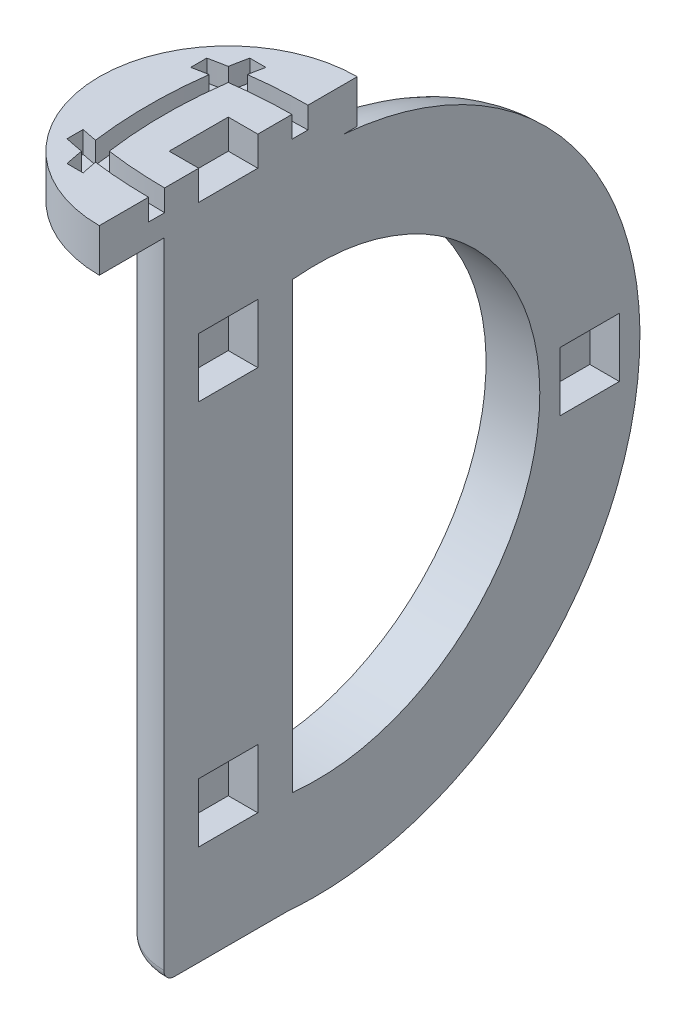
ISO-10303-21;
HEADER;
FILE_DESCRIPTION(('STEP AP214'),'2;1');
FILE_NAME('part.step','',(''),(''),'','','');
FILE_SCHEMA(('AUTOMOTIVE_DESIGN { 1 0 10303 214 1 1 1 1 }'));
ENDSEC;
DATA;
#1=APPLICATION_CONTEXT('core data for automotive mechanical design processes');
#2=APPLICATION_PROTOCOL_DEFINITION('international standard','automotive_design',2000,#1);
#3=PRODUCT_CONTEXT('',#1,'mechanical');
#4=PRODUCT('Part','Part','',(#3));
#5=PRODUCT_RELATED_PRODUCT_CATEGORY('part','',(#4));
#6=PRODUCT_DEFINITION_FORMATION('','',#4);
#7=PRODUCT_DEFINITION_CONTEXT('part definition',#1,'design');
#8=PRODUCT_DEFINITION('design','',#6,#7);
#9=PRODUCT_DEFINITION_SHAPE('','',#8);
#10=(LENGTH_UNIT() NAMED_UNIT(*) SI_UNIT(.MILLI.,.METRE.));
#11=(NAMED_UNIT(*) PLANE_ANGLE_UNIT() SI_UNIT($,.RADIAN.));
#12=(NAMED_UNIT(*) SI_UNIT($,.STERADIAN.) SOLID_ANGLE_UNIT());
#13=UNCERTAINTY_MEASURE_WITH_UNIT(LENGTH_MEASURE(1.E-05),#10,'distance_accuracy_value','');
#14=(GEOMETRIC_REPRESENTATION_CONTEXT(3) GLOBAL_UNCERTAINTY_ASSIGNED_CONTEXT((#13)) GLOBAL_UNIT_ASSIGNED_CONTEXT((#10,
#11,#12)) REPRESENTATION_CONTEXT('',''));
#15=CARTESIAN_POINT('',(0.,0.,0.));
#16=DIRECTION('',(0.,0.,1.));
#17=DIRECTION('',(1.,0.,0.));
#18=AXIS2_PLACEMENT_3D('',#15,#16,#17);
#19=CARTESIAN_POINT('',(0.,0.,0.));
#20=DIRECTION('',(0.,1.,0.));
#21=DIRECTION('',(0.,0.,1.));
#22=AXIS2_PLACEMENT_3D('',#19,#20,#21);
#23=PLANE('',#22);
#24=CARTESIAN_POINT('',(0.,0.,0.));
#25=DIRECTION('',(0.,1.,0.));
#26=DIRECTION('',(0.,0.,1.));
#27=AXIS2_PLACEMENT_3D('',#24,#25,#26);
#28=CIRCLE('',#27,24.);
#29=CARTESIAN_POINT('',(0.,0.,-24.));
#30=VERTEX_POINT('',#29);
#31=CARTESIAN_POINT('',(0.,0.,24.));
#32=VERTEX_POINT('',#31);
#33=EDGE_CURVE('E811',#30,#32,#28,.T.);
#34=ORIENTED_EDGE('',*,*,#33,.F.);
#35=DIRECTION('',(0.,0.,1.));
#36=VECTOR('',#35,1.);
#37=CARTESIAN_POINT('',(0.,0.,0.));
#38=LINE('',#37,#36);
#39=CARTESIAN_POINT('',(0.,0.,-21.3993650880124));
#40=VERTEX_POINT('',#39);
#41=EDGE_CURVE('E877',#30,#40,#38,.T.);
#42=ORIENTED_EDGE('',*,*,#41,.T.);
#43=CARTESIAN_POINT('',(0.,0.,-11.4508895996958));
#44=CARTESIAN_POINT('',(-0.0676941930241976,0.,-11.4508888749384));
#45=CARTESIAN_POINT('',(-0.135386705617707,0.,-11.4572236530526));
#46=CARTESIAN_POINT('',(-0.268564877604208,0.,-11.481855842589));
#47=CARTESIAN_POINT('',(-0.334048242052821,0.,-11.500165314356));
#48=CARTESIAN_POINT('',(-0.474643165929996,0.,-11.5520036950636));
#49=CARTESIAN_POINT('',(-0.548856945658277,0.,-11.5879345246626));
#50=CARTESIAN_POINT('',(-0.690599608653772,0.,-11.671337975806));
#51=CARTESIAN_POINT('',(-0.758106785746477,0.,-11.7188464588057));
#52=CARTESIAN_POINT('',(-0.872174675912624,0.,-11.8108932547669));
#53=CARTESIAN_POINT('',(-0.920083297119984,0.,-11.8538000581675));
#54=CARTESIAN_POINT('',(-1.01189568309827,0.,-11.9435520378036));
#55=CARTESIAN_POINT('',(-1.0558052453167,0.,-11.9903913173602));
#56=CARTESIAN_POINT('',(-1.14010896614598,0.,-12.0873271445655));
#57=CARTESIAN_POINT('',(-1.18049347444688,0.,-12.1374320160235));
#58=CARTESIAN_POINT('',(-1.25794595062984,0.,-12.2401581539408));
#59=CARTESIAN_POINT('',(-1.29501244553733,0.,-12.2927805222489));
#60=CARTESIAN_POINT('',(-1.39755974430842,-1.29790876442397E-13,-12.4474467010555));
#61=CARTESIAN_POINT('',(-1.45918865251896,0.,-12.552051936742));
#62=CARTESIAN_POINT('',(-1.57338713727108,0.,-12.7660883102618));
#63=CARTESIAN_POINT('',(-1.6259501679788,0.,-12.8755228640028));
#64=CARTESIAN_POINT('',(-1.72337270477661,0.,-13.097998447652));
#65=CARTESIAN_POINT('',(-1.7682168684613,0.,-13.2110461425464));
#66=CARTESIAN_POINT('',(-1.85105383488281,0.,-13.4395719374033));
#67=CARTESIAN_POINT('',(-1.8890480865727,0.,-13.5550495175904));
#68=CARTESIAN_POINT('',(-1.95861273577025,0.,-13.7866763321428));
#69=CARTESIAN_POINT('',(-1.99024252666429,0.,-13.9028078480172));
#70=CARTESIAN_POINT('',(-2.0481028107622,0.,-14.1364159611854));
#71=CARTESIAN_POINT('',(-2.0743323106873,0.,-14.2538928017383));
#72=CARTESIAN_POINT('',(-2.14562609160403,0.,-14.6079761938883));
#73=CARTESIAN_POINT('',(-2.18325696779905,0.,-14.8461023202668));
#74=CARTESIAN_POINT('',(-2.24110543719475,0.,-15.3248585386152));
#75=CARTESIAN_POINT('',(-2.26128788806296,0.,-15.5654927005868));
#76=CARTESIAN_POINT('',(-2.28535197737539,0.,-16.0474590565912));
#77=CARTESIAN_POINT('',(-2.2892408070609,0.,-16.2887908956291));
#78=CARTESIAN_POINT('',(-2.28080066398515,0.,-16.7923937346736));
#79=CARTESIAN_POINT('',(-2.26701590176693,0.,-17.0546404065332));
#80=CARTESIAN_POINT('',(-2.22015841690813,0.,-17.5776770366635));
#81=CARTESIAN_POINT('',(-2.18707082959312,0.,-17.8384657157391));
#82=CARTESIAN_POINT('',(-2.12158774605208,0.,-18.2271262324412));
#83=CARTESIAN_POINT('',(-2.09709316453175,0.,-18.356357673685));
#84=CARTESIAN_POINT('',(-2.04241266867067,0.,-18.6136036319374));
#85=CARTESIAN_POINT('',(-2.01222766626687,0.,-18.7416183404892));
#86=CARTESIAN_POINT('',(-1.94568866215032,0.,-18.9958654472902));
#87=CARTESIAN_POINT('',(-1.90934278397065,0.,-19.1220999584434));
#88=CARTESIAN_POINT('',(-1.8297535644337,0.,-19.3723514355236));
#89=CARTESIAN_POINT('',(-1.78651239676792,0.,-19.4963690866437));
#90=CARTESIAN_POINT('',(-1.69354693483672,0.,-19.737778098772));
#91=CARTESIAN_POINT('',(-1.64405229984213,0.,-19.8552569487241));
#92=CARTESIAN_POINT('',(-1.53637894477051,0.,-20.0863417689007));
#93=CARTESIAN_POINT('',(-1.47819182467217,0.,-20.1999438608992));
#94=CARTESIAN_POINT('',(-1.35204522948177,0.,-20.4203708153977));
#95=CARTESIAN_POINT('',(-1.28417997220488,0.,-20.5272481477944));
#96=CARTESIAN_POINT('',(-1.1732323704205,0.,-20.6808016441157));
#97=CARTESIAN_POINT('',(-1.13476129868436,0.,-20.7308195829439));
#98=CARTESIAN_POINT('',(-1.05442529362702,0.,-20.8280359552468));
#99=CARTESIAN_POINT('',(-1.01256241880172,0.,-20.8752360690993));
#100=CARTESIAN_POINT('',(-0.937895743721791,0.,-20.95276128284));
#101=CARTESIAN_POINT('',(-0.90602370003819,0.,-20.9839841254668));
#102=CARTESIAN_POINT('',(-0.84030397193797,0.,-21.0442652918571));
#103=CARTESIAN_POINT('',(-0.806457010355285,0.,-21.0733243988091));
#104=CARTESIAN_POINT('',(-0.736751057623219,0.,-21.1288025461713));
#105=CARTESIAN_POINT('',(-0.700895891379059,0.,-21.155226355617));
#106=CARTESIAN_POINT('',(-0.627044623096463,0.,-21.2049991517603));
#107=CARTESIAN_POINT('',(-0.589045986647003,0.,-21.2283443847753));
#108=CARTESIAN_POINT('',(-0.493066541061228,0.,-21.2811804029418));
#109=CARTESIAN_POINT('',(-0.433904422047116,0.,-21.3085890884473));
#110=CARTESIAN_POINT('',(-0.311964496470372,0.,-21.3534080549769));
#111=CARTESIAN_POINT('',(-0.249193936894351,0.,-21.3708376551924));
#112=CARTESIAN_POINT('',(-0.120964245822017,0.,-21.3941118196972));
#113=CARTESIAN_POINT('',(-0.0554877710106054,0.,-21.3998636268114));
#114=CARTESIAN_POINT('',(0.0753601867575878,0.,-21.3988008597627));
#115=CARTESIAN_POINT('',(0.140731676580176,0.,-21.3919871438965));
#116=CARTESIAN_POINT('',(0.262447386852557,0.,-21.3679556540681));
#117=CARTESIAN_POINT('',(0.31902697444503,0.,-21.3518842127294));
#118=CARTESIAN_POINT('',(0.42926648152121,0.,-21.3116180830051));
#119=CARTESIAN_POINT('',(0.482921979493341,0.,-21.2874114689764));
#120=CARTESIAN_POINT('',(0.575708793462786,0.,-21.2382129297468));
#121=CARTESIAN_POINT('',(0.615515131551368,0.,-21.2144654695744));
#122=CARTESIAN_POINT('',(0.692826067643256,0.,-21.1635686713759));
#123=CARTESIAN_POINT('',(0.730332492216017,0.,-21.1364220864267));
#124=CARTESIAN_POINT('',(0.839713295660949,0.,-21.0505937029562));
#125=CARTESIAN_POINT('',(0.908247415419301,0.,-20.987636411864));
#126=CARTESIAN_POINT('',(1.02915740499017,0.,-20.8623747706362));
#127=CARTESIAN_POINT('',(1.08248314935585,0.,-20.8009569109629));
#128=CARTESIAN_POINT('',(1.18370335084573,0.,-20.6737496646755));
#129=CARTESIAN_POINT('',(1.23159399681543,0.,-20.6079572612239));
#130=CARTESIAN_POINT('',(1.32261461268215,0.,-20.4730558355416));
#131=CARTESIAN_POINT('',(1.3657376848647,2.39002855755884E-13,-20.403942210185));
#132=CARTESIAN_POINT('',(1.44773115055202,-2.39091390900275E-13,-20.2632187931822));
#133=CARTESIAN_POINT('',(1.48659996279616,-8.9256801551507E-13,-20.1916080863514));
#134=CARTESIAN_POINT('',(1.56145627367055,-9.14487297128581E-13,-20.0446513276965));
#135=CARTESIAN_POINT('',(1.59734782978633,-2.50500438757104E-13,-19.9692566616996));
#136=CARTESIAN_POINT('',(1.66554939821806,2.50552331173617E-13,-19.8168578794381));
#137=CARTESIAN_POINT('',(1.69785866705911,0.,-19.7398534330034));
#138=CARTESIAN_POINT('',(1.78996822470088,-1.7500024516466E-13,-19.5068149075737));
#139=CARTESIAN_POINT('',(1.8449050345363,0.,-19.3488470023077));
#140=CARTESIAN_POINT('',(1.94392596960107,0.,-19.0290902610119));
#141=CARTESIAN_POINT('',(1.98797622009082,0.,-18.8672911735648));
#142=CARTESIAN_POINT('',(2.06633448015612,0.,-18.5414196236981));
#143=CARTESIAN_POINT('',(2.10064549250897,0.,-18.3773478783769));
#144=CARTESIAN_POINT('',(2.15682665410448,0.,-18.0675507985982));
#145=CARTESIAN_POINT('',(2.17969922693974,0.,-17.9220047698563));
#146=CARTESIAN_POINT('',(2.21902766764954,0.,-17.630040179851));
#147=CARTESIAN_POINT('',(2.2354827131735,0.,-17.4836215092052));
#148=CARTESIAN_POINT('',(2.27566763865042,0.,-17.0433095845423));
#149=CARTESIAN_POINT('',(2.29018611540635,0.,-16.7485373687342));
#150=CARTESIAN_POINT('',(2.29539987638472,0.,-16.1596804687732));
#151=CARTESIAN_POINT('',(2.28616803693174,0.,-15.865596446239));
#152=CARTESIAN_POINT('',(2.25379149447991,0.,-15.4260106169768));
#153=CARTESIAN_POINT('',(2.23991887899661,0.,-15.2797871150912));
#154=CARTESIAN_POINT('',(2.2056822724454,0.,-14.9881109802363));
#155=CARTESIAN_POINT('',(2.18531945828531,0.,-14.8426582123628));
#156=CARTESIAN_POINT('',(2.14379099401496,0.,-14.5901609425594));
#157=CARTESIAN_POINT('',(2.12417869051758,0.,-14.4828592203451));
#158=CARTESIAN_POINT('',(2.0808806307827,0.,-14.2690828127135));
#159=CARTESIAN_POINT('',(2.05719516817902,0.,-14.1626080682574));
#160=CARTESIAN_POINT('',(2.0054041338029,0.,-13.9505871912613));
#161=CARTESIAN_POINT('',(1.97729286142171,0.,-13.8450424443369));
#162=CARTESIAN_POINT('',(1.91627365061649,0.,-13.6353439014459));
#163=CARTESIAN_POINT('',(1.88336586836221,-2.67926941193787E-13,-13.5311900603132));
#164=CARTESIAN_POINT('',(1.81195278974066,-2.69814189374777E-13,-13.3238477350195));
#165=CARTESIAN_POINT('',(1.77340369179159,0.,-13.2206742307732));
#166=CARTESIAN_POINT('',(1.69023367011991,0.,-13.0167434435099));
#167=CARTESIAN_POINT('',(1.6456107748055,0.,-12.9159869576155));
#168=CARTESIAN_POINT('',(1.54960330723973,0.,-12.7181182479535));
#169=CARTESIAN_POINT('',(1.49824096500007,0.,-12.620995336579));
#170=CARTESIAN_POINT('',(1.3876043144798,0.,-12.431415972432));
#171=CARTESIAN_POINT('',(1.3283375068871,0.,-12.3389552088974));
#172=CARTESIAN_POINT('',(1.20923901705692,0.,-12.1728029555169));
#173=CARTESIAN_POINT('',(1.15058952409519,0.,-12.0982725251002));
#174=CARTESIAN_POINT('',(1.02526052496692,0.,-11.9560238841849));
#175=CARTESIAN_POINT('',(0.958572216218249,0.,-11.8883132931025));
#176=CARTESIAN_POINT('',(0.815363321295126,0.,-11.7620066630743));
#177=CARTESIAN_POINT('',(0.738728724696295,0.,-11.7035371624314));
#178=CARTESIAN_POINT('',(0.576073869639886,0.,-11.6015230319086));
#179=CARTESIAN_POINT('',(0.490084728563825,-1.37397542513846E-13,-11.5579308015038));
#180=CARTESIAN_POINT('',(0.336300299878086,-1.03074652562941E-13,-11.5008327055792));
#181=CARTESIAN_POINT('',(0.270392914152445,0.,-11.4822784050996));
#182=CARTESIAN_POINT('',(0.136321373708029,0.,-11.4573140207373));
#183=CARTESIAN_POINT('',(0.0681598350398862,0.,-11.4508903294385));
#184=CARTESIAN_POINT('',(0.,0.,-11.4508895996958));
#185=B_SPLINE_CURVE_WITH_KNOTS('',3,(#43,#44,#45,#46,#47,#48,#49,#50,#51,#52,#53,#54,#55,#56,
#57,#58,#59,#60,#61,#62,#63,#64,#65,#66,#67,#68,#69,#70,#71,#72,#73,#74,#75,#76,#77,#78,#79,#80,
#81,#82,#83,#84,#85,#86,#87,#88,#89,#90,#91,#92,#93,#94,#95,#96,#97,#98,#99,#100,#101,#102,#103,
#104,#105,#106,#107,#108,#109,#110,#111,#112,#113,#114,#115,#116,#117,#118,#119,#120,#121,#122,
#123,#124,#125,#126,#127,#128,#129,#130,#131,#132,#133,#134,#135,#136,#137,#138,#139,#140,#141,
#142,#143,#144,#145,#146,#147,#148,#149,#150,#151,#152,#153,#154,#155,#156,#157,#158,#159,#160,
#161,#162,#163,#164,#165,#166,#167,#168,#169,#170,#171,#172,#173,#174,#175,#176,#177,#178,#179,
#180,#181,#182,#183,#184),.UNSPECIFIED.,.T.,.F.,(4,2,2,2,2,2,2,2,2,2,2,2,2,2,2,2,2,2,2,2,2,2,2,
2,2,2,2,2,2,2,2,2,2,2,2,2,2,2,2,2,2,2,2,2,2,2,2,2,2,2,2,2,2,2,2,2,2,2,2,2,2,2,2,2,2,2,2,2,2,2,
4),(0.,0.202801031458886,0.405806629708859,0.651803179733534,0.898571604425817,1.09125042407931,
1.28364531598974,1.47655139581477,1.66954269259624,2.03316070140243,2.39704016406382,
2.76163474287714,3.1261521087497,3.4870915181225,3.84809725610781,4.57052371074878,
5.29440181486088,6.01796039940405,6.80512825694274,7.59290309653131,7.9873973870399,
8.38182851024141,8.77574353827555,9.16953463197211,9.551675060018,9.93418718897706,
10.3132018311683,10.5023892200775,10.6914626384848,10.8252332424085,10.958955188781,
11.0924305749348,11.2260672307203,11.4209074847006,11.6153692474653,11.8113696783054,
12.0073567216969,12.1831168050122,12.3591356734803,12.4979975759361,12.6367477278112,
12.9149337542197,13.1586354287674,13.4025069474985,13.6467268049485,13.8910371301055,
14.1414357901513,14.3918863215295,14.8930921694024,15.395838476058,15.8984296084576,
16.3402767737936,16.7821805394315,17.6665253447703,18.5481598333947,18.9886839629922,
19.4291282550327,19.7562973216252,20.0834428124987,20.4110131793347,20.7385728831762,
21.0688260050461,21.3991865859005,21.7284836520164,22.0574704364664,22.3415346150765,
22.6259127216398,22.9138988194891,23.2009546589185,23.4053801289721,23.6095761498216),.UNSPECIFIED.);
#186=CARTESIAN_POINT('',(-1.02287900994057,0.,-11.9563254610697));
#187=VERTEX_POINT('',#186);
#188=EDGE_CURVE('E645',#187,#40,#185,.T.);
#189=ORIENTED_EDGE('',*,*,#188,.F.);
#190=CARTESIAN_POINT('',(0.,0.,0.));
#191=DIRECTION('',(0.,1.,0.));
#192=DIRECTION('',(0.,0.,1.));
#193=AXIS2_PLACEMENT_3D('',#190,#191,#192);
#194=CIRCLE('',#193,12.);
#195=CARTESIAN_POINT('',(0.,0.,12.));
#196=VERTEX_POINT('',#195);
#197=EDGE_CURVE('E817',#196,#187,#194,.F.);
#198=ORIENTED_EDGE('',*,*,#197,.F.);
#199=EDGE_CURVE('E838',#196,#32,#38,.T.);
#200=ORIENTED_EDGE('',*,*,#199,.T.);
#201=EDGE_LOOP('',(#34,#42,#189,#198,#200));
#202=FACE_BOUND('',#201,.T.);
#203=ADVANCED_FACE('F41',(#202),#23,.F.);
#204=CARTESIAN_POINT('',(0.,-120.,0.));
#205=DIRECTION('',(0.,1.,0.));
#206=DIRECTION('',(-1.,0.,0.));
#207=AXIS2_PLACEMENT_3D('',#204,#205,#206);
#208=PLANE('',#207);
#209=DIRECTION('',(0.,0.,-1.));
#210=VECTOR('',#209,1.);
#211=CARTESIAN_POINT('',(0.,-120.,0.));
#212=LINE('',#211,#210);
#213=CARTESIAN_POINT('',(0.,-120.,10.));
#214=VERTEX_POINT('',#213);
#215=CARTESIAN_POINT('',(0.,-120.,-10.0000027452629));
#216=VERTEX_POINT('',#215);
#217=EDGE_CURVE('E453',#214,#216,#212,.T.);
#218=ORIENTED_EDGE('',*,*,#217,.F.);
#219=CARTESIAN_POINT('',(0.,-120.,0.));
#220=DIRECTION('',(0.,1.,0.));
#221=DIRECTION('',(-1.,0.,0.));
#222=AXIS2_PLACEMENT_3D('',#219,#220,#221);
#223=CIRCLE('',#222,10.);
#224=EDGE_CURVE('E54',#214,#216,#223,.F.);
#225=ORIENTED_EDGE('',*,*,#224,.T.);
#226=EDGE_LOOP('',(#218,#225));
#227=FACE_BOUND('',#226,.T.);
#228=ADVANCED_FACE('F535',(#227),#208,.F.);
#229=CARTESIAN_POINT('',(0.,0.,0.));
#230=DIRECTION('',(0.,1.,0.));
#231=DIRECTION('',(-1.,0.,0.));
#232=AXIS2_PLACEMENT_3D('',#229,#230,#231);
#233=CYLINDRICAL_SURFACE('',#232,12.);
#234=CARTESIAN_POINT('',(-3.51088027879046,-119.474916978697,-11.4749169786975));
#235=CARTESIAN_POINT('',(-3.66628710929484,-119.427370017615,-11.4273700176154));
#236=CARTESIAN_POINT('',(-3.81987538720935,-119.376923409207,-11.376923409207));
#237=CARTESIAN_POINT('',(-4.12316492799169,-119.27055129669,-11.27055129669));
#238=CARTESIAN_POINT('',(-4.27286714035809,-119.214627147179,-11.2146271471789));
#239=CARTESIAN_POINT('',(-4.71525136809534,-119.039331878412,-11.0393318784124));
#240=CARTESIAN_POINT('',(-5.0018780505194,-118.912231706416,-10.912231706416));
#241=CARTESIAN_POINT('',(-5.55428771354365,-118.641593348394,-10.641593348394));
#242=CARTESIAN_POINT('',(-5.82026698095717,-118.498253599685,-10.4982535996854));
#243=CARTESIAN_POINT('',(-6.33443336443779,-118.196268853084,-10.1962688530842));
#244=CARTESIAN_POINT('',(-6.58260964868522,-118.037614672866,-10.0376146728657));
#245=CARTESIAN_POINT('',(-7.12000327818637,-117.666282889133,-9.66628288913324));
#246=CARTESIAN_POINT('',(-7.40417445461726,-117.449953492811,-9.44995349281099));
#247=CARTESIAN_POINT('',(-7.94445366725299,-117.000510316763,-9.00051031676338));
#248=CARTESIAN_POINT('',(-8.2005586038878,-116.767394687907,-8.76739468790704));
#249=CARTESIAN_POINT('',(-8.68666784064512,-116.286097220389,-8.28609722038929));
#250=CARTESIAN_POINT('',(-8.91652528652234,-116.037841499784,-8.03784149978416));
#251=CARTESIAN_POINT('',(-9.34940271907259,-115.529941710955,-7.52994171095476));
#252=CARTESIAN_POINT('',(-9.55242074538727,-115.270296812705,-7.27029681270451));
#253=CARTESIAN_POINT('',(-10.0094988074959,-114.63469120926,-6.63469120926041));
#254=CARTESIAN_POINT('',(-10.2509639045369,-114.254183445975,-6.25418344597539));
#255=CARTESIAN_POINT('',(-10.6851715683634,-113.479453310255,-5.47945331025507));
#256=CARTESIAN_POINT('',(-10.8778911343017,-113.085224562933,-5.08522456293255));
#257=CARTESIAN_POINT('',(-11.2163002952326,-112.287432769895,-4.28743276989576));
#258=CARTESIAN_POINT('',(-11.3620530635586,-111.883883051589,-3.8838830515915));
#259=CARTESIAN_POINT('',(-11.6083890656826,-111.070165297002,-3.07016529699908));
#260=CARTESIAN_POINT('',(-11.7089923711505,-110.6600002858,-2.66000028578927));
#261=CARTESIAN_POINT('',(-11.8581631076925,-109.877733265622,-1.87773326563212));
#262=CARTESIAN_POINT('',(-11.9110018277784,-109.506031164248,-1.50603116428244));
#263=CARTESIAN_POINT('',(-11.9816538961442,-108.761346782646,-0.761346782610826));
#264=CARTESIAN_POINT('',(-11.9995087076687,-108.388366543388,-0.388366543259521));
#265=CARTESIAN_POINT('',(-11.9999966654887,-108.010327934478,-0.0103279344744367));
#266=CARTESIAN_POINT('',(-11.9999999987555,-108.005163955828,-0.00516395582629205));
#267=CARTESIAN_POINT('',(-12.0000000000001,-108.,0.));
#268=B_SPLINE_CURVE_WITH_KNOTS('',3,(#234,#235,#236,#237,#238,#239,#240,#241,#242,#243,#244,
#245,#246,#247,#248,#249,#250,#251,#252,#253,#254,#255,#256,#257,#258,#259,#260,#261,#262,#263,
#264,#265,#266,#267),.UNSPECIFIED.,.F.,.F.,(4,2,2,2,2,2,2,2,2,2,2,2,2,2,2,2,4),(0.,
0.507859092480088,1.01559290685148,2.02888638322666,3.03091571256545,4.03354962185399,
5.28435359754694,6.5352955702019,7.79292511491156,9.05064646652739,10.8173779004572,
12.5849414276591,14.3501174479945,16.1145079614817,17.6983529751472,19.2803196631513,
19.3022285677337),.UNSPECIFIED.);
#269=CARTESIAN_POINT('',(-6.63324958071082,-118.,-10.));
#270=VERTEX_POINT('',#269);
#271=CARTESIAN_POINT('',(-12.0000000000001,-108.,0.));
#272=VERTEX_POINT('',#271);
#273=EDGE_CURVE('E519',#270,#272,#268,.T.);
#274=ORIENTED_EDGE('',*,*,#273,.F.);
#275=CARTESIAN_POINT('',(0.,-118.,0.));
#276=DIRECTION('',(0.,1.,0.));
#277=DIRECTION('',(-1.,0.,0.));
#278=AXIS2_PLACEMENT_3D('',#275,#276,#277);
#279=CIRCLE('',#278,12.);
#280=CARTESIAN_POINT('',(0.,-118.,12.));
#281=VERTEX_POINT('',#280);
#282=EDGE_CURVE('E470',#270,#281,#279,.T.);
#283=ORIENTED_EDGE('',*,*,#282,.T.);
#284=DIRECTION('',(0.,1.,0.));
#285=VECTOR('',#284,1.);
#286=CARTESIAN_POINT('',(0.,0.,12.));
#287=LINE('',#286,#285);
#288=EDGE_CURVE('E834',#281,#196,#287,.T.);
#289=ORIENTED_EDGE('',*,*,#288,.T.);
#290=ORIENTED_EDGE('',*,*,#197,.T.);
#291=CARTESIAN_POINT('',(-3.51088027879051,-0.525083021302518,-11.4749169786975));
#292=CARTESIAN_POINT('',(-3.4316144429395,-0.498504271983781,-11.4991697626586));
#293=CARTESIAN_POINT('',(-3.35184003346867,-0.472759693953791,-11.5226789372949));
#294=CARTESIAN_POINT('',(-3.19160595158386,-0.423070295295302,-11.5680836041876));
#295=CARTESIAN_POINT('',(-3.11114964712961,-0.399119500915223,-11.5899844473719));
#296=CARTESIAN_POINT('',(-2.94954611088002,-0.353024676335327,-11.6321594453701));
#297=CARTESIAN_POINT('',(-2.86840131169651,-0.33087597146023,-11.652437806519));
#298=CARTESIAN_POINT('',(-2.7054149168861,-0.288394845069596,-11.6913530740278));
#299=CARTESIAN_POINT('',(-2.62357487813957,-0.268059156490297,-11.7099929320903));
#300=CARTESIAN_POINT('',(-2.45919028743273,-0.229216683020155,-11.7456140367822));
#301=CARTESIAN_POINT('',(-2.37664649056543,-0.210708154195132,-11.7625968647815));
#302=CARTESIAN_POINT('',(-2.21082624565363,-0.175531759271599,-11.7948880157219));
#303=CARTESIAN_POINT('',(-2.12754967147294,-0.158864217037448,-11.8101960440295));
#304=CARTESIAN_POINT('',(-1.96027497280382,-0.127394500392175,-11.8391102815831));
#305=CARTESIAN_POINT('',(-1.87627629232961,-0.112593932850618,-11.8527150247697));
#306=CARTESIAN_POINT('',(-1.70755025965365,-0.0848815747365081,-11.8781970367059));
#307=CARTESIAN_POINT('',(-1.6228218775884,-0.071973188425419,-11.8900711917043));
#308=CARTESIAN_POINT('',(-1.45262805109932,-0.0480723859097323,-11.912063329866));
#309=CARTESIAN_POINT('',(-1.36716122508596,-0.0370853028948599,-11.9221764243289));
#310=CARTESIAN_POINT('',(-1.19548172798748,-0.0170569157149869,-11.9406159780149));
#311=CARTESIAN_POINT('',(-1.10926746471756,-0.00802300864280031,-11.9489356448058));
#312=CARTESIAN_POINT('',(-1.02287900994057,0.,-11.9563254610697));
#313=B_SPLINE_CURVE_WITH_KNOTS('',3,(#291,#292,#293,#294,#295,#296,#297,#298,#299,#300,#301,
#302,#303,#304,#305,#306,#307,#308,#309,#310,#311,#312),.UNSPECIFIED.,.F.,.F.,(4,2,2,2,2,2,2,2,
2,2,4),(0.,0.261143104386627,0.521373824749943,0.780906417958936,1.03996145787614,
1.29876680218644,1.55761760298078,1.81668969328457,2.07622231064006,2.33646428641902,
2.5976752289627),.UNSPECIFIED.);
#314=CARTESIAN_POINT('',(-3.51088027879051,-0.525083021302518,-11.4749169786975));
#315=VERTEX_POINT('',#314);
#316=EDGE_CURVE('E524',#315,#187,#313,.T.);
#317=ORIENTED_EDGE('',*,*,#316,.F.);
#318=CARTESIAN_POINT('',(0.,-12.,0.));
#319=DIRECTION('',(0.,0.707106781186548,0.707106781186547));
#320=DIRECTION('',(0.,0.707106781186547,-0.707106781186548));
#321=AXIS2_PLACEMENT_3D('',#318,#319,#320);
#322=ELLIPSE('',#321,16.9705627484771,12.);
#323=CARTESIAN_POINT('',(-12.,-12.,0.));
#324=VERTEX_POINT('',#323);
#325=EDGE_CURVE('E882',#315,#324,#322,.T.);
#326=ORIENTED_EDGE('',*,*,#325,.T.);
#327=CARTESIAN_POINT('',(0.,-12.,0.));
#328=DIRECTION('',(0.,0.707106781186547,-0.707106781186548));
#329=DIRECTION('',(0.,0.707106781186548,0.707106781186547));
#330=AXIS2_PLACEMENT_3D('',#327,#328,#329);
#331=ELLIPSE('',#330,16.9705627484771,12.);
#332=CARTESIAN_POINT('',(-10.,-18.6332495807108,-6.6332495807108));
#333=VERTEX_POINT('',#332);
#334=EDGE_CURVE('E883',#324,#333,#331,.F.);
#335=ORIENTED_EDGE('',*,*,#334,.T.);
#336=CARTESIAN_POINT('',(0.,-18.6332495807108,0.));
#337=DIRECTION('',(0.,-1.,0.));
#338=DIRECTION('',(0.,0.,-1.));
#339=AXIS2_PLACEMENT_3D('',#336,#337,#338);
#340=CIRCLE('',#339,12.);
#341=CARTESIAN_POINT('',(0.,-18.6332495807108,-12.));
#342=VERTEX_POINT('',#341);
#343=EDGE_CURVE('E884',#333,#342,#340,.T.);
#344=ORIENTED_EDGE('',*,*,#343,.T.);
#345=DIRECTION('',(0.,1.,0.));
#346=VECTOR('',#345,1.);
#347=CARTESIAN_POINT('',(0.,0.,-12.));
#348=LINE('',#347,#346);
#349=CARTESIAN_POINT('',(0.,-101.366750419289,-12.));
#350=VERTEX_POINT('',#349);
#351=EDGE_CURVE('E898',#342,#350,#348,.F.);
#352=ORIENTED_EDGE('',*,*,#351,.T.);
#353=CARTESIAN_POINT('',(0.,-101.366750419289,0.));
#354=DIRECTION('',(0.,-1.,0.));
#355=DIRECTION('',(0.,0.,-1.));
#356=AXIS2_PLACEMENT_3D('',#353,#354,#355);
#357=CIRCLE('',#356,12.);
#358=CARTESIAN_POINT('',(-9.99999999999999,-101.366750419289,-6.6332495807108));
#359=VERTEX_POINT('',#358);
#360=EDGE_CURVE('E820',#359,#350,#357,.T.);
#361=ORIENTED_EDGE('',*,*,#360,.F.);
#362=CARTESIAN_POINT('',(-9.99999999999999,-101.366750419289,-6.6332495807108));
#363=CARTESIAN_POINT('',(-10.1079076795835,-101.529437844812,-6.4705621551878));
#364=CARTESIAN_POINT('',(-10.2111253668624,-101.693651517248,-6.30634848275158));
#365=CARTESIAN_POINT('',(-10.4083660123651,-102.024794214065,-5.97520578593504));
#366=CARTESIAN_POINT('',(-10.502390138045,-102.191722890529,-5.80827710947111));
#367=CARTESIAN_POINT('',(-10.7708864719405,-102.695945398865,-5.30405460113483));
#368=CARTESIAN_POINT('',(-10.9319061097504,-103.036863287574,-4.96313671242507));
#369=CARTESIAN_POINT('',(-11.2188736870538,-103.725011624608,-4.2749883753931));
#370=CARTESIAN_POINT('',(-11.3449072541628,-104.072224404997,-3.9277755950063));
#371=CARTESIAN_POINT('',(-11.5634475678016,-104.771849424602,-3.22815057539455));
#372=CARTESIAN_POINT('',(-11.6559561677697,-105.124261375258,-2.87573862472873));
#373=CARTESIAN_POINT('',(-11.8211989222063,-105.893065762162,-2.10693423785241));
#374=CARTESIAN_POINT('',(-11.8878618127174,-106.31011069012,-1.68988930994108));
#375=CARTESIAN_POINT('',(-11.9769715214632,-107.146322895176,-0.85367710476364));
#376=CARTESIAN_POINT('',(-11.9994491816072,-107.56548848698,-0.43451151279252));
#377=CARTESIAN_POINT('',(-11.9999966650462,-107.989672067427,-0.0103279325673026));
#378=CARTESIAN_POINT('',(-11.9999999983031,-107.994836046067,-0.00516395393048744));
#379=CARTESIAN_POINT('',(-12.0000000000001,-108.,0.));
#380=B_SPLINE_CURVE_WITH_KNOTS('',3,(#362,#363,#364,#365,#366,#367,#368,#369,#370,#371,#372,
#373,#374,#375,#376,#377,#378,#379),.UNSPECIFIED.,.F.,.F.,(4,2,2,2,2,2,2,2,4),(0.,
0.76225011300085,1.52440330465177,3.04783422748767,4.56750303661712,6.08708781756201,
7.86607179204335,9.643813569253,9.66572247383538),.UNSPECIFIED.);
#381=EDGE_CURVE('E512',#272,#359,#380,.F.);
#382=ORIENTED_EDGE('',*,*,#381,.F.);
#383=EDGE_LOOP('',(#274,#283,#289,#290,#317,#326,#335,#344,#352,#361,#382));
#384=FACE_BOUND('',#383,.T.);
#385=ADVANCED_FACE('F529',(#384),#233,.T.);
#386=CARTESIAN_POINT('',(0.,8.,0.));
#387=DIRECTION('',(0.,-1.,0.));
#388=DIRECTION('',(0.,0.,-1.));
#389=AXIS2_PLACEMENT_3D('',#386,#387,#388);
#390=CYLINDRICAL_SURFACE('',#389,24.);
#391=CARTESIAN_POINT('',(0.,8.,0.));
#392=DIRECTION('',(0.,1.,0.));
#393=DIRECTION('',(0.,0.,1.));
#394=AXIS2_PLACEMENT_3D('',#391,#392,#393);
#395=CIRCLE('',#394,24.);
#396=CARTESIAN_POINT('',(0.,8.00000000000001,-24.));
#397=VERTEX_POINT('',#396);
#398=CARTESIAN_POINT('',(0.,8.00000000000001,24.));
#399=VERTEX_POINT('',#398);
#400=EDGE_CURVE('E814',#397,#399,#395,.T.);
#401=ORIENTED_EDGE('',*,*,#400,.F.);
#402=DIRECTION('',(0.,-1.,0.));
#403=VECTOR('',#402,1.);
#404=CARTESIAN_POINT('',(0.,8.,-24.));
#405=LINE('',#404,#403);
#406=EDGE_CURVE('E951',#397,#30,#405,.T.);
#407=ORIENTED_EDGE('',*,*,#406,.T.);
#408=ORIENTED_EDGE('',*,*,#33,.T.);
#409=DIRECTION('',(0.,-1.,0.));
#410=VECTOR('',#409,1.);
#411=CARTESIAN_POINT('',(0.,8.,24.));
#412=LINE('',#411,#410);
#413=EDGE_CURVE('E874',#32,#399,#412,.F.);
#414=ORIENTED_EDGE('',*,*,#413,.T.);
#415=EDGE_LOOP('',(#401,#407,#408,#414));
#416=FACE_BOUND('',#415,.T.);
#417=ADVANCED_FACE('F534',(#416),#390,.T.);
#418=CARTESIAN_POINT('',(0.,8.,0.));
#419=DIRECTION('',(0.,1.,0.));
#420=DIRECTION('',(0.,0.,1.));
#421=AXIS2_PLACEMENT_3D('',#418,#419,#420);
#422=PLANE('',#421);
#423=DIRECTION('',(0.,0.,-1.));
#424=VECTOR('',#423,1.);
#425=CARTESIAN_POINT('',(0.,8.00000000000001,36.1347435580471));
#426=LINE('',#425,#424);
#427=CARTESIAN_POINT('',(0.,8.00000000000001,-14.8271146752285));
#428=VERTEX_POINT('',#427);
#429=EDGE_CURVE('E449',#428,#397,#426,.T.);
#430=ORIENTED_EDGE('',*,*,#429,.T.);
#431=ORIENTED_EDGE('',*,*,#400,.T.);
#432=CARTESIAN_POINT('',(0.,8.00000000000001,14.8271146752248));
#433=VERTEX_POINT('',#432);
#434=EDGE_CURVE('E454',#399,#433,#426,.T.);
#435=ORIENTED_EDGE('',*,*,#434,.T.);
#436=CARTESIAN_POINT('',(4.53365102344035E-13,8.,-65.1728853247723));
#437=DIRECTION('',(0.,1.,0.));
#438=DIRECTION('',(0.,0.,-1.));
#439=AXIS2_PLACEMENT_3D('',#436,#437,#438);
#440=CIRCLE('',#439,79.9999999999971);
#441=CARTESIAN_POINT('',(-10.575887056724,8.,14.1249747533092));
#442=VERTEX_POINT('',#441);
#443=EDGE_CURVE('E750',#442,#433,#440,.T.);
#444=ORIENTED_EDGE('',*,*,#443,.F.);
#445=CARTESIAN_POINT('',(67.4053186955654,8.,-9.76183332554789E-11));
#446=DIRECTION('',(0.,-1.,0.));
#447=DIRECTION('',(0.,0.,-1.));
#448=AXIS2_PLACEMENT_3D('',#445,#446,#447);
#449=CIRCLE('',#448,79.2501316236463);
#450=CARTESIAN_POINT('',(-10.0000000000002,8.,16.9999999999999));
#451=VERTEX_POINT('',#450);
#452=EDGE_CURVE('E747',#451,#442,#449,.T.);
#453=ORIENTED_EDGE('',*,*,#452,.F.);
#454=DIRECTION('',(1.,0.,0.));
#455=VECTOR('',#454,1.);
#456=CARTESIAN_POINT('',(-13.0000000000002,8.,16.9999999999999));
#457=LINE('',#456,#455);
#458=CARTESIAN_POINT('',(-12.9999999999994,8.,16.9999999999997));
#459=VERTEX_POINT('',#458);
#460=EDGE_CURVE('E744',#459,#451,#457,.T.);
#461=ORIENTED_EDGE('',*,*,#460,.F.);
#462=CARTESIAN_POINT('',(65.1728853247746,8.,-3.61937451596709E-12));
#463=DIRECTION('',(0.,1.,0.));
#464=DIRECTION('',(0.,0.,-1.));
#465=AXIS2_PLACEMENT_3D('',#462,#463,#464);
#466=CIRCLE('',#465,80.0000000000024);
#467=CARTESIAN_POINT('',(-13.6534076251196,8.,13.6534076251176));
#468=VERTEX_POINT('',#467);
#469=EDGE_CURVE('E741',#468,#459,#466,.T.);
#470=ORIENTED_EDGE('',*,*,#469,.F.);
#471=CARTESIAN_POINT('',(4.53365102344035E-13,8.,-65.1728853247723));
#472=DIRECTION('',(0.,1.,0.));
#473=DIRECTION('',(0.,0.,-1.));
#474=AXIS2_PLACEMENT_3D('',#471,#472,#473);
#475=CIRCLE('',#474,79.9999999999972);
#476=CARTESIAN_POINT('',(-16.9999999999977,8.,12.9999999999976));
#477=VERTEX_POINT('',#476);
#478=EDGE_CURVE('E738',#477,#468,#475,.T.);
#479=ORIENTED_EDGE('',*,*,#478,.F.);
#480=DIRECTION('',(0.,0.,1.));
#481=VECTOR('',#480,1.);
#482=CARTESIAN_POINT('',(-16.9999999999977,8.,10.0000000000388));
#483=LINE('',#482,#481);
#484=CARTESIAN_POINT('',(-16.9999999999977,8.,10.0000000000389));
#485=VERTEX_POINT('',#484);
#486=EDGE_CURVE('E735',#485,#477,#483,.T.);
#487=ORIENTED_EDGE('',*,*,#486,.F.);
#488=CARTESIAN_POINT('',(-9.45576231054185E-11,8.,-67.4053186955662));
#489=DIRECTION('',(0.,-1.,0.));
#490=DIRECTION('',(0.,0.,-1.));
#491=AXIS2_PLACEMENT_3D('',#488,#489,#490);
#492=CIRCLE('',#491,79.2501316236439);
#493=CARTESIAN_POINT('',(-14.1249747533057,8.,10.575887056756));
#494=VERTEX_POINT('',#493);
#495=EDGE_CURVE('E732',#494,#485,#492,.T.);
#496=ORIENTED_EDGE('',*,*,#495,.F.);
#497=CARTESIAN_POINT('',(65.1728853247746,8.,-3.61937451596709E-12));
#498=DIRECTION('',(0.,1.,0.));
#499=DIRECTION('',(0.,0.,-1.));
#500=AXIS2_PLACEMENT_3D('',#497,#498,#499);
#501=CIRCLE('',#500,80.0000000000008);
#502=CARTESIAN_POINT('',(-14.12497475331,8.,-10.5758870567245));
#503=VERTEX_POINT('',#502);
#504=EDGE_CURVE('E729',#503,#494,#501,.T.);
#505=ORIENTED_EDGE('',*,*,#504,.F.);
#506=CARTESIAN_POINT('',(9.68253255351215E-11,8.,67.4053186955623));
#507=DIRECTION('',(0.,-1.,0.));
#508=DIRECTION('',(0.,0.,-1.));
#509=AXIS2_PLACEMENT_3D('',#506,#507,#508);
#510=CIRCLE('',#509,79.2501316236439);
#511=CARTESIAN_POINT('',(-17.,8.,-10.));
#512=VERTEX_POINT('',#511);
#513=EDGE_CURVE('E726',#512,#503,#510,.T.);
#514=ORIENTED_EDGE('',*,*,#513,.F.);
#515=DIRECTION('',(0.,0.,1.));
#516=VECTOR('',#515,1.);
#517=CARTESIAN_POINT('',(-17.,8.,-13.));
#518=LINE('',#517,#516);
#519=CARTESIAN_POINT('',(-17.,8.,-13.));
#520=VERTEX_POINT('',#519);
#521=EDGE_CURVE('E723',#520,#512,#518,.T.);
#522=ORIENTED_EDGE('',*,*,#521,.F.);
#523=CARTESIAN_POINT('',(0.,8.,65.1728853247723));
#524=DIRECTION('',(0.,1.,0.));
#525=DIRECTION('',(0.,0.,-1.));
#526=AXIS2_PLACEMENT_3D('',#523,#524,#525);
#527=CIRCLE('',#526,80.);
#528=CARTESIAN_POINT('',(-13.6534076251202,8.,-13.6534076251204));
#529=VERTEX_POINT('',#528);
#530=EDGE_CURVE('E674',#529,#520,#527,.T.);
#531=ORIENTED_EDGE('',*,*,#530,.F.);
#532=CARTESIAN_POINT('',(65.1728853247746,8.,-3.61937451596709E-12));
#533=DIRECTION('',(0.,1.,0.));
#534=DIRECTION('',(0.,0.,-1.));
#535=AXIS2_PLACEMENT_3D('',#532,#533,#534);
#536=CIRCLE('',#535,80.0000000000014);
#537=CARTESIAN_POINT('',(-12.9999999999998,8.,-17.0000000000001));
#538=VERTEX_POINT('',#537);
#539=EDGE_CURVE('E680',#538,#529,#536,.T.);
#540=ORIENTED_EDGE('',*,*,#539,.F.);
#541=DIRECTION('',(-1.,0.,2.15105711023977E-13));
#542=VECTOR('',#541,1.);
#543=CARTESIAN_POINT('',(-10.0000000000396,8.,-17.0000000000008));
#544=LINE('',#543,#542);
#545=CARTESIAN_POINT('',(-10.0000000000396,8.,-17.0000000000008));
#546=VERTEX_POINT('',#545);
#547=EDGE_CURVE('E758',#546,#538,#544,.T.);
#548=ORIENTED_EDGE('',*,*,#547,.F.);
#549=CARTESIAN_POINT('',(67.4053186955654,8.,-9.76183332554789E-11));
#550=DIRECTION('',(0.,-1.,0.));
#551=DIRECTION('',(0.,0.,-1.));
#552=AXIS2_PLACEMENT_3D('',#549,#550,#551);
#553=CIRCLE('',#552,79.2501316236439);
#554=CARTESIAN_POINT('',(-10.5758870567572,8.,-14.1249747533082));
#555=VERTEX_POINT('',#554);
#556=EDGE_CURVE('E755',#555,#546,#553,.T.);
#557=ORIENTED_EDGE('',*,*,#556,.F.);
#558=CARTESIAN_POINT('',(0.,8.,65.1728853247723));
#559=DIRECTION('',(0.,1.,0.));
#560=DIRECTION('',(0.,0.,-1.));
#561=AXIS2_PLACEMENT_3D('',#558,#559,#560);
#562=CIRCLE('',#561,80.0000000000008);
#563=EDGE_CURVE('E753',#428,#555,#562,.T.);
#564=ORIENTED_EDGE('',*,*,#563,.F.);
#565=EDGE_LOOP('',(#430,#431,#435,#444,#453,#461,#470,#479,#487,#496,#505,#514,#522,#531,#540,
#548,#557,#564));
#566=FACE_BOUND('',#565,.T.);
#567=ADVANCED_FACE('F620',(#566),#422,.T.);
#568=CARTESIAN_POINT('',(0.,4.,65.1728853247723));
#569=DIRECTION('',(0.,1.,0.));
#570=DIRECTION('',(0.,0.,1.));
#571=AXIS2_PLACEMENT_3D('',#568,#569,#570);
#572=CYLINDRICAL_SURFACE('',#571,80.);
#573=ORIENTED_EDGE('',*,*,#530,.T.);
#574=DIRECTION('',(0.,1.,0.));
#575=VECTOR('',#574,1.);
#576=CARTESIAN_POINT('',(-17.,4.,-13.));
#577=LINE('',#576,#575);
#578=CARTESIAN_POINT('',(-17.,4.,-13.));
#579=VERTEX_POINT('',#578);
#580=EDGE_CURVE('E721',#579,#520,#577,.T.);
#581=ORIENTED_EDGE('',*,*,#580,.F.);
#582=CARTESIAN_POINT('',(0.,4.,65.1728853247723));
#583=DIRECTION('',(0.,1.,0.));
#584=DIRECTION('',(0.,0.,-1.));
#585=AXIS2_PLACEMENT_3D('',#582,#583,#584);
#586=CIRCLE('',#585,80.);
#587=CARTESIAN_POINT('',(-13.6534076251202,4.,-13.6534076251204));
#588=VERTEX_POINT('',#587);
#589=EDGE_CURVE('E676',#588,#579,#586,.T.);
#590=ORIENTED_EDGE('',*,*,#589,.F.);
#591=DIRECTION('',(0.,1.,0.));
#592=VECTOR('',#591,1.);
#593=CARTESIAN_POINT('',(-13.6534076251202,4.,-13.6534076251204));
#594=LINE('',#593,#592);
#595=EDGE_CURVE('E763',#588,#529,#594,.T.);
#596=ORIENTED_EDGE('',*,*,#595,.T.);
#597=EDGE_LOOP('',(#573,#581,#590,#596));
#598=FACE_BOUND('',#597,.T.);
#599=ADVANCED_FACE('F566',(#598),#572,.F.);
#600=CARTESIAN_POINT('',(65.1728853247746,4.,-3.61937451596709E-12));
#601=DIRECTION('',(0.,1.,0.));
#602=DIRECTION('',(0.,0.,1.));
#603=AXIS2_PLACEMENT_3D('',#600,#601,#602);
#604=CYLINDRICAL_SURFACE('',#603,80.0000000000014);
#605=ORIENTED_EDGE('',*,*,#539,.T.);
#606=ORIENTED_EDGE('',*,*,#595,.F.);
#607=CARTESIAN_POINT('',(65.1728853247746,4.,-3.61937451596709E-12));
#608=DIRECTION('',(0.,1.,0.));
#609=DIRECTION('',(0.,0.,-1.));
#610=AXIS2_PLACEMENT_3D('',#607,#608,#609);
#611=CIRCLE('',#610,80.0000000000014);
#612=CARTESIAN_POINT('',(-12.9999999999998,4.,-17.0000000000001));
#613=VERTEX_POINT('',#612);
#614=EDGE_CURVE('E718',#613,#588,#611,.T.);
#615=ORIENTED_EDGE('',*,*,#614,.F.);
#616=DIRECTION('',(0.,1.,0.));
#617=VECTOR('',#616,1.);
#618=CARTESIAN_POINT('',(-12.9999999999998,4.,-17.0000000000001));
#619=LINE('',#618,#617);
#620=EDGE_CURVE('E766',#613,#538,#619,.T.);
#621=ORIENTED_EDGE('',*,*,#620,.T.);
#622=EDGE_LOOP('',(#605,#606,#615,#621));
#623=FACE_BOUND('',#622,.T.);
#624=ADVANCED_FACE('F562',(#623),#604,.F.);
#625=CARTESIAN_POINT('',(-10.0000000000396,4.,-17.0000000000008));
#626=DIRECTION('',(-2.15105711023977E-13,0.,-1.));
#627=DIRECTION('',(-1.,0.,2.15105711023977E-13));
#628=AXIS2_PLACEMENT_3D('',#625,#626,#627);
#629=PLANE('',#628);
#630=ORIENTED_EDGE('',*,*,#547,.T.);
#631=ORIENTED_EDGE('',*,*,#620,.F.);
#632=DIRECTION('',(-1.,0.,2.15105711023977E-13));
#633=VECTOR('',#632,1.);
#634=CARTESIAN_POINT('',(-10.0000000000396,4.,-17.0000000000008));
#635=LINE('',#634,#633);
#636=CARTESIAN_POINT('',(-10.0000000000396,4.,-17.0000000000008));
#637=VERTEX_POINT('',#636);
#638=EDGE_CURVE('E715',#637,#613,#635,.T.);
#639=ORIENTED_EDGE('',*,*,#638,.F.);
#640=DIRECTION('',(0.,1.,0.));
#641=VECTOR('',#640,1.);
#642=CARTESIAN_POINT('',(-10.0000000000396,4.,-17.0000000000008));
#643=LINE('',#642,#641);
#644=EDGE_CURVE('E768',#637,#546,#643,.T.);
#645=ORIENTED_EDGE('',*,*,#644,.T.);
#646=EDGE_LOOP('',(#630,#631,#639,#645));
#647=FACE_BOUND('',#646,.T.);
#648=ADVANCED_FACE('F565',(#647),#629,.F.);
#649=CARTESIAN_POINT('',(67.4053186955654,4.,-9.76183332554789E-11));
#650=DIRECTION('',(0.,1.,0.));
#651=DIRECTION('',(0.,0.,1.));
#652=AXIS2_PLACEMENT_3D('',#649,#650,#651);
#653=CYLINDRICAL_SURFACE('',#652,79.2501316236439);
#654=ORIENTED_EDGE('',*,*,#556,.T.);
#655=ORIENTED_EDGE('',*,*,#644,.F.);
#656=CARTESIAN_POINT('',(67.4053186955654,4.,-9.76183332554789E-11));
#657=DIRECTION('',(0.,-1.,0.));
#658=DIRECTION('',(0.,0.,-1.));
#659=AXIS2_PLACEMENT_3D('',#656,#657,#658);
#660=CIRCLE('',#659,79.2501316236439);
#661=CARTESIAN_POINT('',(-10.5758870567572,4.,-14.1249747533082));
#662=VERTEX_POINT('',#661);
#663=EDGE_CURVE('E712',#662,#637,#660,.T.);
#664=ORIENTED_EDGE('',*,*,#663,.F.);
#665=DIRECTION('',(0.,1.,0.));
#666=VECTOR('',#665,1.);
#667=CARTESIAN_POINT('',(-10.5758870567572,4.,-14.1249747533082));
#668=LINE('',#667,#666);
#669=EDGE_CURVE('E770',#662,#555,#668,.T.);
#670=ORIENTED_EDGE('',*,*,#669,.T.);
#671=EDGE_LOOP('',(#654,#655,#664,#670));
#672=FACE_BOUND('',#671,.T.);
#673=ADVANCED_FACE('F570',(#672),#653,.T.);
#674=CARTESIAN_POINT('',(0.,4.,65.1728853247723));
#675=DIRECTION('',(0.,1.,0.));
#676=DIRECTION('',(0.,0.,1.));
#677=AXIS2_PLACEMENT_3D('',#674,#675,#676);
#678=CYLINDRICAL_SURFACE('',#677,80.0000000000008);
#679=CARTESIAN_POINT('',(0.,4.,65.1728853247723));
#680=DIRECTION('',(0.,1.,0.));
#681=DIRECTION('',(0.,0.,-1.));
#682=AXIS2_PLACEMENT_3D('',#679,#680,#681);
#683=CIRCLE('',#682,80.0000000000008);
#684=CARTESIAN_POINT('',(0.,4.,-14.8271146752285));
#685=VERTEX_POINT('',#684);
#686=EDGE_CURVE('E710',#685,#662,#683,.T.);
#687=ORIENTED_EDGE('',*,*,#686,.F.);
#688=DIRECTION('',(0.,1.,0.));
#689=VECTOR('',#688,1.);
#690=CARTESIAN_POINT('',(0.,4.,-14.8271146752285));
#691=LINE('',#690,#689);
#692=EDGE_CURVE('E941',#685,#428,#691,.T.);
#693=ORIENTED_EDGE('',*,*,#692,.T.);
#694=ORIENTED_EDGE('',*,*,#563,.T.);
#695=ORIENTED_EDGE('',*,*,#669,.F.);
#696=EDGE_LOOP('',(#687,#693,#694,#695));
#697=FACE_BOUND('',#696,.T.);
#698=ADVANCED_FACE('F574',(#697),#678,.F.);
#699=CARTESIAN_POINT('',(4.53365102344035E-13,4.,-65.1728853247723));
#700=DIRECTION('',(0.,1.,0.));
#701=DIRECTION('',(0.,0.,1.));
#702=AXIS2_PLACEMENT_3D('',#699,#700,#701);
#703=CYLINDRICAL_SURFACE('',#702,79.9999999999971);
#704=ORIENTED_EDGE('',*,*,#443,.T.);
#705=DIRECTION('',(0.,1.,0.));
#706=VECTOR('',#705,1.);
#707=CARTESIAN_POINT('',(0.,4.,14.8271146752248));
#708=LINE('',#707,#706);
#709=CARTESIAN_POINT('',(0.,4.,14.8271146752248));
#710=VERTEX_POINT('',#709);
#711=EDGE_CURVE('E930',#433,#710,#708,.F.);
#712=ORIENTED_EDGE('',*,*,#711,.T.);
#713=CARTESIAN_POINT('',(4.53365102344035E-13,4.,-65.1728853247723));
#714=DIRECTION('',(0.,1.,0.));
#715=DIRECTION('',(0.,0.,-1.));
#716=AXIS2_PLACEMENT_3D('',#713,#714,#715);
#717=CIRCLE('',#716,79.9999999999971);
#718=CARTESIAN_POINT('',(-10.575887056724,4.,14.1249747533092));
#719=VERTEX_POINT('',#718);
#720=EDGE_CURVE('E707',#719,#710,#717,.T.);
#721=ORIENTED_EDGE('',*,*,#720,.F.);
#722=DIRECTION('',(0.,1.,0.));
#723=VECTOR('',#722,1.);
#724=CARTESIAN_POINT('',(-10.575887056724,4.,14.1249747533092));
#725=LINE('',#724,#723);
#726=EDGE_CURVE('E773',#719,#442,#725,.T.);
#727=ORIENTED_EDGE('',*,*,#726,.T.);
#728=EDGE_LOOP('',(#704,#712,#721,#727));
#729=FACE_BOUND('',#728,.T.);
#730=ADVANCED_FACE('F578',(#729),#703,.F.);
#731=CARTESIAN_POINT('',(67.4053186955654,4.,-9.76183332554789E-11));
#732=DIRECTION('',(0.,1.,0.));
#733=DIRECTION('',(0.,0.,1.));
#734=AXIS2_PLACEMENT_3D('',#731,#732,#733);
#735=CYLINDRICAL_SURFACE('',#734,79.2501316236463);
#736=ORIENTED_EDGE('',*,*,#452,.T.);
#737=ORIENTED_EDGE('',*,*,#726,.F.);
#738=CARTESIAN_POINT('',(67.4053186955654,4.,-9.76183332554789E-11));
#739=DIRECTION('',(0.,-1.,0.));
#740=DIRECTION('',(0.,0.,-1.));
#741=AXIS2_PLACEMENT_3D('',#738,#739,#740);
#742=CIRCLE('',#741,79.2501316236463);
#743=CARTESIAN_POINT('',(-10.0000000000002,4.,16.9999999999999));
#744=VERTEX_POINT('',#743);
#745=EDGE_CURVE('E704',#744,#719,#742,.T.);
#746=ORIENTED_EDGE('',*,*,#745,.F.);
#747=DIRECTION('',(0.,1.,0.));
#748=VECTOR('',#747,1.);
#749=CARTESIAN_POINT('',(-10.0000000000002,4.,16.9999999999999));
#750=LINE('',#749,#748);
#751=EDGE_CURVE('E775',#744,#451,#750,.T.);
#752=ORIENTED_EDGE('',*,*,#751,.T.);
#753=EDGE_LOOP('',(#736,#737,#746,#752));
#754=FACE_BOUND('',#753,.T.);
#755=ADVANCED_FACE('F582',(#754),#735,.T.);
#756=CARTESIAN_POINT('',(-13.0000000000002,4.,16.9999999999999));
#757=DIRECTION('',(0.,0.,1.));
#758=DIRECTION('',(1.,0.,0.));
#759=AXIS2_PLACEMENT_3D('',#756,#757,#758);
#760=PLANE('',#759);
#761=ORIENTED_EDGE('',*,*,#460,.T.);
#762=ORIENTED_EDGE('',*,*,#751,.F.);
#763=DIRECTION('',(1.,0.,0.));
#764=VECTOR('',#763,1.);
#765=CARTESIAN_POINT('',(-13.0000000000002,4.,16.9999999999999));
#766=LINE('',#765,#764);
#767=CARTESIAN_POINT('',(-12.9999999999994,4.,16.9999999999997));
#768=VERTEX_POINT('',#767);
#769=EDGE_CURVE('E701',#768,#744,#766,.T.);
#770=ORIENTED_EDGE('',*,*,#769,.F.);
#771=DIRECTION('',(0.,1.,0.));
#772=VECTOR('',#771,1.);
#773=CARTESIAN_POINT('',(-12.9999999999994,4.,16.9999999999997));
#774=LINE('',#773,#772);
#775=EDGE_CURVE('E777',#768,#459,#774,.T.);
#776=ORIENTED_EDGE('',*,*,#775,.T.);
#777=EDGE_LOOP('',(#761,#762,#770,#776));
#778=FACE_BOUND('',#777,.T.);
#779=ADVANCED_FACE('F586',(#778),#760,.F.);
#780=CARTESIAN_POINT('',(65.1728853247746,4.,-3.61937451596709E-12));
#781=DIRECTION('',(0.,1.,0.));
#782=DIRECTION('',(0.,0.,1.));
#783=AXIS2_PLACEMENT_3D('',#780,#781,#782);
#784=CYLINDRICAL_SURFACE('',#783,80.0000000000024);
#785=ORIENTED_EDGE('',*,*,#469,.T.);
#786=ORIENTED_EDGE('',*,*,#775,.F.);
#787=CARTESIAN_POINT('',(65.1728853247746,4.,-3.61937451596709E-12));
#788=DIRECTION('',(0.,1.,0.));
#789=DIRECTION('',(0.,0.,-1.));
#790=AXIS2_PLACEMENT_3D('',#787,#788,#789);
#791=CIRCLE('',#790,80.0000000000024);
#792=CARTESIAN_POINT('',(-13.6534076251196,4.,13.6534076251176));
#793=VERTEX_POINT('',#792);
#794=EDGE_CURVE('E698',#793,#768,#791,.T.);
#795=ORIENTED_EDGE('',*,*,#794,.F.);
#796=DIRECTION('',(0.,1.,0.));
#797=VECTOR('',#796,1.);
#798=CARTESIAN_POINT('',(-13.6534076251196,4.,13.6534076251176));
#799=LINE('',#798,#797);
#800=EDGE_CURVE('E779',#793,#468,#799,.T.);
#801=ORIENTED_EDGE('',*,*,#800,.T.);
#802=EDGE_LOOP('',(#785,#786,#795,#801));
#803=FACE_BOUND('',#802,.T.);
#804=ADVANCED_FACE('F590',(#803),#784,.F.);
#805=CARTESIAN_POINT('',(4.53365102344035E-13,4.,-65.1728853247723));
#806=DIRECTION('',(0.,1.,0.));
#807=DIRECTION('',(0.,0.,1.));
#808=AXIS2_PLACEMENT_3D('',#805,#806,#807);
#809=CYLINDRICAL_SURFACE('',#808,79.9999999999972);
#810=ORIENTED_EDGE('',*,*,#478,.T.);
#811=ORIENTED_EDGE('',*,*,#800,.F.);
#812=CARTESIAN_POINT('',(4.53365102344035E-13,4.,-65.1728853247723));
#813=DIRECTION('',(0.,1.,0.));
#814=DIRECTION('',(0.,0.,-1.));
#815=AXIS2_PLACEMENT_3D('',#812,#813,#814);
#816=CIRCLE('',#815,79.9999999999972);
#817=CARTESIAN_POINT('',(-16.9999999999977,4.,12.9999999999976));
#818=VERTEX_POINT('',#817);
#819=EDGE_CURVE('E695',#818,#793,#816,.T.);
#820=ORIENTED_EDGE('',*,*,#819,.F.);
#821=DIRECTION('',(0.,1.,0.));
#822=VECTOR('',#821,1.);
#823=CARTESIAN_POINT('',(-16.9999999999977,4.,12.9999999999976));
#824=LINE('',#823,#822);
#825=EDGE_CURVE('E781',#818,#477,#824,.T.);
#826=ORIENTED_EDGE('',*,*,#825,.T.);
#827=EDGE_LOOP('',(#810,#811,#820,#826));
#828=FACE_BOUND('',#827,.T.);
#829=ADVANCED_FACE('F594',(#828),#809,.F.);
#830=CARTESIAN_POINT('',(-16.9999999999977,4.,10.0000000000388));
#831=DIRECTION('',(-1.,0.,0.));
#832=DIRECTION('',(0.,0.,1.));
#833=AXIS2_PLACEMENT_3D('',#830,#831,#832);
#834=PLANE('',#833);
#835=ORIENTED_EDGE('',*,*,#486,.T.);
#836=ORIENTED_EDGE('',*,*,#825,.F.);
#837=DIRECTION('',(0.,0.,1.));
#838=VECTOR('',#837,1.);
#839=CARTESIAN_POINT('',(-16.9999999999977,4.,10.0000000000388));
#840=LINE('',#839,#838);
#841=CARTESIAN_POINT('',(-16.9999999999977,4.,10.0000000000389));
#842=VERTEX_POINT('',#841);
#843=EDGE_CURVE('E692',#842,#818,#840,.T.);
#844=ORIENTED_EDGE('',*,*,#843,.F.);
#845=DIRECTION('',(0.,1.,0.));
#846=VECTOR('',#845,1.);
#847=CARTESIAN_POINT('',(-16.9999999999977,4.,10.0000000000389));
#848=LINE('',#847,#846);
#849=EDGE_CURVE('E783',#842,#485,#848,.T.);
#850=ORIENTED_EDGE('',*,*,#849,.T.);
#851=EDGE_LOOP('',(#835,#836,#844,#850));
#852=FACE_BOUND('',#851,.T.);
#853=ADVANCED_FACE('F598',(#852),#834,.F.);
#854=CARTESIAN_POINT('',(-9.45576231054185E-11,4.,-67.4053186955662));
#855=DIRECTION('',(0.,1.,0.));
#856=DIRECTION('',(0.,0.,1.));
#857=AXIS2_PLACEMENT_3D('',#854,#855,#856);
#858=CYLINDRICAL_SURFACE('',#857,79.2501316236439);
#859=ORIENTED_EDGE('',*,*,#495,.T.);
#860=ORIENTED_EDGE('',*,*,#849,.F.);
#861=CARTESIAN_POINT('',(-9.45576231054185E-11,4.,-67.4053186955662));
#862=DIRECTION('',(0.,-1.,0.));
#863=DIRECTION('',(0.,0.,-1.));
#864=AXIS2_PLACEMENT_3D('',#861,#862,#863);
#865=CIRCLE('',#864,79.2501316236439);
#866=CARTESIAN_POINT('',(-14.1249747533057,4.,10.575887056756));
#867=VERTEX_POINT('',#866);
#868=EDGE_CURVE('E689',#867,#842,#865,.T.);
#869=ORIENTED_EDGE('',*,*,#868,.F.);
#870=DIRECTION('',(0.,1.,0.));
#871=VECTOR('',#870,1.);
#872=CARTESIAN_POINT('',(-14.1249747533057,4.,10.575887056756));
#873=LINE('',#872,#871);
#874=EDGE_CURVE('E785',#867,#494,#873,.T.);
#875=ORIENTED_EDGE('',*,*,#874,.T.);
#876=EDGE_LOOP('',(#859,#860,#869,#875));
#877=FACE_BOUND('',#876,.T.);
#878=ADVANCED_FACE('F602',(#877),#858,.T.);
#879=CARTESIAN_POINT('',(65.1728853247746,4.,-3.61937451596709E-12));
#880=DIRECTION('',(0.,1.,0.));
#881=DIRECTION('',(0.,0.,1.));
#882=AXIS2_PLACEMENT_3D('',#879,#880,#881);
#883=CYLINDRICAL_SURFACE('',#882,80.0000000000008);
#884=ORIENTED_EDGE('',*,*,#504,.T.);
#885=ORIENTED_EDGE('',*,*,#874,.F.);
#886=CARTESIAN_POINT('',(65.1728853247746,4.,-3.61937451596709E-12));
#887=DIRECTION('',(0.,1.,0.));
#888=DIRECTION('',(0.,0.,-1.));
#889=AXIS2_PLACEMENT_3D('',#886,#887,#888);
#890=CIRCLE('',#889,80.0000000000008);
#891=CARTESIAN_POINT('',(-14.12497475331,4.,-10.5758870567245));
#892=VERTEX_POINT('',#891);
#893=EDGE_CURVE('E686',#892,#867,#890,.T.);
#894=ORIENTED_EDGE('',*,*,#893,.F.);
#895=DIRECTION('',(0.,1.,0.));
#896=VECTOR('',#895,1.);
#897=CARTESIAN_POINT('',(-14.12497475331,4.,-10.5758870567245));
#898=LINE('',#897,#896);
#899=EDGE_CURVE('E787',#892,#503,#898,.T.);
#900=ORIENTED_EDGE('',*,*,#899,.T.);
#901=EDGE_LOOP('',(#884,#885,#894,#900));
#902=FACE_BOUND('',#901,.T.);
#903=ADVANCED_FACE('F606',(#902),#883,.F.);
#904=CARTESIAN_POINT('',(9.68253255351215E-11,4.,67.4053186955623));
#905=DIRECTION('',(0.,1.,0.));
#906=DIRECTION('',(0.,0.,1.));
#907=AXIS2_PLACEMENT_3D('',#904,#905,#906);
#908=CYLINDRICAL_SURFACE('',#907,79.2501316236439);
#909=ORIENTED_EDGE('',*,*,#513,.T.);
#910=ORIENTED_EDGE('',*,*,#899,.F.);
#911=CARTESIAN_POINT('',(9.68253255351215E-11,4.,67.4053186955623));
#912=DIRECTION('',(0.,-1.,0.));
#913=DIRECTION('',(0.,0.,-1.));
#914=AXIS2_PLACEMENT_3D('',#911,#912,#913);
#915=CIRCLE('',#914,79.2501316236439);
#916=CARTESIAN_POINT('',(-17.,4.,-10.));
#917=VERTEX_POINT('',#916);
#918=EDGE_CURVE('E683',#917,#892,#915,.T.);
#919=ORIENTED_EDGE('',*,*,#918,.F.);
#920=DIRECTION('',(0.,1.,0.));
#921=VECTOR('',#920,1.);
#922=CARTESIAN_POINT('',(-17.,4.,-10.));
#923=LINE('',#922,#921);
#924=EDGE_CURVE('E789',#917,#512,#923,.T.);
#925=ORIENTED_EDGE('',*,*,#924,.T.);
#926=EDGE_LOOP('',(#909,#910,#919,#925));
#927=FACE_BOUND('',#926,.T.);
#928=ADVANCED_FACE('F610',(#927),#908,.T.);
#929=CARTESIAN_POINT('',(-17.,4.,-13.));
#930=DIRECTION('',(-1.,0.,0.));
#931=DIRECTION('',(0.,0.,1.));
#932=AXIS2_PLACEMENT_3D('',#929,#930,#931);
#933=PLANE('',#932);
#934=ORIENTED_EDGE('',*,*,#521,.T.);
#935=ORIENTED_EDGE('',*,*,#924,.F.);
#936=DIRECTION('',(0.,0.,1.));
#937=VECTOR('',#936,1.);
#938=CARTESIAN_POINT('',(-17.,4.,-13.));
#939=LINE('',#938,#937);
#940=EDGE_CURVE('E679',#579,#917,#939,.T.);
#941=ORIENTED_EDGE('',*,*,#940,.F.);
#942=ORIENTED_EDGE('',*,*,#580,.T.);
#943=EDGE_LOOP('',(#934,#935,#941,#942));
#944=FACE_BOUND('',#943,.T.);
#945=ADVANCED_FACE('F560',(#944),#933,.F.);
#946=CARTESIAN_POINT('',(0.,4.,65.1728853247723));
#947=DIRECTION('',(0.,-1.,0.));
#948=DIRECTION('',(0.,0.,-1.));
#949=AXIS2_PLACEMENT_3D('',#946,#947,#948);
#950=PLANE('',#949);
#951=ORIENTED_EDGE('',*,*,#720,.T.);
#952=DIRECTION('',(0.,0.,-1.));
#953=VECTOR('',#952,1.);
#954=CARTESIAN_POINT('',(0.,4.,65.1728853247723));
#955=LINE('',#954,#953);
#956=CARTESIAN_POINT('',(0.,4.,11.8448129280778));
#957=VERTEX_POINT('',#956);
#958=EDGE_CURVE('E927',#710,#957,#955,.T.);
#959=ORIENTED_EDGE('',*,*,#958,.T.);
#960=CARTESIAN_POINT('',(-9.45576231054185E-11,4.,-67.4053186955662));
#961=DIRECTION('',(0.,1.,0.));
#962=DIRECTION('',(0.,0.,-1.));
#963=AXIS2_PLACEMENT_3D('',#960,#961,#962);
#964=CIRCLE('',#963,79.2501316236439);
#965=CARTESIAN_POINT('',(-11.0681172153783,4.,11.0681172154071));
#966=VERTEX_POINT('',#965);
#967=EDGE_CURVE('E658',#966,#957,#964,.T.);
#968=ORIENTED_EDGE('',*,*,#967,.F.);
#969=CARTESIAN_POINT('',(67.4053186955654,4.,-9.76183332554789E-11));
#970=DIRECTION('',(0.,1.,0.));
#971=DIRECTION('',(0.,0.,-1.));
#972=AXIS2_PLACEMENT_3D('',#969,#970,#971);
#973=CIRCLE('',#972,79.2501316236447);
#974=CARTESIAN_POINT('',(-11.0681172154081,4.,-11.0681172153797));
#975=VERTEX_POINT('',#974);
#976=EDGE_CURVE('E655',#975,#966,#973,.T.);
#977=ORIENTED_EDGE('',*,*,#976,.F.);
#978=CARTESIAN_POINT('',(9.68253255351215E-11,4.,67.4053186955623));
#979=DIRECTION('',(0.,1.,0.));
#980=DIRECTION('',(0.,0.,-1.));
#981=AXIS2_PLACEMENT_3D('',#978,#979,#980);
#982=CIRCLE('',#981,79.2501316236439);
#983=CARTESIAN_POINT('',(0.,4.,-11.8448129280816));
#984=VERTEX_POINT('',#983);
#985=EDGE_CURVE('E662',#984,#975,#982,.T.);
#986=ORIENTED_EDGE('',*,*,#985,.F.);
#987=EDGE_CURVE('E932',#984,#685,#955,.T.);
#988=ORIENTED_EDGE('',*,*,#987,.T.);
#989=ORIENTED_EDGE('',*,*,#686,.T.);
#990=ORIENTED_EDGE('',*,*,#663,.T.);
#991=ORIENTED_EDGE('',*,*,#638,.T.);
#992=ORIENTED_EDGE('',*,*,#614,.T.);
#993=ORIENTED_EDGE('',*,*,#589,.T.);
#994=ORIENTED_EDGE('',*,*,#940,.T.);
#995=ORIENTED_EDGE('',*,*,#918,.T.);
#996=ORIENTED_EDGE('',*,*,#893,.T.);
#997=ORIENTED_EDGE('',*,*,#868,.T.);
#998=ORIENTED_EDGE('',*,*,#843,.T.);
#999=ORIENTED_EDGE('',*,*,#819,.T.);
#1000=ORIENTED_EDGE('',*,*,#794,.T.);
#1001=ORIENTED_EDGE('',*,*,#769,.T.);
#1002=ORIENTED_EDGE('',*,*,#745,.T.);
#1003=EDGE_LOOP('',(#951,#959,#968,#977,#986,#988,#989,#990,#991,#992,#993,#994,#995,#996,#997,
#998,#999,#1000,#1001,#1002));
#1004=FACE_BOUND('',#1003,.T.);
#1005=ADVANCED_FACE('F556',(#1004),#950,.F.);
#1006=CARTESIAN_POINT('',(67.4053186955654,4.,-9.76183332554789E-11));
#1007=DIRECTION('',(0.,1.,0.));
#1008=DIRECTION('',(0.,0.,1.));
#1009=AXIS2_PLACEMENT_3D('',#1006,#1007,#1008);
#1010=CYLINDRICAL_SURFACE('',#1009,79.2501316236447);
#1011=CARTESIAN_POINT('',(67.4053186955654,8.,-9.76183332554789E-11));
#1012=DIRECTION('',(0.,1.,0.));
#1013=DIRECTION('',(0.,0.,-1.));
#1014=AXIS2_PLACEMENT_3D('',#1011,#1012,#1013);
#1015=CIRCLE('',#1014,79.2501316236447);
#1016=CARTESIAN_POINT('',(-11.0681172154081,8.,-11.0681172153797));
#1017=VERTEX_POINT('',#1016);
#1018=CARTESIAN_POINT('',(-11.0681172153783,8.,11.0681172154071));
#1019=VERTEX_POINT('',#1018);
#1020=EDGE_CURVE('E651',#1017,#1019,#1015,.T.);
#1021=ORIENTED_EDGE('',*,*,#1020,.F.);
#1022=DIRECTION('',(0.,1.,0.));
#1023=VECTOR('',#1022,1.);
#1024=CARTESIAN_POINT('',(-11.0681172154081,4.,-11.0681172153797));
#1025=LINE('',#1024,#1023);
#1026=EDGE_CURVE('E671',#975,#1017,#1025,.T.);
#1027=ORIENTED_EDGE('',*,*,#1026,.F.);
#1028=ORIENTED_EDGE('',*,*,#976,.T.);
#1029=DIRECTION('',(0.,1.,0.));
#1030=VECTOR('',#1029,1.);
#1031=CARTESIAN_POINT('',(-11.0681172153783,4.,11.0681172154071));
#1032=LINE('',#1031,#1030);
#1033=EDGE_CURVE('E664',#966,#1019,#1032,.T.);
#1034=ORIENTED_EDGE('',*,*,#1033,.T.);
#1035=EDGE_LOOP('',(#1021,#1027,#1028,#1034));
#1036=FACE_BOUND('',#1035,.T.);
#1037=ADVANCED_FACE('F548',(#1036),#1010,.T.);
#1038=CARTESIAN_POINT('',(9.68253255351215E-11,4.,67.4053186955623));
#1039=DIRECTION('',(0.,1.,0.));
#1040=DIRECTION('',(0.,0.,1.));
#1041=AXIS2_PLACEMENT_3D('',#1038,#1039,#1040);
#1042=CYLINDRICAL_SURFACE('',#1041,79.2501316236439);
#1043=DIRECTION('',(0.,1.,0.));
#1044=VECTOR('',#1043,1.);
#1045=CARTESIAN_POINT('',(0.,4.,-11.8448129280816));
#1046=LINE('',#1045,#1044);
#1047=CARTESIAN_POINT('',(0.,8.00000000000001,-11.8448129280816));
#1048=VERTEX_POINT('',#1047);
#1049=EDGE_CURVE('E915',#984,#1048,#1046,.T.);
#1050=ORIENTED_EDGE('',*,*,#1049,.F.);
#1051=ORIENTED_EDGE('',*,*,#985,.T.);
#1052=ORIENTED_EDGE('',*,*,#1026,.T.);
#1053=CARTESIAN_POINT('',(9.68253255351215E-11,8.,67.4053186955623));
#1054=DIRECTION('',(0.,1.,0.));
#1055=DIRECTION('',(0.,0.,-1.));
#1056=AXIS2_PLACEMENT_3D('',#1053,#1054,#1055);
#1057=CIRCLE('',#1056,79.2501316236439);
#1058=EDGE_CURVE('E659',#1048,#1017,#1057,.T.);
#1059=ORIENTED_EDGE('',*,*,#1058,.F.);
#1060=EDGE_LOOP('',(#1050,#1051,#1052,#1059));
#1061=FACE_BOUND('',#1060,.T.);
#1062=ADVANCED_FACE('F544',(#1061),#1042,.T.);
#1063=CARTESIAN_POINT('',(-9.45576231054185E-11,4.,-67.4053186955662));
#1064=DIRECTION('',(0.,1.,0.));
#1065=DIRECTION('',(0.,0.,1.));
#1066=AXIS2_PLACEMENT_3D('',#1063,#1064,#1065);
#1067=CYLINDRICAL_SURFACE('',#1066,79.2501316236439);
#1068=DIRECTION('',(0.,1.,0.));
#1069=VECTOR('',#1068,1.);
#1070=CARTESIAN_POINT('',(0.,4.,11.8448129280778));
#1071=LINE('',#1070,#1069);
#1072=CARTESIAN_POINT('',(0.,8.00000000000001,11.8448129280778));
#1073=VERTEX_POINT('',#1072);
#1074=EDGE_CURVE('E925',#1073,#957,#1071,.F.);
#1075=ORIENTED_EDGE('',*,*,#1074,.F.);
#1076=CARTESIAN_POINT('',(-9.45576231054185E-11,8.,-67.4053186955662));
#1077=DIRECTION('',(0.,1.,0.));
#1078=DIRECTION('',(0.,0.,-1.));
#1079=AXIS2_PLACEMENT_3D('',#1076,#1077,#1078);
#1080=CIRCLE('',#1079,79.2501316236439);
#1081=EDGE_CURVE('E667',#1019,#1073,#1080,.T.);
#1082=ORIENTED_EDGE('',*,*,#1081,.F.);
#1083=ORIENTED_EDGE('',*,*,#1033,.F.);
#1084=ORIENTED_EDGE('',*,*,#967,.T.);
#1085=EDGE_LOOP('',(#1075,#1082,#1083,#1084));
#1086=FACE_BOUND('',#1085,.T.);
#1087=ADVANCED_FACE('F547',(#1086),#1067,.T.);
#1088=CARTESIAN_POINT('',(0.,2.5,0.));
#1089=DIRECTION('',(0.,-1.,0.));
#1090=DIRECTION('',(0.,0.,-1.));
#1091=AXIS2_PLACEMENT_3D('',#1088,#1089,#1090);
#1092=PLANE('',#1091);
#1093=DIRECTION('',(1.,0.,0.));
#1094=VECTOR('',#1093,1.);
#1095=CARTESIAN_POINT('',(5.5,2.5,5.5));
#1096=LINE('',#1095,#1094);
#1097=CARTESIAN_POINT('',(-5.5,2.5,5.5));
#1098=VERTEX_POINT('',#1097);
#1099=CARTESIAN_POINT('',(0.,2.5,5.5));
#1100=VERTEX_POINT('',#1099);
#1101=EDGE_CURVE('E796',#1098,#1100,#1096,.T.);
#1102=ORIENTED_EDGE('',*,*,#1101,.T.);
#1103=DIRECTION('',(0.,0.,-1.));
#1104=VECTOR('',#1103,1.);
#1105=CARTESIAN_POINT('',(0.,2.5,0.));
#1106=LINE('',#1105,#1104);
#1107=CARTESIAN_POINT('',(0.,2.5,-5.5));
#1108=VERTEX_POINT('',#1107);
#1109=EDGE_CURVE('E934',#1100,#1108,#1106,.T.);
#1110=ORIENTED_EDGE('',*,*,#1109,.T.);
#1111=DIRECTION('',(-1.,0.,0.));
#1112=VECTOR('',#1111,1.);
#1113=CARTESIAN_POINT('',(-5.5,2.5,-5.5));
#1114=LINE('',#1113,#1112);
#1115=CARTESIAN_POINT('',(-5.5,2.5,-5.5));
#1116=VERTEX_POINT('',#1115);
#1117=EDGE_CURVE('E800',#1108,#1116,#1114,.T.);
#1118=ORIENTED_EDGE('',*,*,#1117,.T.);
#1119=DIRECTION('',(0.,0.,1.));
#1120=VECTOR('',#1119,1.);
#1121=CARTESIAN_POINT('',(-5.5,2.5,5.5));
#1122=LINE('',#1121,#1120);
#1123=EDGE_CURVE('E793',#1116,#1098,#1122,.T.);
#1124=ORIENTED_EDGE('',*,*,#1123,.T.);
#1125=EDGE_LOOP('',(#1102,#1110,#1118,#1124));
#1126=FACE_BOUND('',#1125,.T.);
#1127=ADVANCED_FACE('F552',(#1126),#1092,.F.);
#1128=CARTESIAN_POINT('',(5.5,2.5,5.5));
#1129=DIRECTION('',(0.,0.,1.));
#1130=DIRECTION('',(1.,0.,0.));
#1131=AXIS2_PLACEMENT_3D('',#1128,#1129,#1130);
#1132=PLANE('',#1131);
#1133=DIRECTION('',(1.,0.,0.));
#1134=VECTOR('',#1133,1.);
#1135=CARTESIAN_POINT('',(5.5,8.,5.5));
#1136=LINE('',#1135,#1134);
#1137=CARTESIAN_POINT('',(-5.5,8.,5.5));
#1138=VERTEX_POINT('',#1137);
#1139=CARTESIAN_POINT('',(0.,8.00000000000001,5.5));
#1140=VERTEX_POINT('',#1139);
#1141=EDGE_CURVE('E804',#1138,#1140,#1136,.T.);
#1142=ORIENTED_EDGE('',*,*,#1141,.T.);
#1143=DIRECTION('',(0.,-1.,0.));
#1144=VECTOR('',#1143,1.);
#1145=CARTESIAN_POINT('',(0.,2.5,5.5));
#1146=LINE('',#1145,#1144);
#1147=EDGE_CURVE('E928',#1140,#1100,#1146,.T.);
#1148=ORIENTED_EDGE('',*,*,#1147,.T.);
#1149=ORIENTED_EDGE('',*,*,#1101,.F.);
#1150=DIRECTION('',(0.,1.,0.));
#1151=VECTOR('',#1150,1.);
#1152=CARTESIAN_POINT('',(-5.5,2.5,5.5));
#1153=LINE('',#1152,#1151);
#1154=EDGE_CURVE('E802',#1098,#1138,#1153,.T.);
#1155=ORIENTED_EDGE('',*,*,#1154,.T.);
#1156=EDGE_LOOP('',(#1142,#1148,#1149,#1155));
#1157=FACE_BOUND('',#1156,.T.);
#1158=ADVANCED_FACE('F624',(#1157),#1132,.F.);
#1159=CARTESIAN_POINT('',(-5.5,2.5,-5.5));
#1160=DIRECTION('',(0.,0.,-1.));
#1161=DIRECTION('',(-1.,0.,0.));
#1162=AXIS2_PLACEMENT_3D('',#1159,#1160,#1161);
#1163=PLANE('',#1162);
#1164=ORIENTED_EDGE('',*,*,#1117,.F.);
#1165=DIRECTION('',(0.,1.,0.));
#1166=VECTOR('',#1165,1.);
#1167=CARTESIAN_POINT('',(0.,2.5,-5.5));
#1168=LINE('',#1167,#1166);
#1169=CARTESIAN_POINT('',(0.,8.00000000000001,-5.5));
#1170=VERTEX_POINT('',#1169);
#1171=EDGE_CURVE('E983',#1108,#1170,#1168,.T.);
#1172=ORIENTED_EDGE('',*,*,#1171,.T.);
#1173=DIRECTION('',(-1.,0.,0.));
#1174=VECTOR('',#1173,1.);
#1175=CARTESIAN_POINT('',(-5.5,8.,-5.5));
#1176=LINE('',#1175,#1174);
#1177=CARTESIAN_POINT('',(-5.5,8.,-5.5));
#1178=VERTEX_POINT('',#1177);
#1179=EDGE_CURVE('E797',#1170,#1178,#1176,.T.);
#1180=ORIENTED_EDGE('',*,*,#1179,.T.);
#1181=DIRECTION('',(0.,1.,0.));
#1182=VECTOR('',#1181,1.);
#1183=CARTESIAN_POINT('',(-5.5,2.5,-5.5));
#1184=LINE('',#1183,#1182);
#1185=EDGE_CURVE('E808',#1116,#1178,#1184,.T.);
#1186=ORIENTED_EDGE('',*,*,#1185,.F.);
#1187=EDGE_LOOP('',(#1164,#1172,#1180,#1186));
#1188=FACE_BOUND('',#1187,.T.);
#1189=ADVANCED_FACE('F626',(#1188),#1163,.F.);
#1190=CARTESIAN_POINT('',(-5.5,2.5,5.5));
#1191=DIRECTION('',(-1.,0.,0.));
#1192=DIRECTION('',(0.,0.,1.));
#1193=AXIS2_PLACEMENT_3D('',#1190,#1191,#1192);
#1194=PLANE('',#1193);
#1195=DIRECTION('',(0.,0.,1.));
#1196=VECTOR('',#1195,1.);
#1197=CARTESIAN_POINT('',(-5.5,8.,5.5));
#1198=LINE('',#1197,#1196);
#1199=EDGE_CURVE('E765',#1178,#1138,#1198,.T.);
#1200=ORIENTED_EDGE('',*,*,#1199,.T.);
#1201=ORIENTED_EDGE('',*,*,#1154,.F.);
#1202=ORIENTED_EDGE('',*,*,#1123,.F.);
#1203=ORIENTED_EDGE('',*,*,#1185,.T.);
#1204=EDGE_LOOP('',(#1200,#1201,#1202,#1203));
#1205=FACE_BOUND('',#1204,.T.);
#1206=ADVANCED_FACE('F629',(#1205),#1194,.F.);
#1207=EDGE_CURVE('E452',#1170,#1048,#426,.T.);
#1208=ORIENTED_EDGE('',*,*,#1207,.T.);
#1209=ORIENTED_EDGE('',*,*,#1058,.T.);
#1210=ORIENTED_EDGE('',*,*,#1020,.T.);
#1211=ORIENTED_EDGE('',*,*,#1081,.T.);
#1212=EDGE_CURVE('E913',#1073,#1140,#426,.T.);
#1213=ORIENTED_EDGE('',*,*,#1212,.T.);
#1214=ORIENTED_EDGE('',*,*,#1141,.F.);
#1215=ORIENTED_EDGE('',*,*,#1199,.F.);
#1216=ORIENTED_EDGE('',*,*,#1179,.F.);
#1217=EDGE_LOOP('',(#1208,#1209,#1210,#1211,#1213,#1214,#1215,#1216));
#1218=FACE_BOUND('',#1217,.T.);
#1219=ADVANCED_FACE('F636',(#1218),#422,.T.);
#1220=CARTESIAN_POINT('',(0.,-12.,-42.2613842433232));
#1221=DIRECTION('',(0.,0.,1.));
#1222=DIRECTION('',(0.,-1.,0.));
#1223=AXIS2_PLACEMENT_3D('',#1220,#1221,#1222);
#1224=CYLINDRICAL_SURFACE('',#1223,12.);
#1225=ORIENTED_EDGE('',*,*,#325,.F.);
#1226=CARTESIAN_POINT('',(0.,-12.,-12.));
#1227=DIRECTION('',(0.,0.0457113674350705,-0.998954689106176));
#1228=DIRECTION('',(0.,0.998954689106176,0.0457113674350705));
#1229=AXIS2_PLACEMENT_3D('',#1226,#1227,#1228);
#1230=ELLIPSE('',#1229,12.0125568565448,12.);
#1231=CARTESIAN_POINT('',(-10.,-18.6332495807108,-12.3035321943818));
#1232=VERTEX_POINT('',#1231);
#1233=EDGE_CURVE('E653',#315,#1232,#1230,.F.);
#1234=ORIENTED_EDGE('',*,*,#1233,.T.);
#1235=DIRECTION('',(0.,0.,1.));
#1236=VECTOR('',#1235,1.);
#1237=CARTESIAN_POINT('',(-10.,-18.6332495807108,-42.2613842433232));
#1238=LINE('',#1237,#1236);
#1239=EDGE_CURVE('E850',#1232,#333,#1238,.T.);
#1240=ORIENTED_EDGE('',*,*,#1239,.T.);
#1241=ORIENTED_EDGE('',*,*,#334,.F.);
#1242=EDGE_LOOP('',(#1225,#1234,#1240,#1241));
#1243=FACE_BOUND('',#1242,.T.);
#1244=ADVANCED_FACE('F537',(#1243),#1224,.T.);
#1245=CARTESIAN_POINT('',(10.,-18.6332495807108,-12.3035321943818));
#1246=CARTESIAN_POINT('',(10.,-18.3895965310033,-14.9602969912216));
#1247=CARTESIAN_POINT('',(10.,-18.3473104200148,-20.5135733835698));
#1248=CARTESIAN_POINT('',(10.,-20.034284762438,-28.9010169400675));
#1249=CARTESIAN_POINT('',(10.,-23.5774807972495,-37.1149143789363));
#1250=CARTESIAN_POINT('',(10.,-28.9409258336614,-44.5362244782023));
#1251=CARTESIAN_POINT('',(10.,-35.7973811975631,-50.6040321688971));
#1252=CARTESIAN_POINT('',(10.,-43.6212483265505,-54.9430549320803));
#1253=CARTESIAN_POINT('',(10.,-51.8040934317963,-57.4360512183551));
#1254=CARTESIAN_POINT('',(10.,-59.9999999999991,-58.2287052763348));
#1255=CARTESIAN_POINT('',(10.,-68.1959065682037,-57.4360512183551));
#1256=CARTESIAN_POINT('',(10.,-76.378751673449,-54.9430549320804));
#1257=CARTESIAN_POINT('',(10.,-84.2026188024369,-50.6040321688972));
#1258=CARTESIAN_POINT('',(10.,-91.0590741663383,-44.5362244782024));
#1259=CARTESIAN_POINT('',(10.,-96.4225192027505,-37.1149143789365));
#1260=CARTESIAN_POINT('',(10.,-99.9657152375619,-28.9010169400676));
#1261=CARTESIAN_POINT('',(10.,-101.652689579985,-20.5135733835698));
#1262=CARTESIAN_POINT('',(10.,-101.610403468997,-14.9602969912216));
#1263=CARTESIAN_POINT('',(10.,-101.366750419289,-12.3035321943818));
#1264=CARTESIAN_POINT('',(16.0076713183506,-9.57634429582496,-11.8890954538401));
#1265=CARTESIAN_POINT('',(16.0076713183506,-9.27712719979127,-15.1517242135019));
#1266=CARTESIAN_POINT('',(16.0076713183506,-9.33734357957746,-21.8056207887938));
#1267=CARTESIAN_POINT('',(16.0076713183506,-11.4353174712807,-31.9739840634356));
#1268=CARTESIAN_POINT('',(16.0076713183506,-15.797326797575,-41.8855980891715));
#1269=CARTESIAN_POINT('',(16.0076713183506,-22.3398008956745,-50.8424666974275));
#1270=CARTESIAN_POINT('',(16.0076713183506,-30.675763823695,-58.1571447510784));
#1271=CARTESIAN_POINT('',(16.0076713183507,-40.1668303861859,-63.3841807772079));
#1272=CARTESIAN_POINT('',(16.0076713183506,-50.0805711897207,-66.3848083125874));
#1273=CARTESIAN_POINT('',(16.0076713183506,-60.0000000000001,-67.3379233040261));
#1274=CARTESIAN_POINT('',(16.0076713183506,-69.9194288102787,-66.3848083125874));
#1275=CARTESIAN_POINT('',(16.0076713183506,-79.8331696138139,-63.384180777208));
#1276=CARTESIAN_POINT('',(16.0076713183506,-89.3242361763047,-58.1571447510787));
#1277=CARTESIAN_POINT('',(16.0076713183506,-97.6601991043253,-50.8424666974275));
#1278=CARTESIAN_POINT('',(16.0076713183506,-104.202673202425,-41.8855980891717));
#1279=CARTESIAN_POINT('',(16.0076713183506,-108.564682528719,-31.9739840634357));
#1280=CARTESIAN_POINT('',(16.0076713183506,-110.662656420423,-21.8056207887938));
#1281=CARTESIAN_POINT('',(16.0076713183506,-110.722872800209,-15.1517242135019));
#1282=CARTESIAN_POINT('',(16.0076713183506,-110.423655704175,-11.8890954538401));
#1283=CARTESIAN_POINT('',(10.868286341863,0.,-11.4508895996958));
#1284=CARTESIAN_POINT('',(10.868286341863,0.35478114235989,-15.3193823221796));
#1285=CARTESIAN_POINT('',(10.868286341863,0.190950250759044,-23.1889992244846));
#1286=CARTESIAN_POINT('',(10.868286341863,-2.34363256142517,-35.2182075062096));
#1287=CARTESIAN_POINT('',(10.868286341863,-7.57083079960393,-46.9312925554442));
#1288=CARTESIAN_POINT('',(10.868286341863,-15.3601176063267,-57.5100107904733));
#1289=CARTESIAN_POINT('',(10.868286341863,-25.2603981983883,-66.1435486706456));
#1290=CARTESIAN_POINT('',(10.868286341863,-36.5142941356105,-72.3094038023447));
#1291=CARTESIAN_POINT('',(10.868286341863,-48.2581995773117,-75.8468083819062));
#1292=CARTESIAN_POINT('',(10.868286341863,-60.0000000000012,-76.9695774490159));
#1293=CARTESIAN_POINT('',(10.868286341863,-71.7418004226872,-75.8468083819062));
#1294=CARTESIAN_POINT('',(10.868286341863,-83.4857058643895,-72.3094038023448));
#1295=CARTESIAN_POINT('',(10.868286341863,-94.7396018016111,-66.143548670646));
#1296=CARTESIAN_POINT('',(10.868286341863,-104.639882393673,-57.5100107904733));
#1297=CARTESIAN_POINT('',(10.868286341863,-112.429169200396,-46.9312925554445));
#1298=CARTESIAN_POINT('',(10.868286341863,-117.656367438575,-35.2182075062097));
#1299=CARTESIAN_POINT('',(10.868286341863,-120.190950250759,-23.1889992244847));
#1300=CARTESIAN_POINT('',(10.868286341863,-120.35478114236,-15.3193823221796));
#1301=CARTESIAN_POINT('',(10.868286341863,-120.,-11.4508895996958));
#1302=CARTESIAN_POINT('',(-10.868286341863,0.,-11.4508895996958));
#1303=CARTESIAN_POINT('',(-10.868286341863,0.343474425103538,-15.196095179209));
#1304=CARTESIAN_POINT('',(-10.868286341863,0.19655625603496,-23.2501264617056));
#1305=CARTESIAN_POINT('',(-10.868286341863,-2.3452552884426,-35.2005134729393));
#1306=CARTESIAN_POINT('',(-10.868286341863,-7.57037570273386,-46.9362548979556));
#1307=CARTESIAN_POINT('',(-10.868286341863,-15.3602408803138,-57.5086665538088));
#1308=CARTESIAN_POINT('',(-10.868286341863,-25.2603659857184,-66.1439001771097));
#1309=CARTESIAN_POINT('',(-10.868286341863,-36.5143022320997,-72.3093145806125));
#1310=CARTESIAN_POINT('',(-10.868286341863,-48.2581977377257,-75.8468316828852));
#1311=CARTESIAN_POINT('',(-10.868286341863,-60.0000000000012,-76.9695661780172));
#1312=CARTESIAN_POINT('',(-10.868286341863,-71.7418022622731,-75.8468316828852));
#1313=CARTESIAN_POINT('',(-10.868286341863,-83.4856977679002,-72.3093145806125));
#1314=CARTESIAN_POINT('',(-10.868286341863,-94.7396340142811,-66.1439001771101));
#1315=CARTESIAN_POINT('',(-10.868286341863,-104.639759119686,-57.5086665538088));
#1316=CARTESIAN_POINT('',(-10.868286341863,-112.429624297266,-46.9362548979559));
#1317=CARTESIAN_POINT('',(-10.868286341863,-117.654744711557,-35.2005134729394));
#1318=CARTESIAN_POINT('',(-10.868286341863,-120.196556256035,-23.2501264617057));
#1319=CARTESIAN_POINT('',(-10.868286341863,-120.343474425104,-15.1960951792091));
#1320=CARTESIAN_POINT('',(-10.868286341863,-120.,-11.4508895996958));
#1321=CARTESIAN_POINT('',(-16.0076713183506,-9.57634429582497,-11.8890954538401));
#1322=CARTESIAN_POINT('',(-16.0076713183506,-9.29974063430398,-14.9051499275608));
#1323=CARTESIAN_POINT('',(-16.0076713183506,-9.32613156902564,-21.9278752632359));
#1324=CARTESIAN_POINT('',(-16.0076713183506,-11.4385629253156,-31.938595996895));
#1325=CARTESIAN_POINT('',(-16.0076713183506,-15.7964166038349,-41.8955227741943));
#1326=CARTESIAN_POINT('',(-16.0076713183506,-22.3400474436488,-50.8397782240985));
#1327=CARTESIAN_POINT('',(-16.0076713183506,-30.6756993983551,-58.1578477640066));
#1328=CARTESIAN_POINT('',(-16.0076713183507,-40.1668465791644,-63.3840023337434));
#1329=CARTESIAN_POINT('',(-16.0076713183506,-50.0805675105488,-66.3848549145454));
#1330=CARTESIAN_POINT('',(-16.0076713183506,-60.0000000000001,-67.3379007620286));
#1331=CARTESIAN_POINT('',(-16.0076713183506,-69.9194324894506,-66.3848549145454));
#1332=CARTESIAN_POINT('',(-16.0076713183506,-79.8331534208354,-63.3840023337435));
#1333=CARTESIAN_POINT('',(-16.0076713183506,-89.3243006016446,-58.1578477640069));
#1334=CARTESIAN_POINT('',(-16.0076713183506,-97.659952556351,-50.8397782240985));
#1335=CARTESIAN_POINT('',(-16.0076713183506,-104.203583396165,-41.8955227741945));
#1336=CARTESIAN_POINT('',(-16.0076713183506,-108.561437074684,-31.9385959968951));
#1337=CARTESIAN_POINT('',(-16.0076713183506,-110.673868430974,-21.927875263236));
#1338=CARTESIAN_POINT('',(-16.0076713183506,-110.700259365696,-14.9051499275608));
#1339=CARTESIAN_POINT('',(-16.0076713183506,-110.423655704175,-11.8890954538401));
#1340=CARTESIAN_POINT('',(-10.,-18.6332495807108,-12.3035321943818));
#1341=CARTESIAN_POINT('',(-10.,-18.3895965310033,-14.9602969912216));
#1342=CARTESIAN_POINT('',(-10.,-18.3473104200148,-20.5135733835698));
#1343=CARTESIAN_POINT('',(-10.,-20.034284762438,-28.9010169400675));
#1344=CARTESIAN_POINT('',(-10.,-23.5774807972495,-37.1149143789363));
#1345=CARTESIAN_POINT('',(-10.,-28.9409258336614,-44.5362244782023));
#1346=CARTESIAN_POINT('',(-10.,-35.7973811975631,-50.6040321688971));
#1347=CARTESIAN_POINT('',(-10.,-43.6212483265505,-54.9430549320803));
#1348=CARTESIAN_POINT('',(-10.,-51.8040934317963,-57.4360512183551));
#1349=CARTESIAN_POINT('',(-10.,-59.9999999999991,-58.2287052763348));
#1350=CARTESIAN_POINT('',(-10.,-68.1959065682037,-57.4360512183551));
#1351=CARTESIAN_POINT('',(-10.,-76.378751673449,-54.9430549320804));
#1352=CARTESIAN_POINT('',(-10.,-84.2026188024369,-50.6040321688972));
#1353=CARTESIAN_POINT('',(-10.,-91.0590741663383,-44.5362244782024));
#1354=CARTESIAN_POINT('',(-10.,-96.4225192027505,-37.1149143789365));
#1355=CARTESIAN_POINT('',(-10.,-99.9657152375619,-28.9010169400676));
#1356=CARTESIAN_POINT('',(-10.,-101.652689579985,-20.5135733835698));
#1357=CARTESIAN_POINT('',(-10.,-101.610403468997,-14.9602969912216));
#1358=CARTESIAN_POINT('',(-10.,-101.366750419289,-12.3035321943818));
#1359=(BOUNDED_SURFACE() B_SPLINE_SURFACE(3,3,((#1245,#1246,#1247,#1248,#1249,#1250,#1251,#1252,
#1253,#1254,#1255,#1256,#1257,#1258,#1259,#1260,#1261,#1262,#1263),(#1264,#1265,#1266,#1267,
#1268,#1269,#1270,#1271,#1272,#1273,#1274,#1275,#1276,#1277,#1278,#1279,#1280,#1281,#1282),
(#1283,#1284,#1285,#1286,#1287,#1288,#1289,#1290,#1291,#1292,#1293,#1294,#1295,#1296,#1297,
#1298,#1299,#1300,#1301),(#1302,#1303,#1304,#1305,#1306,#1307,#1308,#1309,#1310,#1311,#1312,
#1313,#1314,#1315,#1316,#1317,#1318,#1319,#1320),(#1321,#1322,#1323,#1324,#1325,#1326,#1327,
#1328,#1329,#1330,#1331,#1332,#1333,#1334,#1335,#1336,#1337,#1338,#1339),(#1340,#1341,#1342,
#1343,#1344,#1345,#1346,#1347,#1348,#1349,#1350,#1351,#1352,#1353,#1354,#1355,#1356,#1357,
#1358)),.UNSPECIFIED.,.F.,.F.,.F.) B_SPLINE_SURFACE_WITH_KNOTS((4,2,4),(4,1,1,1,1,1,1,1,1,1,1,1,
1,1,1,1,4),(0.,0.289257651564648,0.578515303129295),(0.,0.0577487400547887,0.119385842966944,
0.183918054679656,0.250001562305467,0.316084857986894,0.380616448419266,0.442252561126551,
0.499999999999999,0.557747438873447,0.619383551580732,0.683915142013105,0.749998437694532,
0.816081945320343,0.880614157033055,0.942251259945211,1.),
.UNSPECIFIED.) GEOMETRIC_REPRESENTATION_ITEM() RATIONAL_B_SPLINE_SURFACE(((1.,1.,1.,1.,1.,1.,1.,
1.,1.,1.,1.,1.,1.,1.,1.,1.,1.,1.,1.),(0.420663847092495,0.420663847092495,0.420663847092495,
0.420663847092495,0.420663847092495,0.420663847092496,0.420663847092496,0.420663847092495,
0.420663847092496,0.420663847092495,0.420663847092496,0.420663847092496,0.420663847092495,
0.420663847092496,0.420663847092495,0.420663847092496,0.420663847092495,0.420663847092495,
0.420663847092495),(0.272836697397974,0.272836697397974,0.272836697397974,0.272836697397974,
0.272836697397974,0.272836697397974,0.272836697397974,0.272836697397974,0.272836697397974,
0.272836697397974,0.272836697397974,0.272836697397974,0.272836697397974,0.272836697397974,
0.272836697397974,0.272836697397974,0.272836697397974,0.272836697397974,0.272836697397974),
(0.272836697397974,0.272836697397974,0.272836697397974,0.272836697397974,0.272836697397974,
0.272836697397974,0.272836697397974,0.272836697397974,0.272836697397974,0.272836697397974,
0.272836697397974,0.272836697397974,0.272836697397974,0.272836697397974,0.272836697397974,
0.272836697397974,0.272836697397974,0.272836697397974,0.272836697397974),(0.420663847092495,
0.420663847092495,0.420663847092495,0.420663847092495,0.420663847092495,0.420663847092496,
0.420663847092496,0.420663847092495,0.420663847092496,0.420663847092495,0.420663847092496,
0.420663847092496,0.420663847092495,0.420663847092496,0.420663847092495,0.420663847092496,
0.420663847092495,0.420663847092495,0.420663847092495),(1.,1.,1.,1.,1.,1.,1.,1.,1.,1.,1.,1.,1.,
1.,1.,1.,1.,1.,1.))) REPRESENTATION_ITEM('') SURFACE());
#1360=CARTESIAN_POINT('',(0.,0.,-11.4508895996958));
#1361=CARTESIAN_POINT('',(0.,0.0976233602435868,-12.5153654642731));
#1362=CARTESIAN_POINT('',(0.,0.162022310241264,-13.582755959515));
#1363=CARTESIAN_POINT('',(0.,0.227836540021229,-15.7189229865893));
#1364=CARTESIAN_POINT('',(0.,0.229286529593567,-16.7876984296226));
#1365=CARTESIAN_POINT('',(0.,0.186896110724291,-18.3895115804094));
#1366=CARTESIAN_POINT('',(0.,0.16533610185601,-18.9232522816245));
#1367=CARTESIAN_POINT('',(0.,0.107780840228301,-19.9899691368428));
#1368=CARTESIAN_POINT('',(0.,0.0717856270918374,-20.5229452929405));
#1369=CARTESIAN_POINT('',(0.,-0.0142065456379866,-21.5873426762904));
#1370=CARTESIAN_POINT('',(0.,-0.0641926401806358,-22.1187647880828));
#1371=CARTESIAN_POINT('',(0.,-0.177755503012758,-23.1801547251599));
#1372=CARTESIAN_POINT('',(0.,-0.241332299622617,-23.7101225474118));
#1373=CARTESIAN_POINT('',(0.,-0.382065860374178,-24.7683446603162));
#1374=CARTESIAN_POINT('',(0.,-0.459224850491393,-25.2965986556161));
#1375=CARTESIAN_POINT('',(0.,-0.627155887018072,-26.3509238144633));
#1376=CARTESIAN_POINT('',(0.,-0.717927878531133,-26.8769949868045));
#1377=CARTESIAN_POINT('',(0.,-1.01070833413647,-28.4514113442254));
#1378=CARTESIAN_POINT('',(0.,-1.23318998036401,-29.4960249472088));
#1379=CARTESIAN_POINT('',(0.,-1.73262932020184,-31.5709178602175));
#1380=CARTESIAN_POINT('',(0.,-2.00952525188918,-32.6012120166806));
#1381=CARTESIAN_POINT('',(0.,-2.465872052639,-34.1342996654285));
#1382=CARTESIAN_POINT('',(0.,-2.62481994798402,-34.6432656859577));
#1383=CARTESIAN_POINT('',(0.,-2.9563697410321,-35.6567301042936));
#1384=CARTESIAN_POINT('',(0.,-3.12897166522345,-36.1612284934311));
#1385=CARTESIAN_POINT('',(0.,-3.66694872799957,-37.6674544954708));
#1386=CARTESIAN_POINT('',(0.,-4.05253486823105,-38.6620462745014));
#1387=CARTESIAN_POINT('',(0.,-4.87607193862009,-40.629160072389));
#1388=CARTESIAN_POINT('',(0.,-5.31401960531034,-41.6016834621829));
#1389=CARTESIAN_POINT('',(0.,-6.24097383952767,-43.5222274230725));
#1390=CARTESIAN_POINT('',(0.,-6.72998450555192,-44.4702460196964));
#1391=CARTESIAN_POINT('',(0.,-7.75767659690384,-46.3389257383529));
#1392=CARTESIAN_POINT('',(0.,-8.29636111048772,-47.2595851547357));
#1393=CARTESIAN_POINT('',(0.,-9.74944598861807,-49.5982111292));
#1394=CARTESIAN_POINT('',(0.,-10.7001332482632,-50.9939567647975));
#1395=CARTESIAN_POINT('',(0.,-12.2109416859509,-53.0238378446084));
#1396=CARTESIAN_POINT('',(0.,-12.7287779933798,-53.6899595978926));
#1397=CARTESIAN_POINT('',(0.,-13.7919764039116,-54.9999216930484));
#1398=CARTESIAN_POINT('',(0.,-14.3373377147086,-55.6437626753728));
#1399=CARTESIAN_POINT('',(0.,-15.4548471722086,-56.908023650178));
#1400=CARTESIAN_POINT('',(0.,-16.0270013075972,-57.5284383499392));
#1401=CARTESIAN_POINT('',(0.,-17.1969164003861,-58.7445665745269));
#1402=CARTESIAN_POINT('',(0.,-17.7946781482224,-59.3402793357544));
#1403=CARTESIAN_POINT('',(0.,-19.6247549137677,-61.0889909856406));
#1404=CARTESIAN_POINT('',(0.,-20.8941156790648,-62.2038506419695));
#1405=CARTESIAN_POINT('',(0.,-22.8668068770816,-63.7949439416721));
#1406=CARTESIAN_POINT('',(0.,-23.5371846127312,-64.3127039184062));
#1407=CARTESIAN_POINT('',(0.,-24.8991967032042,-65.3194353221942));
#1408=CARTESIAN_POINT('',(0.,-25.5908305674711,-65.8084074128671));
#1409=CARTESIAN_POINT('',(0.,-27.6959084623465,-67.2307803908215));
#1410=CARTESIAN_POINT('',(0.,-29.1398106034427,-68.1198652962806));
#1411=CARTESIAN_POINT('',(0.,-31.3572023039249,-69.3597136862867));
#1412=CARTESIAN_POINT('',(0.,-32.1049763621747,-69.7573910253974));
#1413=CARTESIAN_POINT('',(0.,-33.6166763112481,-70.5209361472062));
#1414=CARTESIAN_POINT('',(0.,-34.3806021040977,-70.886804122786));
#1415=CARTESIAN_POINT('',(0.,-35.9232114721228,-71.5859379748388));
#1416=CARTESIAN_POINT('',(0.,-36.7018951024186,-71.9192037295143));
#1417=CARTESIAN_POINT('',(0.,-38.2726753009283,-72.5524837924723));
#1418=CARTESIAN_POINT('',(0.,-39.0647719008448,-72.8524980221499));
#1419=CARTESIAN_POINT('',(0.,-40.6600384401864,-73.4185665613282));
#1420=CARTESIAN_POINT('',(0.,-41.4631954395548,-73.6846573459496));
#1421=CARTESIAN_POINT('',(0.,-43.0799869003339,-74.1828246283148));
#1422=CARTESIAN_POINT('',(0.,-43.8936213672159,-74.4149011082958));
#1423=CARTESIAN_POINT('',(0.,-45.5299477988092,-74.8446229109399));
#1424=CARTESIAN_POINT('',(0.,-46.352639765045,-75.042268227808));
#1425=CARTESIAN_POINT('',(0.,-48.0055799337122,-75.4026546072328));
#1426=CARTESIAN_POINT('',(0.,-48.8358281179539,-75.565395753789));
#1427=CARTESIAN_POINT('',(0.,-51.3357325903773,-76.0007932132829));
#1428=CARTESIAN_POINT('',(0.,-53.0148692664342,-76.2207076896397));
#1429=CARTESIAN_POINT('',(0.,-56.3856904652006,-76.518605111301));
#1430=CARTESIAN_POINT('',(0.,-58.07737501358,-76.5965877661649));
#1431=CARTESIAN_POINT('',(0.,-60.6155354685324,-76.6063485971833));
#1432=CARTESIAN_POINT('',(0.,-61.4620959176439,-76.591700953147));
#1433=CARTESIAN_POINT('',(0.,-63.1538444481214,-76.5267214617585));
#1434=CARTESIAN_POINT('',(0.,-63.9990326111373,-76.4763918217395));
#1435=CARTESIAN_POINT('',(0.,-65.6864446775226,-76.3401915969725));
#1436=CARTESIAN_POINT('',(0.,-66.5286688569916,-76.254324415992));
#1437=CARTESIAN_POINT('',(0.,-68.208968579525,-76.0471672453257));
#1438=CARTESIAN_POINT('',(0.,-69.0470430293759,-75.9258683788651));
#1439=CARTESIAN_POINT('',(0.,-70.7171655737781,-75.6480019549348));
#1440=CARTESIAN_POINT('',(0.,-71.5492147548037,-75.4914409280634));
#1441=CARTESIAN_POINT('',(0.,-73.206032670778,-75.1432786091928));
#1442=CARTESIAN_POINT('',(0.,-74.0308006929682,-74.9516739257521));
#1443=CARTESIAN_POINT('',(0.,-75.6715143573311,-74.5339081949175));
#1444=CARTESIAN_POINT('',(0.,-76.487460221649,-74.3077480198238));
#1445=CARTESIAN_POINT('',(0.,-78.1090853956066,-73.8212952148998));
#1446=CARTESIAN_POINT('',(0.,-78.9147650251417,-73.5610036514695));
#1447=CARTESIAN_POINT('',(0.,-80.5143992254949,-73.0067367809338));
#1448=CARTESIAN_POINT('',(0.,-81.3083545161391,-72.7127635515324));
#1449=CARTESIAN_POINT('',(0.,-82.883150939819,-72.0915051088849));
#1450=CARTESIAN_POINT('',(0.,-83.6639916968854,-71.7642189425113));
#1451=CARTESIAN_POINT('',(0.,-85.2111661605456,-71.07693335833));
#1452=CARTESIAN_POINT('',(0.,-85.9774994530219,-70.7169330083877));
#1453=CARTESIAN_POINT('',(0.,-87.4942560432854,-69.9650169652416));
#1454=CARTESIAN_POINT('',(0.,-88.2446807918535,-69.5731041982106));
#1455=CARTESIAN_POINT('',(0.,-89.728397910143,-68.7580324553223));
#1456=CARTESIAN_POINT('',(0.,-90.4616897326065,-68.3348724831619));
#1457=CARTESIAN_POINT('',(0.,-91.9097796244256,-67.4580637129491));
#1458=CARTESIAN_POINT('',(0.,-92.6245782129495,-67.0044157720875));
#1459=CARTESIAN_POINT('',(0.,-94.0343830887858,-66.0672954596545));
#1460=CARTESIAN_POINT('',(0.,-94.729389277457,-65.5838229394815));
#1461=CARTESIAN_POINT('',(0.,-96.0983045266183,-64.5879772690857));
#1462=CARTESIAN_POINT('',(0.,-96.7722130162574,-64.0756033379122));
#1463=CARTESIAN_POINT('',(0.,-98.7596909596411,-62.4973349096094));
#1464=CARTESIAN_POINT('',(0.,-100.040416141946,-61.389360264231));
#1465=CARTESIAN_POINT('',(0.,-101.887764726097,-59.6500962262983));
#1466=CARTESIAN_POINT('',(0.,-102.491323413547,-59.0573846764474));
#1467=CARTESIAN_POINT('',(0.,-103.672916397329,-57.8469758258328));
#1468=CARTESIAN_POINT('',(0.,-104.250951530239,-57.2292793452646));
#1469=CARTESIAN_POINT('',(0.,-105.380563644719,-55.969775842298));
#1470=CARTESIAN_POINT('',(0.,-105.932131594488,-55.3279607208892));
#1471=CARTESIAN_POINT('',(0.,-107.007727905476,-54.0217130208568));
#1472=CARTESIAN_POINT('',(0.,-107.531755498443,-53.3572798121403));
#1473=CARTESIAN_POINT('',(0.,-109.061110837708,-51.3319614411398));
#1474=CARTESIAN_POINT('',(0.,-110.024114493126,-49.9386074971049));
#1475=CARTESIAN_POINT('',(0.,-111.529478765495,-47.5516623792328));
#1476=CARTESIAN_POINT('',(0.,-112.105349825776,-46.5789236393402));
#1477=CARTESIAN_POINT('',(0.,-113.20144553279,-44.6024417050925));
#1478=CARTESIAN_POINT('',(0.,-113.721669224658,-43.598697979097));
#1479=CARTESIAN_POINT('',(0.,-114.704852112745,-41.5634947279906));
#1480=CARTESIAN_POINT('',(0.,-115.16780666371,-40.5320329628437));
#1481=CARTESIAN_POINT('',(0.,-116.034179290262,-38.4459964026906));
#1482=CARTESIAN_POINT('',(0.,-116.43767918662,-37.3914557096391));
#1483=CARTESIAN_POINT('',(0.,-116.997486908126,-35.7939216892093));
#1484=CARTESIAN_POINT('',(0.,-117.176514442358,-35.2587945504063));
#1485=CARTESIAN_POINT('',(0.,-117.519246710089,-34.1836563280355));
#1486=CARTESIAN_POINT('',(0.,-117.682951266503,-33.6436451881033));
#1487=CARTESIAN_POINT('',(0.,-118.150957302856,-32.0174598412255));
#1488=CARTESIAN_POINT('',(0.,-118.432352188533,-30.9245592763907));
#1489=CARTESIAN_POINT('',(0.,-118.788643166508,-29.3624179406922));
#1490=CARTESIAN_POINT('',(0.,-118.888714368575,-28.898745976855));
#1491=CARTESIAN_POINT('',(0.,-119.078060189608,-27.9692773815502));
#1492=CARTESIAN_POINT('',(0.,-119.167336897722,-27.5034811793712));
#1493=CARTESIAN_POINT('',(0.,-119.335122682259,-26.5699880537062));
#1494=CARTESIAN_POINT('',(0.,-119.413632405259,-26.1022912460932));
#1495=CARTESIAN_POINT('',(0.,-119.559878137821,-25.1654316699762));
#1496=CARTESIAN_POINT('',(0.,-119.627618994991,-24.6962696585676));
#1497=CARTESIAN_POINT('',(0.,-119.752397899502,-23.7564971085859));
#1498=CARTESIAN_POINT('',(0.,-119.809435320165,-23.2858864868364));
#1499=CARTESIAN_POINT('',(0.,-119.912812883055,-22.3434655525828));
#1500=CARTESIAN_POINT('',(0.,-119.959152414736,-21.8716551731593));
#1501=CARTESIAN_POINT('',(0.,-120.047693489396,-20.8479209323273));
#1502=CARTESIAN_POINT('',(0.,-120.08789991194,-20.2958228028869));
#1503=CARTESIAN_POINT('',(0.,-120.15289049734,-19.1907203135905));
#1504=CARTESIAN_POINT('',(0.,-120.177674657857,-18.6377159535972));
#1505=CARTESIAN_POINT('',(0.,-120.211353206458,-17.5312054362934));
#1506=CARTESIAN_POINT('',(0.,-120.22024749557,-16.9776992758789));
#1507=CARTESIAN_POINT('',(0.,-120.221313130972,-16.147509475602));
#1508=CARTESIAN_POINT('',(0.,-120.219623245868,-15.8708218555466));
#1509=CARTESIAN_POINT('',(0.,-120.212093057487,-15.3175000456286));
#1510=CARTESIAN_POINT('',(0.,-120.206252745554,-15.0408658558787));
#1511=CARTESIAN_POINT('',(0.,-120.190361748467,-14.4877286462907));
#1512=CARTESIAN_POINT('',(0.,-120.1803112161,-14.2112256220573));
#1513=CARTESIAN_POINT('',(0.,-120.155938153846,-13.6584084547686));
#1514=CARTESIAN_POINT('',(0.,-120.141615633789,-13.3820943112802));
#1515=CARTESIAN_POINT('',(0.,-120.108645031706,-12.8297624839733));
#1516=CARTESIAN_POINT('',(0.,-120.089997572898,-12.5537447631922));
#1517=CARTESIAN_POINT('',(0.,-120.058724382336,-12.1399716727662));
#1518=CARTESIAN_POINT('',(0.,-120.047749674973,-12.0020898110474));
#1519=CARTESIAN_POINT('',(0.,-120.030472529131,-11.7953352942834));
#1520=CARTESIAN_POINT('',(0.,-120.024577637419,-11.7264285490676));
#1521=CARTESIAN_POINT('',(0.,-120.012485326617,-11.5886416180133));
#1522=CARTESIAN_POINT('',(-1.78721629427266E-13,-120.006287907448,-11.5197614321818));
#1523=CARTESIAN_POINT('',(0.,-119.996627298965,-11.4139482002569));
#1524=CARTESIAN_POINT('',(0.,-119.99322856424,-11.3770092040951));
#1525=CARTESIAN_POINT('',(0.,-119.986444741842,-11.3031300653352));
#1526=CARTESIAN_POINT('',(0.,-119.983059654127,-11.2661899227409));
#1527=CARTESIAN_POINT('',(0.,-119.972900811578,-11.1553713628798));
#1528=CARTESIAN_POINT('',(0.,-119.966123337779,-11.0814932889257));
#1529=CARTESIAN_POINT('',(0.,-119.952572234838,-10.933751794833));
#1530=CARTESIAN_POINT('',(0.,-119.945798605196,-10.8598883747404));
#1531=CARTESIAN_POINT('',(0.,-119.93225119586,-10.7121598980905));
#1532=CARTESIAN_POINT('',(0.,-119.925477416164,-10.6382948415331));
#1533=CARTESIAN_POINT('',(0.,-119.918702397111,-10.564429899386));
#1534=B_SPLINE_CURVE_WITH_KNOTS('',3,(#1360,#1361,#1362,#1363,#1364,#1365,#1366,#1367,#1368,
#1369,#1370,#1371,#1372,#1373,#1374,#1375,#1376,#1377,#1378,#1379,#1380,#1381,#1382,#1383,#1384,
#1385,#1386,#1387,#1388,#1389,#1390,#1391,#1392,#1393,#1394,#1395,#1396,#1397,#1398,#1399,#1400,
#1401,#1402,#1403,#1404,#1405,#1406,#1407,#1408,#1409,#1410,#1411,#1412,#1413,#1414,#1415,#1416,
#1417,#1418,#1419,#1420,#1421,#1422,#1423,#1424,#1425,#1426,#1427,#1428,#1429,#1430,#1431,#1432,
#1433,#1434,#1435,#1436,#1437,#1438,#1439,#1440,#1441,#1442,#1443,#1444,#1445,#1446,#1447,#1448,
#1449,#1450,#1451,#1452,#1453,#1454,#1455,#1456,#1457,#1458,#1459,#1460,#1461,#1462,#1463,#1464,
#1465,#1466,#1467,#1468,#1469,#1470,#1471,#1472,#1473,#1474,#1475,#1476,#1477,#1478,#1479,#1480,
#1481,#1482,#1483,#1484,#1485,#1486,#1487,#1488,#1489,#1490,#1491,#1492,#1493,#1494,#1495,#1496,
#1497,#1498,#1499,#1500,#1501,#1502,#1503,#1504,#1505,#1506,#1507,#1508,#1509,#1510,#1511,#1512,
#1513,#1514,#1515,#1516,#1517,#1518,#1519,#1520,#1521,#1522,#1523,#1524,#1525,#1526,#1527,#1528,
#1529,#1530,#1531,#1532,#1533),.UNSPECIFIED.,.F.,.F.,(4,2,2,2,2,2,2,2,2,2,2,2,2,2,2,2,2,2,2,2,2,
2,2,2,2,2,2,2,2,2,2,2,2,2,2,2,2,2,2,2,2,2,2,2,2,2,2,2,2,2,2,2,2,2,2,2,2,2,2,2,2,2,2,2,2,2,2,2,2,
2,2,2,2,2,2,2,2,2,2,2,2,2,2,2,2,2,4),(0.,3.20617613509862,6.41058437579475,8.01295675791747,
9.61532474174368,11.2164517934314,12.8175821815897,14.4189752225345,16.0203618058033,
19.2229367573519,22.4218974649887,24.0213506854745,25.6208070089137,28.8193028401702,
32.0175994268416,35.2161529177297,38.4149053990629,43.4742409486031,46.0048475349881,
48.5353813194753,51.0664834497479,53.5976637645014,58.6588767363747,61.1993936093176,
63.7398518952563,68.81968564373,71.3599555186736,73.9002099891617,76.4404739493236,
78.9807439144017,81.5182590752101,84.0557755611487,86.593292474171,89.1308032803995,
94.2048341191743,99.2788753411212,101.818304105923,104.357575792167,106.896604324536,
109.436269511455,111.975464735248,114.514905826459,117.054282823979,119.593580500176,
122.132721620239,124.671935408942,127.211221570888,129.750275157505,132.289409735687,
134.828472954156,137.367548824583,139.906693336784,144.979941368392,147.517153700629,
150.054282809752,152.592271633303,155.130331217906,160.204642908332,163.594354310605,
166.984123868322,170.374168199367,173.759502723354,175.45214069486,177.144798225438,
180.528290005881,181.95125081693,183.3739357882,184.796535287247,186.218492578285,
187.640533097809,189.062654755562,190.723118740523,192.383582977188,194.044057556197,
194.874110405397,195.704164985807,196.534189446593,197.364211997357,198.194115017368,
198.609065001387,198.81653970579,199.024014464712,199.135299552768,199.246584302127,
199.469149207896,199.6916692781,199.914194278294),.UNSPECIFIED.);
#1535=CARTESIAN_POINT('',(-3.46922070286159E-06,-120.,-11.4508895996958));
#1536=VERTEX_POINT('',#1535);
#1537=EDGE_CURVE('E481',#40,#1536,#1534,.T.);
#1538=CARTESIAN_POINT('',(10.,-101.366750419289,-12.3035321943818));
#1539=CARTESIAN_POINT('',(16.0076713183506,-110.423655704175,-11.8890954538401));
#1540=CARTESIAN_POINT('',(10.868286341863,-120.,-11.4508895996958));
#1541=CARTESIAN_POINT('',(-10.868286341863,-120.,-11.4508895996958));
#1542=CARTESIAN_POINT('',(-16.0076713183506,-110.423655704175,-11.8890954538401));
#1543=CARTESIAN_POINT('',(-10.,-101.366750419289,-12.3035321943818));
#1544=(BOUNDED_CURVE() B_SPLINE_CURVE(3,(#1538,#1539,#1540,#1541,#1542,#1543),.UNSPECIFIED.,.F.,
.F.) B_SPLINE_CURVE_WITH_KNOTS((4,2,4),(0.,0.289257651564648,0.578515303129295),
.UNSPECIFIED.) CURVE() GEOMETRIC_REPRESENTATION_ITEM() RATIONAL_B_SPLINE_CURVE((1.,
0.420663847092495,0.272836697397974,0.272836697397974,0.420663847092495,1.)) REPRESENTATION_ITEM(''));
#1545=CARTESIAN_POINT('',(-9.99999999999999,-101.366750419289,-12.3035321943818));
#1546=VERTEX_POINT('',#1545);
#1547=EDGE_CURVE('E844',#1536,#1546,#1544,.T.);
#1548=CARTESIAN_POINT('',(-10.,-18.6332495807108,-12.3035321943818));
#1549=CARTESIAN_POINT('',(-10.,-18.3895965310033,-14.9602969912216));
#1550=CARTESIAN_POINT('',(-10.,-18.3473104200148,-20.5135733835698));
#1551=CARTESIAN_POINT('',(-10.,-20.034284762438,-28.9010169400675));
#1552=CARTESIAN_POINT('',(-10.,-23.5774807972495,-37.1149143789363));
#1553=CARTESIAN_POINT('',(-10.,-28.9409258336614,-44.5362244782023));
#1554=CARTESIAN_POINT('',(-10.,-35.7973811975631,-50.6040321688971));
#1555=CARTESIAN_POINT('',(-10.,-43.6212483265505,-54.9430549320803));
#1556=CARTESIAN_POINT('',(-10.,-51.8040934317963,-57.4360512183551));
#1557=CARTESIAN_POINT('',(-10.,-59.9999999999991,-58.2287052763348));
#1558=CARTESIAN_POINT('',(-10.,-68.1959065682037,-57.4360512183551));
#1559=CARTESIAN_POINT('',(-10.,-76.378751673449,-54.9430549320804));
#1560=CARTESIAN_POINT('',(-10.,-84.2026188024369,-50.6040321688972));
#1561=CARTESIAN_POINT('',(-10.,-91.0590741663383,-44.5362244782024));
#1562=CARTESIAN_POINT('',(-10.,-96.4225192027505,-37.1149143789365));
#1563=CARTESIAN_POINT('',(-10.,-99.9657152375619,-28.9010169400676));
#1564=CARTESIAN_POINT('',(-10.,-101.652689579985,-20.5135733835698));
#1565=CARTESIAN_POINT('',(-10.,-101.610403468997,-14.9602969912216));
#1566=CARTESIAN_POINT('',(-10.,-101.366750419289,-12.3035321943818));
#1567=B_SPLINE_CURVE_WITH_KNOTS('',3,(#1548,#1549,#1550,#1551,#1552,#1553,#1554,#1555,#1556,
#1557,#1558,#1559,#1560,#1561,#1562,#1563,#1564,#1565,#1566),.UNSPECIFIED.,.F.,.F.,(4,1,1,1,1,1,
1,1,1,1,1,1,1,1,1,1,4),(0.,0.0577487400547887,0.119385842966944,0.183918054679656,
0.250001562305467,0.316084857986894,0.380616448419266,0.442252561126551,0.499999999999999,
0.557747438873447,0.619383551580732,0.683915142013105,0.749998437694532,0.816081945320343,
0.880614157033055,0.942251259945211,1.),.UNSPECIFIED.);
#1568=EDGE_CURVE('E836',#1232,#1546,#1567,.T.);
#1569=ORIENTED_EDGE('',*,*,#1537,.T.);
#1570=ORIENTED_EDGE('',*,*,#1547,.T.);
#1571=ORIENTED_EDGE('',*,*,#1568,.F.);
#1572=ORIENTED_EDGE('',*,*,#1233,.F.);
#1573=ORIENTED_EDGE('',*,*,#316,.T.);
#1574=ORIENTED_EDGE('',*,*,#188,.T.);
#1575=EDGE_LOOP('',(#1569,#1570,#1571,#1572,#1573,#1574));
#1576=FACE_BOUND('',#1575,.T.);
#1577=ADVANCED_FACE('F483',(#1576),#1359,.F.);
#1578=CARTESIAN_POINT('',(10.,-101.366750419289,-12.3035321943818));
#1579=CARTESIAN_POINT('',(10.,-101.366750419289,0.));
#1580=CARTESIAN_POINT('',(16.0076713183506,-110.423655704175,-11.8890954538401));
#1581=CARTESIAN_POINT('',(16.0076713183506,-110.423655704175,0.));
#1582=CARTESIAN_POINT('',(10.868286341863,-120.,-11.4508895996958));
#1583=CARTESIAN_POINT('',(10.868286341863,-120.,0.));
#1584=CARTESIAN_POINT('',(-10.868286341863,-120.,-11.4508895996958));
#1585=CARTESIAN_POINT('',(-10.868286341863,-120.,0.));
#1586=CARTESIAN_POINT('',(-16.0076713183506,-110.423655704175,-11.8890954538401));
#1587=CARTESIAN_POINT('',(-16.0076713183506,-110.423655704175,0.));
#1588=CARTESIAN_POINT('',(-9.99999999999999,-101.366750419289,-12.3035321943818));
#1589=CARTESIAN_POINT('',(-9.99999999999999,-101.366750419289,0.));
#1590=(BOUNDED_SURFACE() B_SPLINE_SURFACE(3,1,((#1578,#1579),(#1580,#1581),(#1582,#1583),(#1584,
#1585),(#1586,#1587),(#1588,#1589)),.UNSPECIFIED.,.F.,.F.,.F.) B_SPLINE_SURFACE_WITH_KNOTS((4,2,
4),(2,2),(0.,0.289257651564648,0.578515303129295),(0.,1.),
.UNSPECIFIED.) GEOMETRIC_REPRESENTATION_ITEM() RATIONAL_B_SPLINE_SURFACE(((1.,1.),
(0.420663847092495,0.420663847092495),(0.272836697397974,0.272836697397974),(0.272836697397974,
0.272836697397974),(0.420663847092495,0.420663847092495),(1.,1.))) REPRESENTATION_ITEM('') SURFACE());
#1591=EDGE_CURVE('E61',#216,#1536,#212,.T.);
#1592=CARTESIAN_POINT('',(-6.63324958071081,-118.,-9.99999999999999));
#1593=CARTESIAN_POINT('',(-6.51805835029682,-118.076438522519,-10.0764496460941));
#1594=CARTESIAN_POINT('',(-6.39895796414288,-118.152546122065,-10.1472889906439));
#1595=CARTESIAN_POINT('',(-6.15377492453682,-118.302988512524,-10.2777064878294));
#1596=CARTESIAN_POINT('',(-6.02769574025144,-118.377324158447,-10.3372901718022));
#1597=CARTESIAN_POINT('',(-5.76990847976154,-118.522832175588,-10.44496696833));
#1598=CARTESIAN_POINT('',(-5.63823097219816,-118.594018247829,-10.4931148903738));
#1599=CARTESIAN_POINT('',(-5.36950121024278,-118.73272159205,-10.5784780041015));
#1600=CARTESIAN_POINT('',(-5.23244841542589,-118.8002384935,-10.6156920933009));
#1601=CARTESIAN_POINT('',(-4.95131524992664,-118.932017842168,-10.6800437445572));
#1602=CARTESIAN_POINT('',(-4.80715262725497,-118.99619939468,-10.7069869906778));
#1603=CARTESIAN_POINT('',(-4.51499733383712,-119.119349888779,-10.7502425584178));
#1604=CARTESIAN_POINT('',(-4.36700312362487,-119.178316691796,-10.7665505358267));
#1605=CARTESIAN_POINT('',(-4.06796968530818,-119.290578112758,-10.7890015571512));
#1606=CARTESIAN_POINT('',(-3.91692769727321,-119.343867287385,-10.7951349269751));
#1607=CARTESIAN_POINT('',(-3.61275031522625,-119.444374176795,-10.7977261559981));
#1608=CARTESIAN_POINT('',(-3.45961468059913,-119.491591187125,-10.7941828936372));
#1609=CARTESIAN_POINT('',(-3.13403662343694,-119.584892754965,-10.7770103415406));
#1610=CARTESIAN_POINT('',(-2.96143066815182,-119.630199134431,-10.7622500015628));
#1611=CARTESIAN_POINT('',(-2.61556210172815,-119.712833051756,-10.722091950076));
#1612=CARTESIAN_POINT('',(-2.44229946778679,-119.750160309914,-10.6966938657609));
#1613=CARTESIAN_POINT('',(-2.09604032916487,-119.816839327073,-10.6360170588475));
#1614=CARTESIAN_POINT('',(-1.92304375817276,-119.846193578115,-10.6007414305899));
#1615=CARTESIAN_POINT('',(-1.57801075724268,-119.897071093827,-10.5210183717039));
#1616=CARTESIAN_POINT('',(-1.4059744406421,-119.918593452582,-10.4765698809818));
#1617=CARTESIAN_POINT('',(-1.02931614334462,-119.95755660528,-10.3694443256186));
#1618=CARTESIAN_POINT('',(-0.825052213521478,-119.973322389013,-10.3048995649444));
#1619=CARTESIAN_POINT('',(-0.419913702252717,-119.994365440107,-10.1646743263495));
#1620=CARTESIAN_POINT('',(-0.219037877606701,-119.999646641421,-10.0889980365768));
#1621=CARTESIAN_POINT('',(-0.0135247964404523,-119.99999429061,-10.0055146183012));
#1622=CARTESIAN_POINT('',(-0.00676115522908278,-120.000000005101,-10.0027602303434));
#1623=CARTESIAN_POINT('',(0.,-120.,-10.));
#1624=B_SPLINE_CURVE_WITH_KNOTS('',3,(#1592,#1593,#1594,#1595,#1596,#1597,#1598,#1599,#1600,
#1601,#1602,#1603,#1604,#1605,#1606,#1607,#1608,#1609,#1610,#1611,#1612,#1613,#1614,#1615,#1616,
#1617,#1618,#1619,#1620,#1621,#1622,#1623),.UNSPECIFIED.,.F.,.F.,(4,2,2,2,2,2,2,2,2,2,2,2,2,2,2,
4),(0.,0.473746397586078,0.947259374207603,1.41845490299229,1.88969792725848,2.36945968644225,
2.84941729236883,3.3298309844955,3.81030036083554,4.34695811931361,4.88363468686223,
5.42014331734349,5.95671398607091,6.60050586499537,7.24405613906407,7.26596505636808),.UNSPECIFIED.);
#1625=EDGE_CURVE('E12',#216,#270,#1624,.F.);
#1626=DIRECTION('',(0.,0.,1.));
#1627=VECTOR('',#1626,1.);
#1628=CARTESIAN_POINT('',(-9.99999999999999,-101.366750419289,-6.15176609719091));
#1629=LINE('',#1628,#1627);
#1630=EDGE_CURVE('E828',#1546,#359,#1629,.T.);
#1631=ORIENTED_EDGE('',*,*,#1547,.F.);
#1632=ORIENTED_EDGE('',*,*,#1591,.F.);
#1633=ORIENTED_EDGE('',*,*,#1625,.T.);
#1634=ORIENTED_EDGE('',*,*,#273,.T.);
#1635=ORIENTED_EDGE('',*,*,#381,.T.);
#1636=ORIENTED_EDGE('',*,*,#1630,.F.);
#1637=EDGE_LOOP('',(#1631,#1632,#1633,#1634,#1635,#1636));
#1638=FACE_BOUND('',#1637,.T.);
#1639=ADVANCED_FACE('F497',(#1638),#1590,.F.);
#1640=CARTESIAN_POINT('',(-10.,-18.6332495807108,-42.2613842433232));
#1641=DIRECTION('',(0.,-1.,0.));
#1642=DIRECTION('',(0.,0.,-1.));
#1643=AXIS2_PLACEMENT_3D('',#1640,#1641,#1642);
#1644=PLANE('',#1643);
#1645=DIRECTION('',(0.,0.,-1.));
#1646=VECTOR('',#1645,1.);
#1647=CARTESIAN_POINT('',(0.,-18.6332495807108,-42.2613842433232));
#1648=LINE('',#1647,#1646);
#1649=CARTESIAN_POINT('',(0.,-18.6332495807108,-12.3035321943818));
#1650=VERTEX_POINT('',#1649);
#1651=EDGE_CURVE('E897',#342,#1650,#1648,.T.);
#1652=ORIENTED_EDGE('',*,*,#1651,.F.);
#1653=ORIENTED_EDGE('',*,*,#343,.F.);
#1654=ORIENTED_EDGE('',*,*,#1239,.F.);
#1655=DIRECTION('',(1.,0.,0.));
#1656=VECTOR('',#1655,1.);
#1657=CARTESIAN_POINT('',(-10.,-18.6332495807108,-12.3035321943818));
#1658=LINE('',#1657,#1656);
#1659=EDGE_CURVE('E652',#1232,#1650,#1658,.T.);
#1660=ORIENTED_EDGE('',*,*,#1659,.T.);
#1661=EDGE_LOOP('',(#1652,#1653,#1654,#1660));
#1662=FACE_BOUND('',#1661,.T.);
#1663=ADVANCED_FACE('F503',(#1662),#1644,.T.);
#1664=CARTESIAN_POINT('',(-10.,-18.6332495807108,-12.3035321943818));
#1665=CARTESIAN_POINT('',(-10.,-18.3895965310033,-14.9602969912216));
#1666=CARTESIAN_POINT('',(-10.,-18.3473104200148,-20.5135733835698));
#1667=CARTESIAN_POINT('',(-10.,-20.034284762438,-28.9010169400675));
#1668=CARTESIAN_POINT('',(-10.,-23.5774807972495,-37.1149143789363));
#1669=CARTESIAN_POINT('',(-10.,-28.9409258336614,-44.5362244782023));
#1670=CARTESIAN_POINT('',(-10.,-35.7973811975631,-50.6040321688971));
#1671=CARTESIAN_POINT('',(-10.,-43.6212483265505,-54.9430549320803));
#1672=CARTESIAN_POINT('',(-10.,-51.8040934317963,-57.4360512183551));
#1673=CARTESIAN_POINT('',(-10.,-59.9999999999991,-58.2287052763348));
#1674=CARTESIAN_POINT('',(-10.,-68.1959065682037,-57.4360512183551));
#1675=CARTESIAN_POINT('',(-10.,-76.378751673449,-54.9430549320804));
#1676=CARTESIAN_POINT('',(-10.,-84.2026188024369,-50.6040321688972));
#1677=CARTESIAN_POINT('',(-10.,-91.0590741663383,-44.5362244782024));
#1678=CARTESIAN_POINT('',(-10.,-96.4225192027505,-37.1149143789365));
#1679=CARTESIAN_POINT('',(-10.,-99.9657152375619,-28.9010169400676));
#1680=CARTESIAN_POINT('',(-10.,-101.652689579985,-20.5135733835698));
#1681=CARTESIAN_POINT('',(-10.,-101.610403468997,-14.9602969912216));
#1682=CARTESIAN_POINT('',(-10.,-101.366750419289,-12.3035321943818));
#1683=CARTESIAN_POINT('',(-3.33333333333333,-18.6332495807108,-12.3035321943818));
#1684=CARTESIAN_POINT('',(-3.33333333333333,-18.4376097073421,-14.4367668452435));
#1685=CARTESIAN_POINT('',(-3.33333333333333,-18.3235049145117,-20.7731458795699));
#1686=CARTESIAN_POINT('',(-3.33333333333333,-20.0411755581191,-28.8258804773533));
#1687=CARTESIAN_POINT('',(-3.33333333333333,-23.5755482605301,-37.1359866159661));
#1688=CARTESIAN_POINT('',(-3.33333333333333,-28.9414493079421,-44.5305162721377));
#1689=CARTESIAN_POINT('',(-3.33333333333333,-35.7972444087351,-50.6055248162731));
#1690=CARTESIAN_POINT('',(-3.33333333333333,-43.6212827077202,-54.9426760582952));
#1691=CARTESIAN_POINT('',(-3.33333333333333,-51.8040856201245,-57.4361501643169));
#1692=CARTESIAN_POINT('',(-3.33333333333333,-59.9999999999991,-58.2286574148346));
#1693=CARTESIAN_POINT('',(-3.33333333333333,-68.1959143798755,-57.436150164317));
#1694=CARTESIAN_POINT('',(-3.33333333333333,-76.3787172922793,-54.9426760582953));
#1695=CARTESIAN_POINT('',(-3.33333333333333,-84.2027555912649,-50.6055248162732));
#1696=CARTESIAN_POINT('',(-3.33333333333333,-91.0585506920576,-44.5305162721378));
#1697=CARTESIAN_POINT('',(-3.33333333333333,-96.42445173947,-37.1359866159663));
#1698=CARTESIAN_POINT('',(-3.33333333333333,-99.9588244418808,-28.8258804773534));
#1699=CARTESIAN_POINT('',(-3.33333333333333,-101.676495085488,-20.77314587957));
#1700=CARTESIAN_POINT('',(-3.33333333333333,-101.562390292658,-14.4367668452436));
#1701=CARTESIAN_POINT('',(-3.33333333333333,-101.366750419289,-12.3035321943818));
#1702=CARTESIAN_POINT('',(3.33333333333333,-18.6332495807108,-12.3035321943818));
#1703=CARTESIAN_POINT('',(3.33333333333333,-18.4136031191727,-14.6985319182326));
#1704=CARTESIAN_POINT('',(3.33333333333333,-18.3354076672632,-20.6433596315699));
#1705=CARTESIAN_POINT('',(3.33333333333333,-20.0377301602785,-28.8634487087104));
#1706=CARTESIAN_POINT('',(3.33333333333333,-23.5765145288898,-37.1254504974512));
#1707=CARTESIAN_POINT('',(3.33333333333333,-28.9411875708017,-44.53337037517));
#1708=CARTESIAN_POINT('',(3.33333333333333,-35.7973128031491,-50.6047784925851));
#1709=CARTESIAN_POINT('',(3.33333333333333,-43.6212655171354,-54.9428654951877));
#1710=CARTESIAN_POINT('',(3.33333333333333,-51.8040895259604,-57.436100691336));
#1711=CARTESIAN_POINT('',(3.33333333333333,-59.9999999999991,-58.2286813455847));
#1712=CARTESIAN_POINT('',(3.33333333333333,-68.1959104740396,-57.4361006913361));
#1713=CARTESIAN_POINT('',(3.33333333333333,-76.3787344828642,-54.9428654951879));
#1714=CARTESIAN_POINT('',(3.33333333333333,-84.2026871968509,-50.6047784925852));
#1715=CARTESIAN_POINT('',(3.33333333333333,-91.058812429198,-44.5333703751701));
#1716=CARTESIAN_POINT('',(3.33333333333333,-96.4234854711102,-37.1254504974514));
#1717=CARTESIAN_POINT('',(3.33333333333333,-99.9622698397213,-28.8634487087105));
#1718=CARTESIAN_POINT('',(3.33333333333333,-101.664592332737,-20.6433596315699));
#1719=CARTESIAN_POINT('',(3.33333333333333,-101.586396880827,-14.6985319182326));
#1720=CARTESIAN_POINT('',(3.33333333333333,-101.366750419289,-12.3035321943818));
#1721=CARTESIAN_POINT('',(10.,-18.6332495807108,-12.3035321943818));
#1722=CARTESIAN_POINT('',(10.,-18.3895965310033,-14.9602969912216));
#1723=CARTESIAN_POINT('',(10.,-18.3473104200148,-20.5135733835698));
#1724=CARTESIAN_POINT('',(10.,-20.034284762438,-28.9010169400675));
#1725=CARTESIAN_POINT('',(10.,-23.5774807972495,-37.1149143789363));
#1726=CARTESIAN_POINT('',(10.,-28.9409258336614,-44.5362244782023));
#1727=CARTESIAN_POINT('',(10.,-35.7973811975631,-50.6040321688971));
#1728=CARTESIAN_POINT('',(10.,-43.6212483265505,-54.9430549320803));
#1729=CARTESIAN_POINT('',(10.,-51.8040934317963,-57.4360512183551));
#1730=CARTESIAN_POINT('',(10.,-59.9999999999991,-58.2287052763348));
#1731=CARTESIAN_POINT('',(10.,-68.1959065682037,-57.4360512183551));
#1732=CARTESIAN_POINT('',(10.,-76.378751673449,-54.9430549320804));
#1733=CARTESIAN_POINT('',(10.,-84.2026188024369,-50.6040321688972));
#1734=CARTESIAN_POINT('',(10.,-91.0590741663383,-44.5362244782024));
#1735=CARTESIAN_POINT('',(10.,-96.4225192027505,-37.1149143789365));
#1736=CARTESIAN_POINT('',(10.,-99.9657152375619,-28.9010169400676));
#1737=CARTESIAN_POINT('',(10.,-101.652689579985,-20.5135733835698));
#1738=CARTESIAN_POINT('',(10.,-101.610403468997,-14.9602969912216));
#1739=CARTESIAN_POINT('',(10.,-101.366750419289,-12.3035321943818));
#1740=B_SPLINE_SURFACE_WITH_KNOTS('',3,3,((#1664,#1665,#1666,#1667,#1668,#1669,#1670,#1671,
#1672,#1673,#1674,#1675,#1676,#1677,#1678,#1679,#1680,#1681,#1682),(#1683,#1684,#1685,#1686,
#1687,#1688,#1689,#1690,#1691,#1692,#1693,#1694,#1695,#1696,#1697,#1698,#1699,#1700,#1701),
(#1702,#1703,#1704,#1705,#1706,#1707,#1708,#1709,#1710,#1711,#1712,#1713,#1714,#1715,#1716,
#1717,#1718,#1719,#1720),(#1721,#1722,#1723,#1724,#1725,#1726,#1727,#1728,#1729,#1730,#1731,
#1732,#1733,#1734,#1735,#1736,#1737,#1738,#1739)),.UNSPECIFIED.,.F.,.F.,.F.,(4,4),(4,1,1,1,1,1,
1,1,1,1,1,1,1,1,1,1,4),(0.578515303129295,1.),(0.,0.0577487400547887,0.119385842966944,
0.183918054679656,0.250001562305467,0.316084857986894,0.380616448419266,0.442252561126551,
0.499999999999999,0.557747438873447,0.619383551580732,0.683915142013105,0.749998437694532,
0.816081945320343,0.880614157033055,0.942251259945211,1.),.UNSPECIFIED.);
#1741=DIRECTION('',(1.,0.,0.));
#1742=VECTOR('',#1741,1.);
#1743=CARTESIAN_POINT('',(0.,-101.366750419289,-12.3035321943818));
#1744=LINE('',#1743,#1742);
#1745=CARTESIAN_POINT('',(0.,-101.366750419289,-12.3035321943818));
#1746=VERTEX_POINT('',#1745);
#1747=EDGE_CURVE('E833',#1546,#1746,#1744,.T.);
#1748=CARTESIAN_POINT('',(0.,-101.366750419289,-12.3035321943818));
#1749=CARTESIAN_POINT('',(0.,-101.380710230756,-12.4557939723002));
#1750=CARTESIAN_POINT('',(0.,-101.393747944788,-12.6081379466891));
#1751=CARTESIAN_POINT('',(0.,-101.418078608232,-12.9129631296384));
#1752=CARTESIAN_POINT('',(0.,-101.42937158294,-13.0654443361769));
#1753=CARTESIAN_POINT('',(0.,-101.460781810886,-13.5230408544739));
#1754=CARTESIAN_POINT('',(0.,-101.478432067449,-13.828327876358));
#1755=CARTESIAN_POINT('',(0.,-101.507659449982,-14.4394817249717));
#1756=CARTESIAN_POINT('',(0.,-101.519230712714,-14.7453488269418));
#1757=CARTESIAN_POINT('',(0.,-101.536532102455,-15.3572534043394));
#1758=CARTESIAN_POINT('',(0.,-101.542262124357,-15.6632908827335));
#1759=CARTESIAN_POINT('',(0.,-101.547973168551,-16.2755511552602));
#1760=CARTESIAN_POINT('',(0.,-101.547951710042,-16.5817739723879));
#1761=CARTESIAN_POINT('',(0.,-101.542106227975,-17.1941637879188));
#1762=CARTESIAN_POINT('',(0.,-101.536282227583,-17.50033078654));
#1763=CARTESIAN_POINT('',(0.,-101.518655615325,-18.1124542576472));
#1764=CARTESIAN_POINT('',(0.,-101.506853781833,-18.4184107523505));
#1765=CARTESIAN_POINT('',(0.,-101.476976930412,-19.0300188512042));
#1766=CARTESIAN_POINT('',(0.,-101.45890193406,-19.3356704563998));
#1767=CARTESIAN_POINT('',(0.,-101.416018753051,-19.9462763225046));
#1768=CARTESIAN_POINT('',(0.,-101.391215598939,-20.2512309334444));
#1769=CARTESIAN_POINT('',(0.,-101.334386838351,-20.8604671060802));
#1770=CARTESIAN_POINT('',(0.,-101.302361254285,-21.1647486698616));
#1771=CARTESIAN_POINT('',(0.,-101.231087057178,-21.7723141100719));
#1772=CARTESIAN_POINT('',(0.,-101.191842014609,-22.0755984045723));
#1773=CARTESIAN_POINT('',(0.,-101.106088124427,-22.6811342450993));
#1774=CARTESIAN_POINT('',(0.,-101.059579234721,-22.9833857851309));
#1775=CARTESIAN_POINT('',(0.,-100.909204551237,-23.888184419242));
#1776=CARTESIAN_POINT('',(0.,-100.794469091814,-24.48896025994));
#1777=CARTESIAN_POINT('',(0.,-100.536749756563,-25.684397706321));
#1778=CARTESIAN_POINT('',(0.,-100.393765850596,-26.2790593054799));
#1779=CARTESIAN_POINT('',(0.,-100.136809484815,-27.2503354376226));
#1780=CARTESIAN_POINT('',(0.,-100.030687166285,-27.629048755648));
#1781=CARTESIAN_POINT('',(0.,-99.807917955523,-28.3833808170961));
#1782=CARTESIAN_POINT('',(0.,-99.6912707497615,-28.7589994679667));
#1783=CARTESIAN_POINT('',(0.,-99.4478190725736,-29.5070796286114));
#1784=CARTESIAN_POINT('',(0.,-99.3210110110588,-29.8795399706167));
#1785=CARTESIAN_POINT('',(0.,-99.0573273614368,-30.6208578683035));
#1786=CARTESIAN_POINT('',(0.,-98.9204519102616,-30.9897154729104));
#1787=CARTESIAN_POINT('',(0.,-98.4947989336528,-32.0906016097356));
#1788=CARTESIAN_POINT('',(0.,-98.1910020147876,-32.8169212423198));
#1789=CARTESIAN_POINT('',(0.,-97.7056094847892,-33.8928375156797));
#1790=CARTESIAN_POINT('',(0.,-97.5388578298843,-34.2492246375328));
#1791=CARTESIAN_POINT('',(0.,-97.1954313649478,-34.9572040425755));
#1792=CARTESIAN_POINT('',(0.,-97.0187565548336,-35.3087963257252));
#1793=CARTESIAN_POINT('',(0.,-96.6555402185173,-36.0067203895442));
#1794=CARTESIAN_POINT('',(0.,-96.4690014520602,-36.3530536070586));
#1795=CARTESIAN_POINT('',(0.,-96.0859716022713,-37.0401683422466));
#1796=CARTESIAN_POINT('',(0.,-95.8894806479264,-37.3809499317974));
#1797=CARTESIAN_POINT('',(0.,-95.4867383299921,-38.0566390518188));
#1798=CARTESIAN_POINT('',(0.,-95.2804881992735,-38.3915473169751));
#1799=CARTESIAN_POINT('',(0.,-94.8584197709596,-39.0552917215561));
#1800=CARTESIAN_POINT('',(0.,-94.6426010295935,-39.384127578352));
#1801=CARTESIAN_POINT('',(0.,-94.0902542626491,-40.1999362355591));
#1802=CARTESIAN_POINT('',(0.,-93.7478006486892,-40.6829185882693));
#1803=CARTESIAN_POINT('',(0.,-93.0424651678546,-41.6337102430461));
#1804=CARTESIAN_POINT('',(0.,-92.6795819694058,-42.1015185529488));
#1805=CARTESIAN_POINT('',(0.,-91.5612961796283,-43.4811145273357));
#1806=CARTESIAN_POINT('',(0.,-90.7762236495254,-44.3691230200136));
#1807=CARTESIAN_POINT('',(0.,-89.1334628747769,-46.0752882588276));
#1808=CARTESIAN_POINT('',(0.,-88.27577066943,-46.8934411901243));
#1809=CARTESIAN_POINT('',(0.,-86.9397507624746,-48.0636509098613));
#1810=CARTESIAN_POINT('',(0.,-86.4861360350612,-48.4442380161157));
#1811=CARTESIAN_POINT('',(0.,-85.5630737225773,-49.1857579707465));
#1812=CARTESIAN_POINT('',(0.,-85.093626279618,-49.5466909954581));
#1813=CARTESIAN_POINT('',(0.,-84.1455934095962,-50.2437476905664));
#1814=CARTESIAN_POINT('',(0.,-83.6671928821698,-50.5801230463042));
#1815=CARTESIAN_POINT('',(0.,-82.6965650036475,-51.2323003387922));
#1816=CARTESIAN_POINT('',(0.,-82.2043376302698,-51.5481022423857));
#1817=CARTESIAN_POINT('',(0.,-81.2069842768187,-52.158666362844));
#1818=CARTESIAN_POINT('',(0.,-80.7018579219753,-52.4534279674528));
#1819=CARTESIAN_POINT('',(0.,-79.679634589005,-53.0214028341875));
#1820=CARTESIAN_POINT('',(0.,-79.1625375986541,-53.2946160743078));
#1821=CARTESIAN_POINT('',(0.,-78.1173379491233,-53.818986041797));
#1822=CARTESIAN_POINT('',(0.,-77.5892364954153,-54.0701451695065));
#1823=CARTESIAN_POINT('',(0.,-76.5229293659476,-54.5499146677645));
#1824=CARTESIAN_POINT('',(0.,-75.9847237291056,-54.778525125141));
#1825=CARTESIAN_POINT('',(0.,-74.3563985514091,-55.4299039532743));
#1826=CARTESIAN_POINT('',(0.,-73.2523282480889,-55.8183414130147));
#1827=CARTESIAN_POINT('',(0.,-71.0168907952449,-56.5005846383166));
#1828=CARTESIAN_POINT('',(0.,-69.8855605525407,-56.7945113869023));
#1829=CARTESIAN_POINT('',(0.,-68.1732425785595,-57.1630442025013));
#1830=CARTESIAN_POINT('',(0.,-67.5998548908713,-57.2738367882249));
#1831=CARTESIAN_POINT('',(0.,-66.4489223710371,-57.4711267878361));
#1832=CARTESIAN_POINT('',(0.,-65.8713774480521,-57.5576236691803));
#1833=CARTESIAN_POINT('',(0.,-64.1339913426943,-57.780531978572));
#1834=CARTESIAN_POINT('',(0.,-62.9691603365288,-57.880412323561));
#1835=CARTESIAN_POINT('',(0.,-61.2191796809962,-57.9564753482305));
#1836=CARTESIAN_POINT('',(0.,-60.6353267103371,-57.9695339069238));
#1837=CARTESIAN_POINT('',(0.,-59.4675528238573,-57.9709778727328));
#1838=CARTESIAN_POINT('',(0.,-58.8836319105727,-57.9593640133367));
#1839=CARTESIAN_POINT('',(0.,-57.7164812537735,-57.911538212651));
#1840=CARTESIAN_POINT('',(0.,-57.1332520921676,-57.8753122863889));
#1841=CARTESIAN_POINT('',(0.,-55.9688132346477,-57.7783461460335));
#1842=CARTESIAN_POINT('',(0.,-55.3876036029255,-57.7176051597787));
#1843=CARTESIAN_POINT('',(0.,-54.2282415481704,-57.5717069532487));
#1844=CARTESIAN_POINT('',(0.,-53.6500892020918,-57.4865491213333));
#1845=CARTESIAN_POINT('',(0.,-52.4979513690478,-57.2919068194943));
#1846=CARTESIAN_POINT('',(0.,-51.9239655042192,-57.1824245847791));
#1847=CARTESIAN_POINT('',(0.,-50.781026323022,-56.9392799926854));
#1848=CARTESIAN_POINT('',(0.,-50.2120738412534,-56.8056137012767));
#1849=CARTESIAN_POINT('',(0.,-49.0804959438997,-56.5145010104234));
#1850=CARTESIAN_POINT('',(0.,-48.5178689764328,-56.3570605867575));
#1851=CARTESIAN_POINT('',(0.,-46.8404740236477,-55.8493816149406));
#1852=CARTESIAN_POINT('',(0.,-45.7360912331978,-55.4637639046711));
#1853=CARTESIAN_POINT('',(0.,-44.1069336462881,-54.8165686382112));
#1854=CARTESIAN_POINT('',(0.,-43.5682280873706,-54.5892645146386));
#1855=CARTESIAN_POINT('',(0.,-42.5009069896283,-54.1121097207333));
#1856=CARTESIAN_POINT('',(0.,-41.9722913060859,-53.8622593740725));
#1857=CARTESIAN_POINT('',(0.,-40.4029238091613,-53.0795964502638));
#1858=CARTESIAN_POINT('',(0.,-39.3784033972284,-52.5135733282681));
#1859=CARTESIAN_POINT('',(0.,-37.8805231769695,-51.6015699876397));
#1860=CARTESIAN_POINT('',(0.,-37.3876606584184,-51.2870357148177));
#1861=CARTESIAN_POINT('',(0.,-36.4156555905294,-50.6373501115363));
#1862=CARTESIAN_POINT('',(0.,-35.9365129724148,-50.3021988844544));
#1863=CARTESIAN_POINT('',(0.,-34.992862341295,-49.6119000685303));
#1864=CARTESIAN_POINT('',(0.,-34.5283543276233,-49.2567524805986));
#1865=CARTESIAN_POINT('',(0.,-33.6147230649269,-48.527244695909));
#1866=CARTESIAN_POINT('',(0.,-33.1655998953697,-48.1528843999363));
#1867=CARTESIAN_POINT('',(0.,-31.843445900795,-47.0029294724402));
#1868=CARTESIAN_POINT('',(0.,-30.9943292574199,-46.199507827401));
#1869=CARTESIAN_POINT('',(0.,-29.3663992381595,-44.5244460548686));
#1870=CARTESIAN_POINT('',(0.,-28.5875896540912,-43.6528022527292));
#1871=CARTESIAN_POINT('',(0.,-27.1060580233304,-41.846800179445));
#1872=CARTESIAN_POINT('',(0.,-26.4033487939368,-40.9124313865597));
#1873=CARTESIAN_POINT('',(0.,-25.0800478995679,-38.9873687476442));
#1874=CARTESIAN_POINT('',(0.,-24.4594392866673,-37.9966865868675));
#1875=CARTESIAN_POINT('',(0.,-23.4995696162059,-36.3067524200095));
#1876=CARTESIAN_POINT('',(0.,-23.1357922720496,-35.6212921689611));
#1877=CARTESIAN_POINT('',(0.,-22.4466973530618,-34.2311355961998));
#1878=CARTESIAN_POINT('',(0.,-22.1213870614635,-33.5264356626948));
#1879=CARTESIAN_POINT('',(0.,-21.5092602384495,-32.1001601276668));
#1880=CARTESIAN_POINT('',(0.,-21.2224590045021,-31.3785779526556));
#1881=CARTESIAN_POINT('',(0.,-20.821608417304,-30.2856142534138));
#1882=CARTESIAN_POINT('',(0.,-20.6928897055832,-29.9195483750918));
#1883=CARTESIAN_POINT('',(0.,-20.4452763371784,-29.1840962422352));
#1884=CARTESIAN_POINT('',(0.,-20.3263817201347,-28.8147099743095));
#1885=CARTESIAN_POINT('',(0.,-20.0986514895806,-28.072980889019));
#1886=CARTESIAN_POINT('',(0.,-19.9898126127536,-27.7006390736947));
#1887=CARTESIAN_POINT('',(0.,-19.7827237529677,-26.9530172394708));
#1888=CARTESIAN_POINT('',(0.,-19.684473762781,-26.577737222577));
#1889=CARTESIAN_POINT('',(0.,-19.4990477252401,-25.8246886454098));
#1890=CARTESIAN_POINT('',(0.,-19.4118650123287,-25.446921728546));
#1891=CARTESIAN_POINT('',(0.,-19.2488435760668,-24.6889472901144));
#1892=CARTESIAN_POINT('',(0.,-19.1730048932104,-24.3087397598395));
#1893=CARTESIAN_POINT('',(0.,-19.0151075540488,-23.4493755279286));
#1894=CARTESIAN_POINT('',(0.,-18.9363590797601,-22.9696071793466));
#1895=CARTESIAN_POINT('',(0.,-18.7972270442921,-22.0073570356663));
#1896=CARTESIAN_POINT('',(0.,-18.7368454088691,-21.5248749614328));
#1897=CARTESIAN_POINT('',(0.,-18.6599559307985,-20.7996524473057));
#1898=CARTESIAN_POINT('',(0.,-18.6366036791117,-20.5576187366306));
#1899=CARTESIAN_POINT('',(0.,-18.5944185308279,-20.0731555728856));
#1900=CARTESIAN_POINT('',(0.,-18.5755856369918,-19.830726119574));
#1901=CARTESIAN_POINT('',(0.,-18.5421388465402,-19.3454969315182));
#1902=CARTESIAN_POINT('',(0.,-18.5275263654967,-19.1026970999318));
#1903=CARTESIAN_POINT('',(0.,-18.5023052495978,-18.6168915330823));
#1904=CARTESIAN_POINT('',(0.,-18.4916966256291,-18.3738857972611));
#1905=CARTESIAN_POINT('',(0.,-18.4656090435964,-17.6446924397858));
#1906=CARTESIAN_POINT('',(0.,-18.4558658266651,-17.1582908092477));
#1907=CARTESIAN_POINT('',(0.,-18.4509147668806,-16.1855019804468));
#1908=CARTESIAN_POINT('',(0.,-18.4557044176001,-15.6991147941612));
#1909=CARTESIAN_POINT('',(0.,-18.4738751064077,-14.9699826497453));
#1910=CARTESIAN_POINT('',(0.,-18.481758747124,-14.7270912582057));
#1911=CARTESIAN_POINT('',(0.,-18.5013026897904,-14.2414612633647));
#1912=CARTESIAN_POINT('',(0.,-18.5129629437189,-13.9987226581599));
#1913=CARTESIAN_POINT('',(0.,-18.5402182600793,-13.5137232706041));
#1914=CARTESIAN_POINT('',(0.,-18.5558091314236,-13.2714622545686));
#1915=CARTESIAN_POINT('',(0.,-18.5912527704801,-12.7872438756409));
#1916=CARTESIAN_POINT('',(0.,-18.611105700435,-12.5452865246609));
#1917=CARTESIAN_POINT('',(0.,-18.6332495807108,-12.3035321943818));
#1918=B_SPLINE_CURVE_WITH_KNOTS('',3,(#1748,#1749,#1750,#1751,#1752,#1753,#1754,#1755,#1756,
#1757,#1758,#1759,#1760,#1761,#1762,#1763,#1764,#1765,#1766,#1767,#1768,#1769,#1770,#1771,#1772,
#1773,#1774,#1775,#1776,#1777,#1778,#1779,#1780,#1781,#1782,#1783,#1784,#1785,#1786,#1787,#1788,
#1789,#1790,#1791,#1792,#1793,#1794,#1795,#1796,#1797,#1798,#1799,#1800,#1801,#1802,#1803,#1804,
#1805,#1806,#1807,#1808,#1809,#1810,#1811,#1812,#1813,#1814,#1815,#1816,#1817,#1818,#1819,#1820,
#1821,#1822,#1823,#1824,#1825,#1826,#1827,#1828,#1829,#1830,#1831,#1832,#1833,#1834,#1835,#1836,
#1837,#1838,#1839,#1840,#1841,#1842,#1843,#1844,#1845,#1846,#1847,#1848,#1849,#1850,#1851,#1852,
#1853,#1854,#1855,#1856,#1857,#1858,#1859,#1860,#1861,#1862,#1863,#1864,#1865,#1866,#1867,#1868,
#1869,#1870,#1871,#1872,#1873,#1874,#1875,#1876,#1877,#1878,#1879,#1880,#1881,#1882,#1883,#1884,
#1885,#1886,#1887,#1888,#1889,#1890,#1891,#1892,#1893,#1894,#1895,#1896,#1897,#1898,#1899,#1900,
#1901,#1902,#1903,#1904,#1905,#1906,#1907,#1908,#1909,#1910,#1911,#1912,#1913,#1914,#1915,#1916,
#1917),.UNSPECIFIED.,.F.,.F.,(4,2,2,2,2,2,2,2,2,2,2,2,2,2,2,2,2,2,2,2,2,2,2,2,2,2,2,2,2,2,2,2,2,
2,2,2,2,2,2,2,2,2,2,2,2,2,2,2,2,2,2,2,2,2,2,2,2,2,2,2,2,2,2,2,2,2,2,2,2,2,2,2,2,2,2,2,2,2,2,2,2,
2,2,2,4),(0.,0.458694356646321,0.9173820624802,1.83470082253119,2.75290272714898,
3.67112115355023,4.5897356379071,5.50834645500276,6.42683769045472,7.34532576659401,
8.26312898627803,9.1809293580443,10.0982770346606,11.0156300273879,12.849778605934,
14.6839291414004,15.8636878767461,17.0434817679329,18.2236943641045,19.4038909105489,
21.7643540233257,22.944645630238,24.1249372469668,25.3049003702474,26.4848482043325,
27.6646473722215,28.8445013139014,30.6201017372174,32.3958180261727,35.9470707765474,
39.4985173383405,41.2744472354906,43.0503611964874,44.8043045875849,46.5582508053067,
48.3122480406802,50.0662470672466,51.8200549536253,53.57385608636,57.0806471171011,
60.5829310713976,62.3344424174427,64.0859921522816,67.5883620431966,69.3399684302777,
71.0915227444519,72.8440731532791,74.5966787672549,76.3493282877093,78.1018168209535,
79.8545906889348,81.6069247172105,85.1112846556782,86.8649515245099,88.6185932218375,
92.1250779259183,93.878709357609,95.6323319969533,97.3859545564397,99.1395861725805,
102.642025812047,106.144654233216,109.647871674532,113.150364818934,115.477254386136,
117.80458381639,120.132835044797,121.296832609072,122.460834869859,123.624458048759,
124.788080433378,125.950998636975,127.11392099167,128.572126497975,130.030484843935,
130.759922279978,131.48936016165,132.219042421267,132.948726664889,134.407981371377,
135.866984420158,136.596018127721,137.325042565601,138.053292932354,138.781571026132),.UNSPECIFIED.);
#1919=EDGE_CURVE('E457',#1746,#1650,#1918,.T.);
#1920=ORIENTED_EDGE('',*,*,#1747,.T.);
#1921=ORIENTED_EDGE('',*,*,#1919,.T.);
#1922=ORIENTED_EDGE('',*,*,#1659,.F.);
#1923=ORIENTED_EDGE('',*,*,#1568,.T.);
#1924=EDGE_LOOP('',(#1920,#1921,#1922,#1923));
#1925=FACE_BOUND('',#1924,.T.);
#1926=ADVANCED_FACE('F892',(#1925),#1740,.F.);
#1927=CARTESIAN_POINT('',(-9.99999999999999,-101.366750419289,-12.3035321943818));
#1928=DIRECTION('',(0.,-1.,0.));
#1929=DIRECTION('',(1.,0.,0.));
#1930=AXIS2_PLACEMENT_3D('',#1927,#1928,#1929);
#1931=PLANE('',#1930);
#1932=ORIENTED_EDGE('',*,*,#360,.T.);
#1933=DIRECTION('',(0.,0.,-1.));
#1934=VECTOR('',#1933,1.);
#1935=CARTESIAN_POINT('',(0.,-101.366750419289,-12.3035321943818));
#1936=LINE('',#1935,#1934);
#1937=EDGE_CURVE('E474',#350,#1746,#1936,.T.);
#1938=ORIENTED_EDGE('',*,*,#1937,.T.);
#1939=ORIENTED_EDGE('',*,*,#1747,.F.);
#1940=ORIENTED_EDGE('',*,*,#1630,.T.);
#1941=EDGE_LOOP('',(#1932,#1938,#1939,#1940));
#1942=FACE_BOUND('',#1941,.T.);
#1943=ADVANCED_FACE('F494',(#1942),#1931,.F.);
#1944=CARTESIAN_POINT('',(0.,8.00000000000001,0.));
#1945=DIRECTION('',(-1.,0.,0.));
#1946=DIRECTION('',(0.,-1.,0.));
#1947=AXIS2_PLACEMENT_3D('',#1944,#1945,#1946);
#1948=PLANE('',#1947);
#1949=DIRECTION('',(0.,0.,-1.));
#1950=VECTOR('',#1949,1.);
#1951=CARTESIAN_POINT('',(0.,-101.366750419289,-5.50000000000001));
#1952=LINE('',#1951,#1950);
#1953=CARTESIAN_POINT('',(0.,-101.366750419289,5.49999999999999));
#1954=VERTEX_POINT('',#1953);
#1955=CARTESIAN_POINT('',(0.,-101.366750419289,-5.50000000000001));
#1956=VERTEX_POINT('',#1955);
#1957=EDGE_CURVE('E376',#1954,#1956,#1952,.T.);
#1958=ORIENTED_EDGE('',*,*,#1957,.F.);
#1959=DIRECTION('',(0.,-1.,0.));
#1960=VECTOR('',#1959,1.);
#1961=CARTESIAN_POINT('',(0.,-101.366750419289,5.49999999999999));
#1962=LINE('',#1961,#1960);
#1963=CARTESIAN_POINT('',(0.,-90.3667504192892,5.49999999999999));
#1964=VERTEX_POINT('',#1963);
#1965=EDGE_CURVE('E350',#1964,#1954,#1962,.T.);
#1966=ORIENTED_EDGE('',*,*,#1965,.F.);
#1967=DIRECTION('',(0.,0.,1.));
#1968=VECTOR('',#1967,1.);
#1969=CARTESIAN_POINT('',(0.,-90.3667504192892,5.49999999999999));
#1970=LINE('',#1969,#1968);
#1971=CARTESIAN_POINT('',(0.,-90.3667504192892,-5.50000000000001));
#1972=VERTEX_POINT('',#1971);
#1973=EDGE_CURVE('E367',#1972,#1964,#1970,.T.);
#1974=ORIENTED_EDGE('',*,*,#1973,.F.);
#1975=DIRECTION('',(0.,1.,0.));
#1976=VECTOR('',#1975,1.);
#1977=CARTESIAN_POINT('',(0.,-90.3667504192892,-5.50000000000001));
#1978=LINE('',#1977,#1976);
#1979=EDGE_CURVE('E370',#1956,#1972,#1978,.T.);
#1980=ORIENTED_EDGE('',*,*,#1979,.F.);
#1981=EDGE_LOOP('',(#1958,#1966,#1974,#1980));
#1982=FACE_BOUND('',#1981,.T.);
#1983=DIRECTION('',(0.,0.,-1.));
#1984=VECTOR('',#1983,1.);
#1985=CARTESIAN_POINT('',(0.,-29.6332495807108,5.5));
#1986=LINE('',#1985,#1984);
#1987=CARTESIAN_POINT('',(0.,-29.6332495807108,5.5));
#1988=VERTEX_POINT('',#1987);
#1989=CARTESIAN_POINT('',(0.,-29.6332495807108,-5.5));
#1990=VERTEX_POINT('',#1989);
#1991=EDGE_CURVE('E401',#1988,#1990,#1986,.T.);
#1992=ORIENTED_EDGE('',*,*,#1991,.F.);
#1993=DIRECTION('',(0.,-1.,0.));
#1994=VECTOR('',#1993,1.);
#1995=CARTESIAN_POINT('',(0.,-18.6332495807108,5.5));
#1996=LINE('',#1995,#1994);
#1997=CARTESIAN_POINT('',(0.,-18.6332495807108,5.5));
#1998=VERTEX_POINT('',#1997);
#1999=EDGE_CURVE('E382',#1998,#1988,#1996,.T.);
#2000=ORIENTED_EDGE('',*,*,#1999,.F.);
#2001=DIRECTION('',(0.,0.,1.));
#2002=VECTOR('',#2001,1.);
#2003=CARTESIAN_POINT('',(0.,-18.6332495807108,-5.5));
#2004=LINE('',#2003,#2002);
#2005=CARTESIAN_POINT('',(0.,-18.6332495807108,-5.5));
#2006=VERTEX_POINT('',#2005);
#2007=EDGE_CURVE('E390',#2006,#1998,#2004,.T.);
#2008=ORIENTED_EDGE('',*,*,#2007,.F.);
#2009=DIRECTION('',(0.,1.,0.));
#2010=VECTOR('',#2009,1.);
#2011=CARTESIAN_POINT('',(0.,-29.6332495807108,-5.5));
#2012=LINE('',#2011,#2010);
#2013=EDGE_CURVE('E404',#1990,#2006,#2012,.T.);
#2014=ORIENTED_EDGE('',*,*,#2013,.F.);
#2015=EDGE_LOOP('',(#1992,#2000,#2008,#2014));
#2016=FACE_BOUND('',#2015,.T.);
#2017=DIRECTION('',(0.,-1.,0.));
#2018=VECTOR('',#2017,1.);
#2019=CARTESIAN_POINT('',(0.,-54.5,-61.7702878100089));
#2020=LINE('',#2019,#2018);
#2021=CARTESIAN_POINT('',(0.,-54.5,-61.7702878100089));
#2022=VERTEX_POINT('',#2021);
#2023=CARTESIAN_POINT('',(0.,-65.5,-61.7702878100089));
#2024=VERTEX_POINT('',#2023);
#2025=EDGE_CURVE('E433',#2022,#2024,#2020,.T.);
#2026=ORIENTED_EDGE('',*,*,#2025,.F.);
#2027=DIRECTION('',(0.,0.,1.));
#2028=VECTOR('',#2027,1.);
#2029=CARTESIAN_POINT('',(0.,-54.5,-72.7702878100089));
#2030=LINE('',#2029,#2028);
#2031=CARTESIAN_POINT('',(0.,-54.5,-72.7702878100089));
#2032=VERTEX_POINT('',#2031);
#2033=EDGE_CURVE('E411',#2032,#2022,#2030,.T.);
#2034=ORIENTED_EDGE('',*,*,#2033,.F.);
#2035=DIRECTION('',(0.,1.,0.));
#2036=VECTOR('',#2035,1.);
#2037=CARTESIAN_POINT('',(0.,-65.5,-72.7702878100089));
#2038=LINE('',#2037,#2036);
#2039=CARTESIAN_POINT('',(0.,-65.5,-72.7702878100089));
#2040=VERTEX_POINT('',#2039);
#2041=EDGE_CURVE('E422',#2040,#2032,#2038,.T.);
#2042=ORIENTED_EDGE('',*,*,#2041,.F.);
#2043=DIRECTION('',(0.,0.,-1.));
#2044=VECTOR('',#2043,1.);
#2045=CARTESIAN_POINT('',(0.,-65.5,-61.7702878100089));
#2046=LINE('',#2045,#2044);
#2047=EDGE_CURVE('E436',#2024,#2040,#2046,.T.);
#2048=ORIENTED_EDGE('',*,*,#2047,.F.);
#2049=EDGE_LOOP('',(#2026,#2034,#2042,#2048));
#2050=FACE_BOUND('',#2049,.T.);
#2051=ORIENTED_EDGE('',*,*,#1651,.T.);
#2052=ORIENTED_EDGE('',*,*,#1919,.F.);
#2053=ORIENTED_EDGE('',*,*,#1937,.F.);
#2054=ORIENTED_EDGE('',*,*,#351,.F.);
#2055=EDGE_LOOP('',(#2051,#2052,#2053,#2054));
#2056=FACE_BOUND('',#2055,.T.);
#2057=ORIENTED_EDGE('',*,*,#288,.F.);
#2058=CARTESIAN_POINT('',(0.,-118.,10.));
#2059=DIRECTION('',(-1.,0.,0.));
#2060=DIRECTION('',(0.,-1.,0.));
#2061=AXIS2_PLACEMENT_3D('',#2058,#2059,#2060);
#2062=CIRCLE('',#2061,2.);
#2063=EDGE_CURVE('E473',#281,#214,#2062,.F.);
#2064=ORIENTED_EDGE('',*,*,#2063,.T.);
#2065=ORIENTED_EDGE('',*,*,#217,.T.);
#2066=ORIENTED_EDGE('',*,*,#1591,.T.);
#2067=ORIENTED_EDGE('',*,*,#1537,.F.);
#2068=ORIENTED_EDGE('',*,*,#41,.F.);
#2069=ORIENTED_EDGE('',*,*,#406,.F.);
#2070=ORIENTED_EDGE('',*,*,#429,.F.);
#2071=ORIENTED_EDGE('',*,*,#692,.F.);
#2072=ORIENTED_EDGE('',*,*,#987,.F.);
#2073=ORIENTED_EDGE('',*,*,#1049,.T.);
#2074=ORIENTED_EDGE('',*,*,#1207,.F.);
#2075=ORIENTED_EDGE('',*,*,#1171,.F.);
#2076=ORIENTED_EDGE('',*,*,#1109,.F.);
#2077=ORIENTED_EDGE('',*,*,#1147,.F.);
#2078=ORIENTED_EDGE('',*,*,#1212,.F.);
#2079=ORIENTED_EDGE('',*,*,#1074,.T.);
#2080=ORIENTED_EDGE('',*,*,#958,.F.);
#2081=ORIENTED_EDGE('',*,*,#711,.F.);
#2082=ORIENTED_EDGE('',*,*,#434,.F.);
#2083=ORIENTED_EDGE('',*,*,#413,.F.);
#2084=ORIENTED_EDGE('',*,*,#199,.F.);
#2085=EDGE_LOOP('',(#2057,#2064,#2065,#2066,#2067,#2068,#2069,#2070,#2071,#2072,#2073,#2074,
#2075,#2076,#2077,#2078,#2079,#2080,#2081,#2082,#2083,#2084));
#2086=FACE_BOUND('',#2085,.T.);
#2087=ADVANCED_FACE('F488',(#1982,#2016,#2050,#2056,#2086),#1948,.F.);
#2088=CARTESIAN_POINT('',(-5.49999999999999,-54.5,-72.7702878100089));
#2089=DIRECTION('',(0.,1.,0.));
#2090=DIRECTION('',(0.,0.,1.));
#2091=AXIS2_PLACEMENT_3D('',#2088,#2089,#2090);
#2092=PLANE('',#2091);
#2093=ORIENTED_EDGE('',*,*,#2033,.T.);
#2094=DIRECTION('',(1.,0.,0.));
#2095=VECTOR('',#2094,1.);
#2096=CARTESIAN_POINT('',(-5.49999999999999,-54.5,-61.7702878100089));
#2097=LINE('',#2096,#2095);
#2098=CARTESIAN_POINT('',(-5.49999999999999,-54.5,-61.7702878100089));
#2099=VERTEX_POINT('',#2098);
#2100=EDGE_CURVE('E431',#2099,#2022,#2097,.T.);
#2101=ORIENTED_EDGE('',*,*,#2100,.F.);
#2102=DIRECTION('',(0.,0.,1.));
#2103=VECTOR('',#2102,1.);
#2104=CARTESIAN_POINT('',(-5.49999999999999,-54.5,-72.7702878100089));
#2105=LINE('',#2104,#2103);
#2106=CARTESIAN_POINT('',(-5.49999999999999,-54.5,-72.7702878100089));
#2107=VERTEX_POINT('',#2106);
#2108=EDGE_CURVE('E418',#2107,#2099,#2105,.T.);
#2109=ORIENTED_EDGE('',*,*,#2108,.F.);
#2110=DIRECTION('',(1.,0.,0.));
#2111=VECTOR('',#2110,1.);
#2112=CARTESIAN_POINT('',(-5.49999999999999,-54.5,-72.7702878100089));
#2113=LINE('',#2112,#2111);
#2114=EDGE_CURVE('E441',#2107,#2032,#2113,.T.);
#2115=ORIENTED_EDGE('',*,*,#2114,.T.);
#2116=EDGE_LOOP('',(#2093,#2101,#2109,#2115));
#2117=FACE_BOUND('',#2116,.T.);
#2118=ADVANCED_FACE('F493',(#2117),#2092,.F.);
#2119=CARTESIAN_POINT('',(-5.49999999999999,-65.5,-72.7702878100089));
#2120=DIRECTION('',(0.,0.,-1.));
#2121=DIRECTION('',(0.,1.,0.));
#2122=AXIS2_PLACEMENT_3D('',#2119,#2120,#2121);
#2123=PLANE('',#2122);
#2124=ORIENTED_EDGE('',*,*,#2041,.T.);
#2125=ORIENTED_EDGE('',*,*,#2114,.F.);
#2126=DIRECTION('',(0.,1.,0.));
#2127=VECTOR('',#2126,1.);
#2128=CARTESIAN_POINT('',(-5.49999999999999,-65.5,-72.7702878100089));
#2129=LINE('',#2128,#2127);
#2130=CARTESIAN_POINT('',(-5.49999999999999,-65.5,-72.7702878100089));
#2131=VERTEX_POINT('',#2130);
#2132=EDGE_CURVE('E428',#2131,#2107,#2129,.T.);
#2133=ORIENTED_EDGE('',*,*,#2132,.F.);
#2134=DIRECTION('',(1.,0.,0.));
#2135=VECTOR('',#2134,1.);
#2136=CARTESIAN_POINT('',(-5.49999999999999,-65.5,-72.7702878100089));
#2137=LINE('',#2136,#2135);
#2138=EDGE_CURVE('E443',#2131,#2040,#2137,.T.);
#2139=ORIENTED_EDGE('',*,*,#2138,.T.);
#2140=EDGE_LOOP('',(#2124,#2125,#2133,#2139));
#2141=FACE_BOUND('',#2140,.T.);
#2142=ADVANCED_FACE('F1206',(#2141),#2123,.F.);
#2143=CARTESIAN_POINT('',(-5.49999999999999,-65.5,-61.7702878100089));
#2144=DIRECTION('',(0.,-1.,0.));
#2145=DIRECTION('',(1.,0.,0.));
#2146=AXIS2_PLACEMENT_3D('',#2143,#2144,#2145);
#2147=PLANE('',#2146);
#2148=ORIENTED_EDGE('',*,*,#2047,.T.);
#2149=ORIENTED_EDGE('',*,*,#2138,.F.);
#2150=DIRECTION('',(0.,0.,-1.));
#2151=VECTOR('',#2150,1.);
#2152=CARTESIAN_POINT('',(-5.49999999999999,-65.5,-61.7702878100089));
#2153=LINE('',#2152,#2151);
#2154=CARTESIAN_POINT('',(-5.49999999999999,-65.5,-61.7702878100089));
#2155=VERTEX_POINT('',#2154);
#2156=EDGE_CURVE('E425',#2155,#2131,#2153,.T.);
#2157=ORIENTED_EDGE('',*,*,#2156,.F.);
#2158=DIRECTION('',(1.,0.,0.));
#2159=VECTOR('',#2158,1.);
#2160=CARTESIAN_POINT('',(-5.49999999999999,-65.5,-61.7702878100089));
#2161=LINE('',#2160,#2159);
#2162=EDGE_CURVE('E445',#2155,#2024,#2161,.T.);
#2163=ORIENTED_EDGE('',*,*,#2162,.T.);
#2164=EDGE_LOOP('',(#2148,#2149,#2157,#2163));
#2165=FACE_BOUND('',#2164,.T.);
#2166=ADVANCED_FACE('F1214',(#2165),#2147,.F.);
#2167=CARTESIAN_POINT('',(-5.49999999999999,-54.5,-61.7702878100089));
#2168=DIRECTION('',(0.,0.,1.));
#2169=DIRECTION('',(1.,0.,0.));
#2170=AXIS2_PLACEMENT_3D('',#2167,#2168,#2169);
#2171=PLANE('',#2170);
#2172=ORIENTED_EDGE('',*,*,#2025,.T.);
#2173=ORIENTED_EDGE('',*,*,#2162,.F.);
#2174=DIRECTION('',(0.,-1.,0.));
#2175=VECTOR('',#2174,1.);
#2176=CARTESIAN_POINT('',(-5.49999999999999,-54.5,-61.7702878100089));
#2177=LINE('',#2176,#2175);
#2178=EDGE_CURVE('E421',#2099,#2155,#2177,.T.);
#2179=ORIENTED_EDGE('',*,*,#2178,.F.);
#2180=ORIENTED_EDGE('',*,*,#2100,.T.);
#2181=EDGE_LOOP('',(#2172,#2173,#2179,#2180));
#2182=FACE_BOUND('',#2181,.T.);
#2183=ADVANCED_FACE('F1223',(#2182),#2171,.F.);
#2184=CARTESIAN_POINT('',(-5.5,0.,0.));
#2185=DIRECTION('',(1.,0.,0.));
#2186=DIRECTION('',(0.,1.,0.));
#2187=AXIS2_PLACEMENT_3D('',#2184,#2185,#2186);
#2188=PLANE('',#2187);
#2189=ORIENTED_EDGE('',*,*,#2108,.T.);
#2190=ORIENTED_EDGE('',*,*,#2178,.T.);
#2191=ORIENTED_EDGE('',*,*,#2156,.T.);
#2192=ORIENTED_EDGE('',*,*,#2132,.T.);
#2193=EDGE_LOOP('',(#2189,#2190,#2191,#2192));
#2194=FACE_BOUND('',#2193,.T.);
#2195=ADVANCED_FACE('F1232',(#2194),#2188,.T.);
#2196=CARTESIAN_POINT('',(-5.5,-18.6332495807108,5.5));
#2197=DIRECTION('',(0.,0.,1.));
#2198=DIRECTION('',(0.,-1.,0.));
#2199=AXIS2_PLACEMENT_3D('',#2196,#2197,#2198);
#2200=PLANE('',#2199);
#2201=ORIENTED_EDGE('',*,*,#1999,.T.);
#2202=DIRECTION('',(1.,0.,0.));
#2203=VECTOR('',#2202,1.);
#2204=CARTESIAN_POINT('',(-5.5,-29.6332495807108,5.5));
#2205=LINE('',#2204,#2203);
#2206=CARTESIAN_POINT('',(-5.5,-29.6332495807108,5.5));
#2207=VERTEX_POINT('',#2206);
#2208=EDGE_CURVE('E399',#2207,#1988,#2205,.T.);
#2209=ORIENTED_EDGE('',*,*,#2208,.F.);
#2210=DIRECTION('',(0.,-1.,0.));
#2211=VECTOR('',#2210,1.);
#2212=CARTESIAN_POINT('',(-5.5,-18.6332495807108,5.5));
#2213=LINE('',#2212,#2211);
#2214=CARTESIAN_POINT('',(-5.5,-18.6332495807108,5.5));
#2215=VERTEX_POINT('',#2214);
#2216=EDGE_CURVE('E386',#2215,#2207,#2213,.T.);
#2217=ORIENTED_EDGE('',*,*,#2216,.F.);
#2218=DIRECTION('',(1.,0.,0.));
#2219=VECTOR('',#2218,1.);
#2220=CARTESIAN_POINT('',(-5.5,-18.6332495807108,5.5));
#2221=LINE('',#2220,#2219);
#2222=EDGE_CURVE('E409',#2215,#1998,#2221,.T.);
#2223=ORIENTED_EDGE('',*,*,#2222,.T.);
#2224=EDGE_LOOP('',(#2201,#2209,#2217,#2223));
#2225=FACE_BOUND('',#2224,.T.);
#2226=ADVANCED_FACE('F1240',(#2225),#2200,.F.);
#2227=CARTESIAN_POINT('',(-5.5,-18.6332495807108,-5.5));
#2228=DIRECTION('',(0.,1.,0.));
#2229=DIRECTION('',(0.,0.,1.));
#2230=AXIS2_PLACEMENT_3D('',#2227,#2228,#2229);
#2231=PLANE('',#2230);
#2232=ORIENTED_EDGE('',*,*,#2007,.T.);
#2233=ORIENTED_EDGE('',*,*,#2222,.F.);
#2234=DIRECTION('',(0.,0.,1.));
#2235=VECTOR('',#2234,1.);
#2236=CARTESIAN_POINT('',(-5.5,-18.6332495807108,-5.5));
#2237=LINE('',#2236,#2235);
#2238=CARTESIAN_POINT('',(-5.5,-18.6332495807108,-5.5));
#2239=VERTEX_POINT('',#2238);
#2240=EDGE_CURVE('E396',#2239,#2215,#2237,.T.);
#2241=ORIENTED_EDGE('',*,*,#2240,.F.);
#2242=DIRECTION('',(1.,0.,0.));
#2243=VECTOR('',#2242,1.);
#2244=CARTESIAN_POINT('',(-5.5,-18.6332495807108,-5.5));
#2245=LINE('',#2244,#2243);
#2246=EDGE_CURVE('E412',#2239,#2006,#2245,.T.);
#2247=ORIENTED_EDGE('',*,*,#2246,.T.);
#2248=EDGE_LOOP('',(#2232,#2233,#2241,#2247));
#2249=FACE_BOUND('',#2248,.T.);
#2250=ADVANCED_FACE('F1249',(#2249),#2231,.F.);
#2251=CARTESIAN_POINT('',(-5.5,-29.6332495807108,-5.5));
#2252=DIRECTION('',(0.,0.,-1.));
#2253=DIRECTION('',(-1.,0.,0.));
#2254=AXIS2_PLACEMENT_3D('',#2251,#2252,#2253);
#2255=PLANE('',#2254);
#2256=ORIENTED_EDGE('',*,*,#2013,.T.);
#2257=ORIENTED_EDGE('',*,*,#2246,.F.);
#2258=DIRECTION('',(0.,1.,0.));
#2259=VECTOR('',#2258,1.);
#2260=CARTESIAN_POINT('',(-5.5,-29.6332495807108,-5.5));
#2261=LINE('',#2260,#2259);
#2262=CARTESIAN_POINT('',(-5.5,-29.6332495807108,-5.5));
#2263=VERTEX_POINT('',#2262);
#2264=EDGE_CURVE('E393',#2263,#2239,#2261,.T.);
#2265=ORIENTED_EDGE('',*,*,#2264,.F.);
#2266=DIRECTION('',(1.,0.,0.));
#2267=VECTOR('',#2266,1.);
#2268=CARTESIAN_POINT('',(-5.5,-29.6332495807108,-5.5));
#2269=LINE('',#2268,#2267);
#2270=EDGE_CURVE('E414',#2263,#1990,#2269,.T.);
#2271=ORIENTED_EDGE('',*,*,#2270,.T.);
#2272=EDGE_LOOP('',(#2256,#2257,#2265,#2271));
#2273=FACE_BOUND('',#2272,.T.);
#2274=ADVANCED_FACE('F1258',(#2273),#2255,.F.);
#2275=CARTESIAN_POINT('',(-5.5,-29.6332495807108,5.5));
#2276=DIRECTION('',(0.,-1.,0.));
#2277=DIRECTION('',(1.,0.,0.));
#2278=AXIS2_PLACEMENT_3D('',#2275,#2276,#2277);
#2279=PLANE('',#2278);
#2280=ORIENTED_EDGE('',*,*,#1991,.T.);
#2281=ORIENTED_EDGE('',*,*,#2270,.F.);
#2282=DIRECTION('',(0.,0.,-1.));
#2283=VECTOR('',#2282,1.);
#2284=CARTESIAN_POINT('',(-5.5,-29.6332495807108,5.5));
#2285=LINE('',#2284,#2283);
#2286=EDGE_CURVE('E389',#2207,#2263,#2285,.T.);
#2287=ORIENTED_EDGE('',*,*,#2286,.F.);
#2288=ORIENTED_EDGE('',*,*,#2208,.T.);
#2289=EDGE_LOOP('',(#2280,#2281,#2287,#2288));
#2290=FACE_BOUND('',#2289,.T.);
#2291=ADVANCED_FACE('F1267',(#2290),#2279,.F.);
#2292=CARTESIAN_POINT('',(-5.5,0.,0.));
#2293=DIRECTION('',(1.,0.,0.));
#2294=DIRECTION('',(0.,1.,0.));
#2295=AXIS2_PLACEMENT_3D('',#2292,#2293,#2294);
#2296=PLANE('',#2295);
#2297=ORIENTED_EDGE('',*,*,#2216,.T.);
#2298=ORIENTED_EDGE('',*,*,#2286,.T.);
#2299=ORIENTED_EDGE('',*,*,#2264,.T.);
#2300=ORIENTED_EDGE('',*,*,#2240,.T.);
#2301=EDGE_LOOP('',(#2297,#2298,#2299,#2300));
#2302=FACE_BOUND('',#2301,.T.);
#2303=ADVANCED_FACE('F1276',(#2302),#2296,.T.);
#2304=CARTESIAN_POINT('',(-5.49999999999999,-101.366750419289,5.49999999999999));
#2305=DIRECTION('',(0.,0.,1.));
#2306=DIRECTION('',(1.,0.,0.));
#2307=AXIS2_PLACEMENT_3D('',#2304,#2305,#2306);
#2308=PLANE('',#2307);
#2309=ORIENTED_EDGE('',*,*,#1965,.T.);
#2310=DIRECTION('',(1.,0.,0.));
#2311=VECTOR('',#2310,1.);
#2312=CARTESIAN_POINT('',(-5.49999999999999,-101.366750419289,5.49999999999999));
#2313=LINE('',#2312,#2311);
#2314=CARTESIAN_POINT('',(-5.49999999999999,-101.366750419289,5.49999999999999));
#2315=VERTEX_POINT('',#2314);
#2316=EDGE_CURVE('E343',#2315,#1954,#2313,.T.);
#2317=ORIENTED_EDGE('',*,*,#2316,.F.);
#2318=DIRECTION('',(0.,-1.,0.));
#2319=VECTOR('',#2318,1.);
#2320=CARTESIAN_POINT('',(-5.49999999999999,-101.366750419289,5.49999999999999));
#2321=LINE('',#2320,#2319);
#2322=CARTESIAN_POINT('',(-5.49999999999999,-90.3667504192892,5.49999999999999));
#2323=VERTEX_POINT('',#2322);
#2324=EDGE_CURVE('E347',#2323,#2315,#2321,.T.);
#2325=ORIENTED_EDGE('',*,*,#2324,.F.);
#2326=DIRECTION('',(1.,0.,0.));
#2327=VECTOR('',#2326,1.);
#2328=CARTESIAN_POINT('',(-5.49999999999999,-90.3667504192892,5.49999999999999));
#2329=LINE('',#2328,#2327);
#2330=EDGE_CURVE('E380',#2323,#1964,#2329,.T.);
#2331=ORIENTED_EDGE('',*,*,#2330,.T.);
#2332=EDGE_LOOP('',(#2309,#2317,#2325,#2331));
#2333=FACE_BOUND('',#2332,.T.);
#2334=ADVANCED_FACE('F345',(#2333),#2308,.F.);
#2335=CARTESIAN_POINT('',(-5.49999999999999,-90.3667504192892,5.49999999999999));
#2336=DIRECTION('',(0.,1.,0.));
#2337=DIRECTION('',(-1.,0.,0.));
#2338=AXIS2_PLACEMENT_3D('',#2335,#2336,#2337);
#2339=PLANE('',#2338);
#2340=ORIENTED_EDGE('',*,*,#1973,.T.);
#2341=ORIENTED_EDGE('',*,*,#2330,.F.);
#2342=DIRECTION('',(0.,0.,1.));
#2343=VECTOR('',#2342,1.);
#2344=CARTESIAN_POINT('',(-5.49999999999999,-90.3667504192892,5.49999999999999));
#2345=LINE('',#2344,#2343);
#2346=CARTESIAN_POINT('',(-5.49999999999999,-90.3667504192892,-5.50000000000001));
#2347=VERTEX_POINT('',#2346);
#2348=EDGE_CURVE('E355',#2347,#2323,#2345,.T.);
#2349=ORIENTED_EDGE('',*,*,#2348,.F.);
#2350=DIRECTION('',(1.,0.,0.));
#2351=VECTOR('',#2350,1.);
#2352=CARTESIAN_POINT('',(-5.49999999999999,-90.3667504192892,-5.50000000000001));
#2353=LINE('',#2352,#2351);
#2354=EDGE_CURVE('E383',#2347,#1972,#2353,.T.);
#2355=ORIENTED_EDGE('',*,*,#2354,.T.);
#2356=EDGE_LOOP('',(#2340,#2341,#2349,#2355));
#2357=FACE_BOUND('',#2356,.T.);
#2358=ADVANCED_FACE('F1293',(#2357),#2339,.F.);
#2359=CARTESIAN_POINT('',(-5.49999999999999,-90.3667504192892,-5.50000000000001));
#2360=DIRECTION('',(0.,0.,-1.));
#2361=DIRECTION('',(0.,1.,0.));
#2362=AXIS2_PLACEMENT_3D('',#2359,#2360,#2361);
#2363=PLANE('',#2362);
#2364=ORIENTED_EDGE('',*,*,#1979,.T.);
#2365=ORIENTED_EDGE('',*,*,#2354,.F.);
#2366=DIRECTION('',(0.,1.,0.));
#2367=VECTOR('',#2366,1.);
#2368=CARTESIAN_POINT('',(-5.49999999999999,-90.3667504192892,-5.50000000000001));
#2369=LINE('',#2368,#2367);
#2370=CARTESIAN_POINT('',(-5.49999999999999,-101.366750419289,-5.50000000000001));
#2371=VERTEX_POINT('',#2370);
#2372=EDGE_CURVE('E363',#2371,#2347,#2369,.T.);
#2373=ORIENTED_EDGE('',*,*,#2372,.F.);
#2374=DIRECTION('',(1.,0.,0.));
#2375=VECTOR('',#2374,1.);
#2376=CARTESIAN_POINT('',(-5.49999999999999,-101.366750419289,-5.50000000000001));
#2377=LINE('',#2376,#2375);
#2378=EDGE_CURVE('E354',#2371,#1956,#2377,.T.);
#2379=ORIENTED_EDGE('',*,*,#2378,.T.);
#2380=EDGE_LOOP('',(#2364,#2365,#2373,#2379));
#2381=FACE_BOUND('',#2380,.T.);
#2382=ADVANCED_FACE('F1301',(#2381),#2363,.F.);
#2383=CARTESIAN_POINT('',(-5.49999999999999,-101.366750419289,-5.50000000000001));
#2384=DIRECTION('',(0.,-1.,0.));
#2385=DIRECTION('',(1.,0.,0.));
#2386=AXIS2_PLACEMENT_3D('',#2383,#2384,#2385);
#2387=PLANE('',#2386);
#2388=ORIENTED_EDGE('',*,*,#1957,.T.);
#2389=ORIENTED_EDGE('',*,*,#2378,.F.);
#2390=DIRECTION('',(0.,0.,-1.));
#2391=VECTOR('',#2390,1.);
#2392=CARTESIAN_POINT('',(-5.49999999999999,-101.366750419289,-5.50000000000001));
#2393=LINE('',#2392,#2391);
#2394=EDGE_CURVE('E358',#2315,#2371,#2393,.T.);
#2395=ORIENTED_EDGE('',*,*,#2394,.F.);
#2396=ORIENTED_EDGE('',*,*,#2316,.T.);
#2397=EDGE_LOOP('',(#2388,#2389,#2395,#2396));
#2398=FACE_BOUND('',#2397,.T.);
#2399=ADVANCED_FACE('F359',(#2398),#2387,.F.);
#2400=CARTESIAN_POINT('',(-5.5,0.,0.));
#2401=DIRECTION('',(-1.,0.,0.));
#2402=DIRECTION('',(0.,-1.,0.));
#2403=AXIS2_PLACEMENT_3D('',#2400,#2401,#2402);
#2404=PLANE('',#2403);
#2405=ORIENTED_EDGE('',*,*,#2324,.T.);
#2406=ORIENTED_EDGE('',*,*,#2394,.T.);
#2407=ORIENTED_EDGE('',*,*,#2372,.T.);
#2408=ORIENTED_EDGE('',*,*,#2348,.T.);
#2409=EDGE_LOOP('',(#2405,#2406,#2407,#2408));
#2410=FACE_BOUND('',#2409,.T.);
#2411=ADVANCED_FACE('F365',(#2410),#2404,.F.);
#2412=CARTESIAN_POINT('',(0.,-118.,0.));
#2413=DIRECTION('',(0.,1.,0.));
#2414=DIRECTION('',(-1.,0.,0.));
#2415=AXIS2_PLACEMENT_3D('',#2412,#2413,#2414);
#2416=TOROIDAL_SURFACE('',#2415,10.,2.);
#2417=ORIENTED_EDGE('',*,*,#1625,.F.);
#2418=ORIENTED_EDGE('',*,*,#224,.F.);
#2419=ORIENTED_EDGE('',*,*,#2063,.F.);
#2420=ORIENTED_EDGE('',*,*,#282,.F.);
#2421=EDGE_LOOP('',(#2417,#2418,#2419,#2420));
#2422=FACE_BOUND('',#2421,.T.);
#2423=ADVANCED_FACE('F43',(#2422),#2416,.T.);
#2424=CLOSED_SHELL('',(#203,#228,#385,#417,#567,#599,#624,#648,#673,#698,#730,#755,#779,#804,
#829,#853,#878,#903,#928,#945,#1005,#1037,#1062,#1087,#1127,#1158,#1189,#1206,#1219,#1244,#1577,
#1639,#1663,#1926,#1943,#2087,#2118,#2142,#2166,#2183,#2195,#2226,#2250,#2274,#2291,#2303,#2334,
#2358,#2382,#2399,#2411,#2423));
#2425=MANIFOLD_SOLID_BREP('B2',#2424);
#2426=ADVANCED_BREP_SHAPE_REPRESENTATION('',(#18,#2425),#14);
#2427=SHAPE_DEFINITION_REPRESENTATION(#9,#2426);
ENDSEC;
END-ISO-10303-21;
